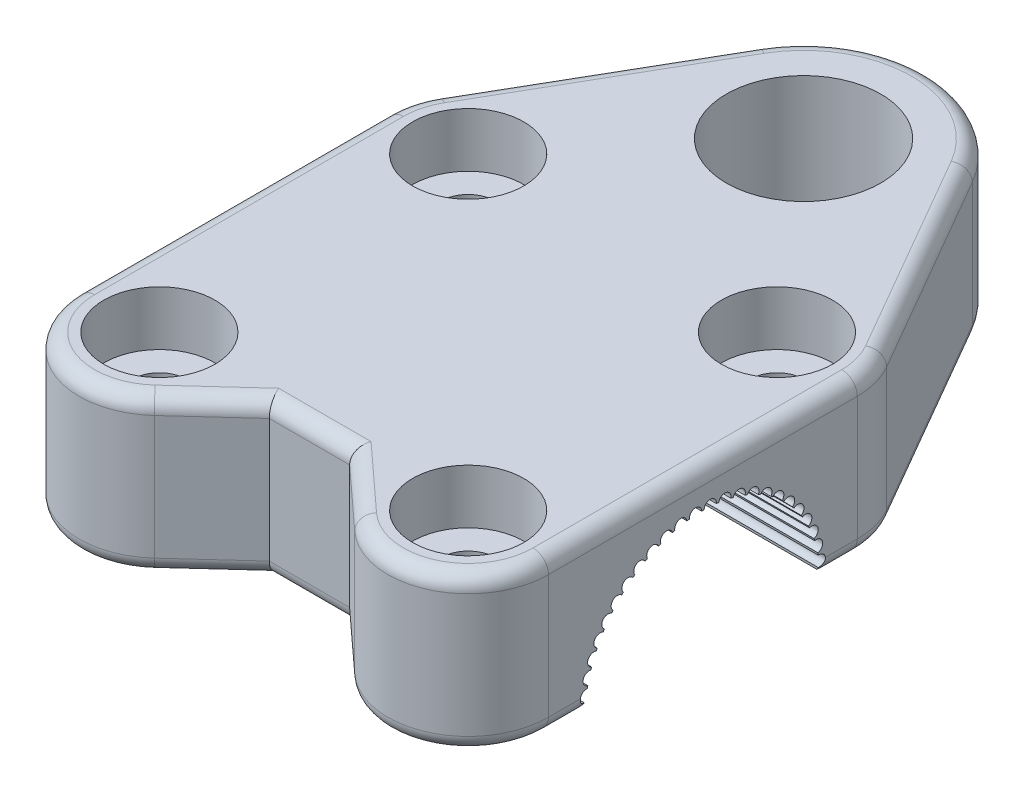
ISO-10303-21;
HEADER;
FILE_DESCRIPTION(('STEP AP214'),'2;1');
FILE_NAME('part.step','',(''),(''),'','','');
FILE_SCHEMA(('AUTOMOTIVE_DESIGN { 1 0 10303 214 1 1 1 1 }'));
ENDSEC;
DATA;
#1=APPLICATION_CONTEXT('core data for automotive mechanical design processes');
#2=APPLICATION_PROTOCOL_DEFINITION('international standard','automotive_design',2000,#1);
#3=PRODUCT_CONTEXT('',#1,'mechanical');
#4=PRODUCT('Part','Part','',(#3));
#5=PRODUCT_RELATED_PRODUCT_CATEGORY('part','',(#4));
#6=PRODUCT_DEFINITION_FORMATION('','',#4);
#7=PRODUCT_DEFINITION_CONTEXT('part definition',#1,'design');
#8=PRODUCT_DEFINITION('design','',#6,#7);
#9=PRODUCT_DEFINITION_SHAPE('','',#8);
#10=(LENGTH_UNIT() NAMED_UNIT(*) SI_UNIT(.MILLI.,.METRE.));
#11=(NAMED_UNIT(*) PLANE_ANGLE_UNIT() SI_UNIT($,.RADIAN.));
#12=(NAMED_UNIT(*) SI_UNIT($,.STERADIAN.) SOLID_ANGLE_UNIT());
#13=UNCERTAINTY_MEASURE_WITH_UNIT(LENGTH_MEASURE(1.E-05),#10,'distance_accuracy_value','');
#14=(GEOMETRIC_REPRESENTATION_CONTEXT(3) GLOBAL_UNCERTAINTY_ASSIGNED_CONTEXT((#13)) GLOBAL_UNIT_ASSIGNED_CONTEXT((#10,
#11,#12)) REPRESENTATION_CONTEXT('',''));
#15=CARTESIAN_POINT('',(0.,0.,0.));
#16=DIRECTION('',(0.,0.,1.));
#17=DIRECTION('',(1.,0.,0.));
#18=AXIS2_PLACEMENT_3D('',#15,#16,#17);
#19=CARTESIAN_POINT('',(-38.,0.,-25.6987298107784));
#20=DIRECTION('',(1.,0.,0.));
#21=DIRECTION('',(0.,0.,-1.));
#22=AXIS2_PLACEMENT_3D('',#19,#20,#21);
#23=CYLINDRICAL_SURFACE('',#22,19.);
#24=CARTESIAN_POINT('',(-38.,0.,-25.6987298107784));
#25=DIRECTION('',(1.,0.,0.));
#26=DIRECTION('',(0.,0.,-1.));
#27=AXIS2_PLACEMENT_3D('',#24,#25,#26);
#28=CIRCLE('',#27,19.);
#29=CARTESIAN_POINT('',(-38.0000000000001,15.2566781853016,-37.022764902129));
#30=VERTEX_POINT('',#29);
#31=CARTESIAN_POINT('',(-38.,15.4843702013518,-36.7093737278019));
#32=VERTEX_POINT('',#31);
#33=EDGE_CURVE('E1309',#30,#32,#28,.T.);
#34=ORIENTED_EDGE('',*,*,#33,.F.);
#35=DIRECTION('',(1.,0.,0.));
#36=VECTOR('',#35,1.);
#37=CARTESIAN_POINT('',(0.,15.2566781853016,-37.022764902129));
#38=LINE('',#37,#36);
#39=CARTESIAN_POINT('',(38.,15.2566781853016,-37.022764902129));
#40=VERTEX_POINT('',#39);
#41=EDGE_CURVE('E965',#30,#40,#38,.T.);
#42=ORIENTED_EDGE('',*,*,#41,.T.);
#43=CARTESIAN_POINT('',(38.,0.,-25.6987298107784));
#44=DIRECTION('',(1.,0.,0.));
#45=DIRECTION('',(0.,0.,-1.));
#46=AXIS2_PLACEMENT_3D('',#43,#44,#45);
#47=CIRCLE('',#46,19.);
#48=CARTESIAN_POINT('',(38.,15.4843702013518,-36.7093737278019));
#49=VERTEX_POINT('',#48);
#50=EDGE_CURVE('E2664',#40,#49,#47,.T.);
#51=ORIENTED_EDGE('',*,*,#50,.T.);
#52=DIRECTION('',(1.,0.,0.));
#53=VECTOR('',#52,1.);
#54=CARTESIAN_POINT('',(0.,15.4843702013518,-36.7093737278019));
#55=LINE('',#54,#53);
#56=EDGE_CURVE('E945',#49,#32,#55,.F.);
#57=ORIENTED_EDGE('',*,*,#56,.T.);
#58=EDGE_LOOP('',(#34,#42,#51,#57));
#59=FACE_BOUND('',#58,.T.);
#60=ADVANCED_FACE('F39',(#59),#23,.F.);
#61=CARTESIAN_POINT('',(38.,13.717096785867,-38.8456403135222));
#62=VERTEX_POINT('',#61);
#63=CARTESIAN_POINT('',(38.,13.9822717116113,-38.5632576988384));
#64=VERTEX_POINT('',#63);
#65=EDGE_CURVE('E2662',#62,#64,#47,.T.);
#66=ORIENTED_EDGE('',*,*,#65,.T.);
#67=DIRECTION('',(1.,0.,0.));
#68=VECTOR('',#67,1.);
#69=CARTESIAN_POINT('',(0.,13.9822717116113,-38.5632576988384));
#70=LINE('',#69,#68);
#71=CARTESIAN_POINT('',(-38.,13.9822717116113,-38.5632576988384));
#72=VERTEX_POINT('',#71);
#73=EDGE_CURVE('E961',#64,#72,#70,.F.);
#74=ORIENTED_EDGE('',*,*,#73,.T.);
#75=CARTESIAN_POINT('',(-38.0000000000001,13.717096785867,-38.8456403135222));
#76=VERTEX_POINT('',#75);
#77=EDGE_CURVE('E1313',#76,#72,#28,.T.);
#78=ORIENTED_EDGE('',*,*,#77,.F.);
#79=DIRECTION('',(1.,0.,0.));
#80=VECTOR('',#79,1.);
#81=CARTESIAN_POINT('',(0.,13.717096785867,-38.8456403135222));
#82=LINE('',#81,#80);
#83=EDGE_CURVE('E957',#76,#62,#82,.T.);
#84=ORIENTED_EDGE('',*,*,#83,.T.);
#85=EDGE_LOOP('',(#66,#74,#78,#84));
#86=FACE_BOUND('',#85,.T.);
#87=ADVANCED_FACE('F1300',(#86),#23,.F.);
#88=CARTESIAN_POINT('',(-38.,16.5556526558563,-35.0213026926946));
#89=VERTEX_POINT('',#88);
#90=CARTESIAN_POINT('',(-38.,16.7422709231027,-34.6818453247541));
#91=VERTEX_POINT('',#90);
#92=EDGE_CURVE('E1314',#89,#91,#28,.T.);
#93=ORIENTED_EDGE('',*,*,#92,.F.);
#94=DIRECTION('',(1.,0.,0.));
#95=VECTOR('',#94,1.);
#96=CARTESIAN_POINT('',(0.,16.5556526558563,-35.0213026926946));
#97=LINE('',#96,#95);
#98=CARTESIAN_POINT('',(38.,16.5556526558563,-35.0213026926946));
#99=VERTEX_POINT('',#98);
#100=EDGE_CURVE('E949',#89,#99,#97,.T.);
#101=ORIENTED_EDGE('',*,*,#100,.T.);
#102=CARTESIAN_POINT('',(38.,16.7422709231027,-34.6818453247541));
#103=VERTEX_POINT('',#102);
#104=EDGE_CURVE('E2668',#99,#103,#47,.T.);
#105=ORIENTED_EDGE('',*,*,#104,.T.);
#106=DIRECTION('',(1.,0.,0.));
#107=VECTOR('',#106,1.);
#108=CARTESIAN_POINT('',(0.,16.7422709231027,-34.6818453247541));
#109=LINE('',#108,#107);
#110=EDGE_CURVE('E937',#103,#91,#109,.F.);
#111=ORIENTED_EDGE('',*,*,#110,.T.);
#112=EDGE_LOOP('',(#93,#101,#105,#111));
#113=FACE_BOUND('',#112,.T.);
#114=ADVANCED_FACE('F1305',(#113),#23,.F.);
#115=CARTESIAN_POINT('',(-38.,17.5935345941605,-32.8728179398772));
#116=VERTEX_POINT('',#115);
#117=CARTESIAN_POINT('',(-38.,17.7361360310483,-32.5126478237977));
#118=VERTEX_POINT('',#117);
#119=EDGE_CURVE('E1320',#116,#118,#28,.T.);
#120=ORIENTED_EDGE('',*,*,#119,.F.);
#121=DIRECTION('',(1.,0.,0.));
#122=VECTOR('',#121,1.);
#123=CARTESIAN_POINT('',(0.,17.5935345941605,-32.8728179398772));
#124=LINE('',#123,#122);
#125=CARTESIAN_POINT('',(38.,17.5935345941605,-32.8728179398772));
#126=VERTEX_POINT('',#125);
#127=EDGE_CURVE('E941',#116,#126,#124,.T.);
#128=ORIENTED_EDGE('',*,*,#127,.T.);
#129=CARTESIAN_POINT('',(38.,17.7361360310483,-32.5126478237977));
#130=VERTEX_POINT('',#129);
#131=EDGE_CURVE('E2671',#126,#130,#47,.T.);
#132=ORIENTED_EDGE('',*,*,#131,.T.);
#133=DIRECTION('',(1.,0.,0.));
#134=VECTOR('',#133,1.);
#135=CARTESIAN_POINT('',(0.,17.7361360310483,-32.5126478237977));
#136=LINE('',#135,#134);
#137=EDGE_CURVE('E898',#130,#118,#136,.F.);
#138=ORIENTED_EDGE('',*,*,#137,.T.);
#139=EDGE_LOOP('',(#120,#128,#132,#138));
#140=FACE_BOUND('',#139,.T.);
#141=ADVANCED_FACE('F1756',(#140),#23,.F.);
#142=CARTESIAN_POINT('',(38.,11.9611885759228,-40.4611810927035));
#143=VERTEX_POINT('',#142);
#144=CARTESIAN_POINT('',(38.,12.2596644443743,-40.2142603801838));
#145=VERTEX_POINT('',#144);
#146=EDGE_CURVE('E2656',#143,#145,#47,.T.);
#147=ORIENTED_EDGE('',*,*,#146,.T.);
#148=DIRECTION('',(1.,0.,0.));
#149=VECTOR('',#148,1.);
#150=CARTESIAN_POINT('',(0.,12.2596644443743,-40.2142603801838));
#151=LINE('',#150,#149);
#152=CARTESIAN_POINT('',(-38.,12.2596644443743,-40.2142603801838));
#153=VERTEX_POINT('',#152);
#154=EDGE_CURVE('E953',#145,#153,#151,.F.);
#155=ORIENTED_EDGE('',*,*,#154,.T.);
#156=CARTESIAN_POINT('',(-38.0000000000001,11.9611885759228,-40.4611810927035));
#157=VERTEX_POINT('',#156);
#158=EDGE_CURVE('E1318',#157,#153,#28,.T.);
#159=ORIENTED_EDGE('',*,*,#158,.F.);
#160=DIRECTION('',(1.,0.,0.));
#161=VECTOR('',#160,1.);
#162=CARTESIAN_POINT('',(0.,11.9611885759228,-40.4611810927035));
#163=LINE('',#162,#161);
#164=EDGE_CURVE('E933',#157,#143,#163,.T.);
#165=ORIENTED_EDGE('',*,*,#164,.T.);
#166=EDGE_LOOP('',(#147,#155,#159,#165));
#167=FACE_BOUND('',#166,.T.);
#168=ADVANCED_FACE('F1764',(#167),#23,.F.);
#169=CARTESIAN_POINT('',(38.,10.0166452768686,-41.8439091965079));
#170=VERTEX_POINT('',#169);
#171=CARTESIAN_POINT('',(38.,10.3437149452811,-41.636344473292));
#172=VERTEX_POINT('',#171);
#173=EDGE_CURVE('E2667',#170,#172,#47,.T.);
#174=ORIENTED_EDGE('',*,*,#173,.T.);
#175=DIRECTION('',(1.,0.,0.));
#176=VECTOR('',#175,1.);
#177=CARTESIAN_POINT('',(0.,10.3437149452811,-41.636344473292));
#178=LINE('',#177,#176);
#179=CARTESIAN_POINT('',(-38.,10.3437149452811,-41.636344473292));
#180=VERTEX_POINT('',#179);
#181=EDGE_CURVE('E929',#172,#180,#178,.F.);
#182=ORIENTED_EDGE('',*,*,#181,.T.);
#183=CARTESIAN_POINT('',(-38.0000000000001,10.0166452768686,-41.8439091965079));
#184=VERTEX_POINT('',#183);
#185=EDGE_CURVE('E2648',#184,#180,#28,.T.);
#186=ORIENTED_EDGE('',*,*,#185,.F.);
#187=DIRECTION('',(1.,0.,0.));
#188=VECTOR('',#187,1.);
#189=CARTESIAN_POINT('',(0.,10.0166452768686,-41.8439091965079));
#190=LINE('',#189,#188);
#191=EDGE_CURVE('E925',#184,#170,#190,.T.);
#192=ORIENTED_EDGE('',*,*,#191,.T.);
#193=EDGE_LOOP('',(#174,#182,#186,#192));
#194=FACE_BOUND('',#193,.T.);
#195=ADVANCED_FACE('F1772',(#194),#23,.F.);
#196=CARTESIAN_POINT('',(38.,7.91413349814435,-42.9720181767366));
#197=VERTEX_POINT('',#196);
#198=CARTESIAN_POINT('',(38.,8.26463888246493,-42.8070828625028));
#199=VERTEX_POINT('',#198);
#200=EDGE_CURVE('E573',#197,#199,#47,.T.);
#201=ORIENTED_EDGE('',*,*,#200,.T.);
#202=DIRECTION('',(1.,0.,0.));
#203=VECTOR('',#202,1.);
#204=CARTESIAN_POINT('',(0.,8.26463888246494,-42.8070828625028));
#205=LINE('',#204,#203);
#206=CARTESIAN_POINT('',(-38.,8.26463888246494,-42.8070828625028));
#207=VERTEX_POINT('',#206);
#208=EDGE_CURVE('E921',#199,#207,#205,.F.);
#209=ORIENTED_EDGE('',*,*,#208,.T.);
#210=CARTESIAN_POINT('',(-38.0000000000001,7.91413349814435,-42.9720181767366));
#211=VERTEX_POINT('',#210);
#212=EDGE_CURVE('E2645',#211,#207,#28,.T.);
#213=ORIENTED_EDGE('',*,*,#212,.F.);
#214=DIRECTION('',(1.,0.,0.));
#215=VECTOR('',#214,1.);
#216=CARTESIAN_POINT('',(0.,7.91413349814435,-42.9720181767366));
#217=LINE('',#216,#215);
#218=EDGE_CURVE('E917',#211,#197,#217,.T.);
#219=ORIENTED_EDGE('',*,*,#218,.T.);
#220=EDGE_LOOP('',(#201,#209,#213,#219));
#221=FACE_BOUND('',#220,.T.);
#222=ADVANCED_FACE('F1780',(#221),#23,.F.);
#223=CARTESIAN_POINT('',(38.,5.68681110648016,-43.8277170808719));
#224=VERTEX_POINT('',#223);
#225=CARTESIAN_POINT('',(38.,6.05522452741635,-43.7080123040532));
#226=VERTEX_POINT('',#225);
#227=EDGE_CURVE('E564',#224,#226,#47,.T.);
#228=ORIENTED_EDGE('',*,*,#227,.T.);
#229=DIRECTION('',(1.,0.,0.));
#230=VECTOR('',#229,1.);
#231=CARTESIAN_POINT('',(0.,6.05522452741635,-43.7080123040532));
#232=LINE('',#231,#230);
#233=CARTESIAN_POINT('',(-38.,6.05522452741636,-43.7080123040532));
#234=VERTEX_POINT('',#233);
#235=EDGE_CURVE('E913',#226,#234,#232,.F.);
#236=ORIENTED_EDGE('',*,*,#235,.T.);
#237=CARTESIAN_POINT('',(-38.0000000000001,5.68681110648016,-43.8277170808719));
#238=VERTEX_POINT('',#237);
#239=EDGE_CURVE('E2642',#238,#234,#28,.T.);
#240=ORIENTED_EDGE('',*,*,#239,.F.);
#241=DIRECTION('',(1.,0.,0.));
#242=VECTOR('',#241,1.);
#243=CARTESIAN_POINT('',(0.,5.68681110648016,-43.8277170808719));
#244=LINE('',#243,#242);
#245=EDGE_CURVE('E909',#238,#224,#244,.T.);
#246=ORIENTED_EDGE('',*,*,#245,.T.);
#247=EDGE_LOOP('',(#228,#236,#240,#246));
#248=FACE_BOUND('',#247,.T.);
#249=ADVANCED_FACE('F1788',(#248),#23,.F.);
#250=CARTESIAN_POINT('',(-38.,18.3539559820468,-30.6111935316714));
#251=VERTEX_POINT('',#250);
#252=CARTESIAN_POINT('',(-38.,18.4502916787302,-30.2359907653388));
#253=VERTEX_POINT('',#252);
#254=EDGE_CURVE('E1324',#251,#253,#28,.T.);
#255=ORIENTED_EDGE('',*,*,#254,.F.);
#256=DIRECTION('',(1.,0.,0.));
#257=VECTOR('',#256,1.);
#258=CARTESIAN_POINT('',(0.,18.3539559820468,-30.6111935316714));
#259=LINE('',#258,#257);
#260=CARTESIAN_POINT('',(38.,18.3539559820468,-30.6111935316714));
#261=VERTEX_POINT('',#260);
#262=EDGE_CURVE('E902',#251,#261,#259,.T.);
#263=ORIENTED_EDGE('',*,*,#262,.T.);
#264=CARTESIAN_POINT('',(38.,18.4502916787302,-30.2359907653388));
#265=VERTEX_POINT('',#264);
#266=EDGE_CURVE('E2675',#261,#265,#47,.T.);
#267=ORIENTED_EDGE('',*,*,#266,.T.);
#268=DIRECTION('',(1.,0.,0.));
#269=VECTOR('',#268,1.);
#270=CARTESIAN_POINT('',(0.,18.4502916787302,-30.2359907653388));
#271=LINE('',#270,#269);
#272=EDGE_CURVE('E890',#265,#253,#271,.F.);
#273=ORIENTED_EDGE('',*,*,#272,.T.);
#274=EDGE_LOOP('',(#255,#263,#267,#273));
#275=FACE_BOUND('',#274,.T.);
#276=ADVANCED_FACE('F1796',(#275),#23,.F.);
#277=CARTESIAN_POINT('',(-38.,18.8249245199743,-28.2720966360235));
#278=VERTEX_POINT('',#277);
#279=CARTESIAN_POINT('',(-38.,18.8734752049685,-27.887778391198));
#280=VERTEX_POINT('',#279);
#281=EDGE_CURVE('E1328',#278,#280,#28,.T.);
#282=ORIENTED_EDGE('',*,*,#281,.F.);
#283=DIRECTION('',(1.,0.,0.));
#284=VECTOR('',#283,1.);
#285=CARTESIAN_POINT('',(0.,18.8249245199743,-28.2720966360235));
#286=LINE('',#285,#284);
#287=CARTESIAN_POINT('',(38.,18.8249245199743,-28.2720966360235));
#288=VERTEX_POINT('',#287);
#289=EDGE_CURVE('E894',#278,#288,#286,.T.);
#290=ORIENTED_EDGE('',*,*,#289,.T.);
#291=CARTESIAN_POINT('',(38.,18.8734752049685,-27.8877783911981));
#292=VERTEX_POINT('',#291);
#293=EDGE_CURVE('E2679',#288,#292,#47,.T.);
#294=ORIENTED_EDGE('',*,*,#293,.T.);
#295=DIRECTION('',(1.,0.,0.));
#296=VECTOR('',#295,1.);
#297=CARTESIAN_POINT('',(0.,18.8734752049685,-27.8877783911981));
#298=LINE('',#297,#296);
#299=EDGE_CURVE('E882',#292,#280,#298,.F.);
#300=ORIENTED_EDGE('',*,*,#299,.T.);
#301=EDGE_LOOP('',(#282,#290,#294,#300));
#302=FACE_BOUND('',#301,.T.);
#303=ADVANCED_FACE('F1804',(#302),#23,.F.);
#304=CARTESIAN_POINT('',(-38.,18.9990127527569,-25.8924162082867));
#305=VERTEX_POINT('',#304);
#306=CARTESIAN_POINT('',(-38.,18.9990127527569,-25.5050434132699));
#307=VERTEX_POINT('',#306);
#308=EDGE_CURVE('E1332',#305,#307,#28,.T.);
#309=ORIENTED_EDGE('',*,*,#308,.F.);
#310=DIRECTION('',(1.,0.,0.));
#311=VECTOR('',#310,1.);
#312=CARTESIAN_POINT('',(0.,18.9990127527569,-25.8924162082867));
#313=LINE('',#312,#311);
#314=CARTESIAN_POINT('',(38.,18.9990127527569,-25.8924162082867));
#315=VERTEX_POINT('',#314);
#316=EDGE_CURVE('E886',#305,#315,#313,.T.);
#317=ORIENTED_EDGE('',*,*,#316,.T.);
#318=CARTESIAN_POINT('',(38.,18.9990127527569,-25.5050434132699));
#319=VERTEX_POINT('',#318);
#320=EDGE_CURVE('E2683',#315,#319,#47,.T.);
#321=ORIENTED_EDGE('',*,*,#320,.T.);
#322=DIRECTION('',(1.,0.,0.));
#323=VECTOR('',#322,1.);
#324=CARTESIAN_POINT('',(0.,18.9990127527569,-25.5050434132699));
#325=LINE('',#324,#323);
#326=EDGE_CURVE('E874',#319,#307,#325,.F.);
#327=ORIENTED_EDGE('',*,*,#326,.T.);
#328=EDGE_LOOP('',(#309,#317,#321,#327));
#329=FACE_BOUND('',#328,.T.);
#330=ADVANCED_FACE('F1812',(#329),#23,.F.);
#331=CARTESIAN_POINT('',(-38.,18.8734752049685,-23.5096812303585));
#332=VERTEX_POINT('',#331);
#333=CARTESIAN_POINT('',(-38.,18.8249245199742,-23.1253629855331));
#334=VERTEX_POINT('',#333);
#335=EDGE_CURVE('E1336',#332,#334,#28,.T.);
#336=ORIENTED_EDGE('',*,*,#335,.F.);
#337=DIRECTION('',(1.,0.,0.));
#338=VECTOR('',#337,1.);
#339=CARTESIAN_POINT('',(0.,18.8734752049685,-23.5096812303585));
#340=LINE('',#339,#338);
#341=CARTESIAN_POINT('',(38.,18.8734752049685,-23.5096812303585));
#342=VERTEX_POINT('',#341);
#343=EDGE_CURVE('E878',#332,#342,#340,.T.);
#344=ORIENTED_EDGE('',*,*,#343,.T.);
#345=CARTESIAN_POINT('',(38.,18.8249245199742,-23.1253629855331));
#346=VERTEX_POINT('',#345);
#347=EDGE_CURVE('E2687',#342,#346,#47,.T.);
#348=ORIENTED_EDGE('',*,*,#347,.T.);
#349=DIRECTION('',(1.,0.,0.));
#350=VECTOR('',#349,1.);
#351=CARTESIAN_POINT('',(0.,18.8249245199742,-23.1253629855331));
#352=LINE('',#351,#350);
#353=EDGE_CURVE('E866',#346,#334,#352,.F.);
#354=ORIENTED_EDGE('',*,*,#353,.T.);
#355=EDGE_LOOP('',(#336,#344,#348,#354));
#356=FACE_BOUND('',#355,.T.);
#357=ADVANCED_FACE('F1820',(#356),#23,.F.);
#358=CARTESIAN_POINT('',(-38.,18.4502916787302,-21.1614688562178));
#359=VERTEX_POINT('',#358);
#360=CARTESIAN_POINT('',(-38.,18.3539559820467,-20.7862660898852));
#361=VERTEX_POINT('',#360);
#362=EDGE_CURVE('E1340',#359,#361,#28,.T.);
#363=ORIENTED_EDGE('',*,*,#362,.F.);
#364=DIRECTION('',(1.,0.,0.));
#365=VECTOR('',#364,1.);
#366=CARTESIAN_POINT('',(0.,18.4502916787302,-21.1614688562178));
#367=LINE('',#366,#365);
#368=CARTESIAN_POINT('',(38.,18.4502916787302,-21.1614688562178));
#369=VERTEX_POINT('',#368);
#370=EDGE_CURVE('E870',#359,#369,#367,.T.);
#371=ORIENTED_EDGE('',*,*,#370,.T.);
#372=CARTESIAN_POINT('',(38.,18.3539559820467,-20.7862660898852));
#373=VERTEX_POINT('',#372);
#374=EDGE_CURVE('E2691',#369,#373,#47,.T.);
#375=ORIENTED_EDGE('',*,*,#374,.T.);
#376=DIRECTION('',(1.,0.,0.));
#377=VECTOR('',#376,1.);
#378=CARTESIAN_POINT('',(0.,18.3539559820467,-20.7862660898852));
#379=LINE('',#378,#377);
#380=EDGE_CURVE('E858',#373,#361,#379,.F.);
#381=ORIENTED_EDGE('',*,*,#380,.T.);
#382=EDGE_LOOP('',(#363,#371,#375,#381));
#383=FACE_BOUND('',#382,.T.);
#384=ADVANCED_FACE('F1828',(#383),#23,.F.);
#385=CARTESIAN_POINT('',(-38.,17.7361360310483,-18.8848117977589));
#386=VERTEX_POINT('',#385);
#387=CARTESIAN_POINT('',(-38.,17.5935345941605,-18.5246416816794));
#388=VERTEX_POINT('',#387);
#389=EDGE_CURVE('E1344',#386,#388,#28,.T.);
#390=ORIENTED_EDGE('',*,*,#389,.F.);
#391=DIRECTION('',(1.,0.,0.));
#392=VECTOR('',#391,1.);
#393=CARTESIAN_POINT('',(0.,17.7361360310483,-18.8848117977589));
#394=LINE('',#393,#392);
#395=CARTESIAN_POINT('',(38.,17.7361360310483,-18.8848117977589));
#396=VERTEX_POINT('',#395);
#397=EDGE_CURVE('E862',#386,#396,#394,.T.);
#398=ORIENTED_EDGE('',*,*,#397,.T.);
#399=CARTESIAN_POINT('',(38.,17.5935345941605,-18.5246416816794));
#400=VERTEX_POINT('',#399);
#401=EDGE_CURVE('E2695',#396,#400,#47,.T.);
#402=ORIENTED_EDGE('',*,*,#401,.T.);
#403=DIRECTION('',(1.,0.,0.));
#404=VECTOR('',#403,1.);
#405=CARTESIAN_POINT('',(0.,17.5935345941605,-18.5246416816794));
#406=LINE('',#405,#404);
#407=EDGE_CURVE('E850',#400,#388,#406,.F.);
#408=ORIENTED_EDGE('',*,*,#407,.T.);
#409=EDGE_LOOP('',(#390,#398,#402,#408));
#410=FACE_BOUND('',#409,.T.);
#411=ADVANCED_FACE('F1836',(#410),#23,.F.);
#412=CARTESIAN_POINT('',(-38.,16.7422709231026,-16.7156142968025));
#413=VERTEX_POINT('',#412);
#414=CARTESIAN_POINT('',(-38.,16.5556526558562,-16.376156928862));
#415=VERTEX_POINT('',#414);
#416=EDGE_CURVE('E1348',#413,#415,#28,.T.);
#417=ORIENTED_EDGE('',*,*,#416,.F.);
#418=DIRECTION('',(1.,0.,0.));
#419=VECTOR('',#418,1.);
#420=CARTESIAN_POINT('',(0.,16.7422709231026,-16.7156142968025));
#421=LINE('',#420,#419);
#422=CARTESIAN_POINT('',(38.,16.7422709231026,-16.7156142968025));
#423=VERTEX_POINT('',#422);
#424=EDGE_CURVE('E854',#413,#423,#421,.T.);
#425=ORIENTED_EDGE('',*,*,#424,.T.);
#426=CARTESIAN_POINT('',(38.,16.5556526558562,-16.3761569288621));
#427=VERTEX_POINT('',#426);
#428=EDGE_CURVE('E2699',#423,#427,#47,.T.);
#429=ORIENTED_EDGE('',*,*,#428,.T.);
#430=DIRECTION('',(1.,0.,0.));
#431=VECTOR('',#430,1.);
#432=CARTESIAN_POINT('',(0.,16.5556526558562,-16.376156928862));
#433=LINE('',#432,#431);
#434=EDGE_CURVE('E842',#427,#415,#433,.F.);
#435=ORIENTED_EDGE('',*,*,#434,.T.);
#436=EDGE_LOOP('',(#417,#425,#429,#435));
#437=FACE_BOUND('',#436,.T.);
#438=ADVANCED_FACE('F1844',(#437),#23,.F.);
#439=CARTESIAN_POINT('',(-38.,15.4843702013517,-14.6880858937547));
#440=VERTEX_POINT('',#439);
#441=CARTESIAN_POINT('',(-38.,15.2566781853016,-14.3746947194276));
#442=VERTEX_POINT('',#441);
#443=EDGE_CURVE('E1352',#440,#442,#28,.T.);
#444=ORIENTED_EDGE('',*,*,#443,.F.);
#445=DIRECTION('',(1.,0.,0.));
#446=VECTOR('',#445,1.);
#447=CARTESIAN_POINT('',(0.,15.4843702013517,-14.6880858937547));
#448=LINE('',#447,#446);
#449=CARTESIAN_POINT('',(38.,15.4843702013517,-14.6880858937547));
#450=VERTEX_POINT('',#449);
#451=EDGE_CURVE('E846',#440,#450,#448,.T.);
#452=ORIENTED_EDGE('',*,*,#451,.T.);
#453=CARTESIAN_POINT('',(38.,15.2566781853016,-14.3746947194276));
#454=VERTEX_POINT('',#453);
#455=EDGE_CURVE('E1378',#450,#454,#47,.T.);
#456=ORIENTED_EDGE('',*,*,#455,.T.);
#457=DIRECTION('',(1.,0.,0.));
#458=VECTOR('',#457,1.);
#459=CARTESIAN_POINT('',(0.,15.2566781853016,-14.3746947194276));
#460=LINE('',#459,#458);
#461=EDGE_CURVE('E823',#454,#442,#460,.F.);
#462=ORIENTED_EDGE('',*,*,#461,.T.);
#463=EDGE_LOOP('',(#444,#452,#456,#462));
#464=FACE_BOUND('',#463,.T.);
#465=ADVANCED_FACE('F1852',(#464),#23,.F.);
#466=CARTESIAN_POINT('',(-38.,8.26463888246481,-8.59037675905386));
#467=VERTEX_POINT('',#466);
#468=CARTESIAN_POINT('',(-38.,7.91413349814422,-8.42544144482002));
#469=VERTEX_POINT('',#468);
#470=EDGE_CURVE('E778',#467,#469,#28,.T.);
#471=ORIENTED_EDGE('',*,*,#470,.F.);
#472=DIRECTION('',(1.,0.,0.));
#473=VECTOR('',#472,1.);
#474=CARTESIAN_POINT('',(0.,8.26463888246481,-8.59037675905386));
#475=LINE('',#474,#473);
#476=CARTESIAN_POINT('',(38.,8.26463888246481,-8.59037675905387));
#477=VERTEX_POINT('',#476);
#478=EDGE_CURVE('E838',#467,#477,#475,.T.);
#479=ORIENTED_EDGE('',*,*,#478,.T.);
#480=CARTESIAN_POINT('',(38.,7.91413349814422,-8.42544144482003));
#481=VERTEX_POINT('',#480);
#482=EDGE_CURVE('E586',#477,#481,#47,.T.);
#483=ORIENTED_EDGE('',*,*,#482,.T.);
#484=DIRECTION('',(1.,0.,0.));
#485=VECTOR('',#484,1.);
#486=CARTESIAN_POINT('',(0.,7.91413349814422,-8.42544144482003));
#487=LINE('',#486,#485);
#488=EDGE_CURVE('E803',#481,#469,#487,.F.);
#489=ORIENTED_EDGE('',*,*,#488,.T.);
#490=EDGE_LOOP('',(#471,#479,#483,#489));
#491=FACE_BOUND('',#490,.T.);
#492=ADVANCED_FACE('F1383',(#491),#23,.F.);
#493=CARTESIAN_POINT('',(38.,10.343714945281,-9.76111514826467));
#494=VERTEX_POINT('',#493);
#495=CARTESIAN_POINT('',(38.,10.0166452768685,-9.55355042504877));
#496=VERTEX_POINT('',#495);
#497=EDGE_CURVE('E1375',#494,#496,#47,.T.);
#498=ORIENTED_EDGE('',*,*,#497,.T.);
#499=DIRECTION('',(1.,0.,0.));
#500=VECTOR('',#499,1.);
#501=CARTESIAN_POINT('',(0.,10.0166452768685,-9.55355042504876));
#502=LINE('',#501,#500);
#503=CARTESIAN_POINT('',(-38.,10.0166452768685,-9.55355042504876));
#504=VERTEX_POINT('',#503);
#505=EDGE_CURVE('E776',#496,#504,#502,.F.);
#506=ORIENTED_EDGE('',*,*,#505,.T.);
#507=CARTESIAN_POINT('',(-38.,10.343714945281,-9.76111514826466));
#508=VERTEX_POINT('',#507);
#509=EDGE_CURVE('E764',#508,#504,#28,.T.);
#510=ORIENTED_EDGE('',*,*,#509,.F.);
#511=DIRECTION('',(1.,0.,0.));
#512=VECTOR('',#511,1.);
#513=CARTESIAN_POINT('',(0.,10.343714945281,-9.76111514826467));
#514=LINE('',#513,#512);
#515=EDGE_CURVE('E774',#508,#494,#514,.T.);
#516=ORIENTED_EDGE('',*,*,#515,.T.);
#517=EDGE_LOOP('',(#498,#506,#510,#516));
#518=FACE_BOUND('',#517,.T.);
#519=ADVANCED_FACE('F773',(#518),#23,.F.);
#520=CARTESIAN_POINT('',(-38.,13.9822717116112,-12.8342019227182));
#521=VERTEX_POINT('',#520);
#522=CARTESIAN_POINT('',(-38.,13.7170967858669,-12.5518193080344));
#523=VERTEX_POINT('',#522);
#524=EDGE_CURVE('E781',#521,#523,#28,.T.);
#525=ORIENTED_EDGE('',*,*,#524,.F.);
#526=DIRECTION('',(1.,0.,0.));
#527=VECTOR('',#526,1.);
#528=CARTESIAN_POINT('',(0.,13.9822717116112,-12.8342019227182));
#529=LINE('',#528,#527);
#530=CARTESIAN_POINT('',(38.,13.9822717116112,-12.8342019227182));
#531=VERTEX_POINT('',#530);
#532=EDGE_CURVE('E827',#521,#531,#529,.T.);
#533=ORIENTED_EDGE('',*,*,#532,.T.);
#534=CARTESIAN_POINT('',(38.,13.7170967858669,-12.5518193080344));
#535=VERTEX_POINT('',#534);
#536=EDGE_CURVE('E1364',#531,#535,#47,.T.);
#537=ORIENTED_EDGE('',*,*,#536,.T.);
#538=DIRECTION('',(1.,0.,0.));
#539=VECTOR('',#538,1.);
#540=CARTESIAN_POINT('',(0.,13.7170967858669,-12.5518193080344));
#541=LINE('',#540,#539);
#542=EDGE_CURVE('E815',#535,#523,#541,.F.);
#543=ORIENTED_EDGE('',*,*,#542,.T.);
#544=EDGE_LOOP('',(#525,#533,#537,#543));
#545=FACE_BOUND('',#544,.T.);
#546=ADVANCED_FACE('F1361',(#545),#23,.F.);
#547=CARTESIAN_POINT('',(38.,12.2596644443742,-11.1831992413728));
#548=VERTEX_POINT('',#547);
#549=CARTESIAN_POINT('',(38.,11.9611885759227,-10.9362785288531));
#550=VERTEX_POINT('',#549);
#551=EDGE_CURVE('E1372',#548,#550,#47,.T.);
#552=ORIENTED_EDGE('',*,*,#551,.T.);
#553=DIRECTION('',(1.,0.,0.));
#554=VECTOR('',#553,1.);
#555=CARTESIAN_POINT('',(0.,11.9611885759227,-10.9362785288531));
#556=LINE('',#555,#554);
#557=CARTESIAN_POINT('',(-38.,11.9611885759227,-10.9362785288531));
#558=VERTEX_POINT('',#557);
#559=EDGE_CURVE('E831',#550,#558,#556,.F.);
#560=ORIENTED_EDGE('',*,*,#559,.T.);
#561=CARTESIAN_POINT('',(-38.,12.2596644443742,-11.1831992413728));
#562=VERTEX_POINT('',#561);
#563=EDGE_CURVE('E766',#562,#558,#28,.T.);
#564=ORIENTED_EDGE('',*,*,#563,.F.);
#565=DIRECTION('',(1.,0.,0.));
#566=VECTOR('',#565,1.);
#567=CARTESIAN_POINT('',(0.,12.2596644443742,-11.1831992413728));
#568=LINE('',#567,#566);
#569=EDGE_CURVE('E819',#562,#548,#568,.T.);
#570=ORIENTED_EDGE('',*,*,#569,.T.);
#571=EDGE_LOOP('',(#552,#560,#564,#570));
#572=FACE_BOUND('',#571,.T.);
#573=ADVANCED_FACE('F1879',(#572),#23,.F.);
#574=CARTESIAN_POINT('',(-38.,6.05522452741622,-7.68944731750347));
#575=VERTEX_POINT('',#574);
#576=CARTESIAN_POINT('',(-38.,5.68681110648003,-7.56974254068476));
#577=VERTEX_POINT('',#576);
#578=EDGE_CURVE('E570',#575,#577,#28,.T.);
#579=ORIENTED_EDGE('',*,*,#578,.F.);
#580=DIRECTION('',(1.,0.,0.));
#581=VECTOR('',#580,1.);
#582=CARTESIAN_POINT('',(0.,6.05522452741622,-7.68944731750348));
#583=LINE('',#582,#581);
#584=CARTESIAN_POINT('',(38.,6.05522452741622,-7.68944731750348));
#585=VERTEX_POINT('',#584);
#586=EDGE_CURVE('E792',#575,#585,#583,.T.);
#587=ORIENTED_EDGE('',*,*,#586,.T.);
#588=CARTESIAN_POINT('',(38.,5.68681110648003,-7.56974254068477));
#589=VERTEX_POINT('',#588);
#590=EDGE_CURVE('E577',#585,#589,#47,.T.);
#591=ORIENTED_EDGE('',*,*,#590,.T.);
#592=DIRECTION('',(1.,0.,0.));
#593=VECTOR('',#592,1.);
#594=CARTESIAN_POINT('',(0.,5.68681110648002,-7.56974254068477));
#595=LINE('',#594,#593);
#596=EDGE_CURVE('E794',#589,#577,#595,.F.);
#597=ORIENTED_EDGE('',*,*,#596,.T.);
#598=EDGE_LOOP('',(#579,#587,#591,#597));
#599=FACE_BOUND('',#598,.T.);
#600=ADVANCED_FACE('F791',(#599),#23,.F.);
#601=CARTESIAN_POINT('',(-38.,3.75031566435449,-7.07253501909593));
#602=VERTEX_POINT('',#601);
#603=CARTESIAN_POINT('',(-38.,3.36980430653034,-6.99994859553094));
#604=VERTEX_POINT('',#603);
#605=EDGE_CURVE('E563',#602,#604,#28,.T.);
#606=ORIENTED_EDGE('',*,*,#605,.F.);
#607=DIRECTION('',(1.,0.,0.));
#608=VECTOR('',#607,1.);
#609=CARTESIAN_POINT('',(0.,3.75031566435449,-7.07253501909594));
#610=LINE('',#609,#608);
#611=CARTESIAN_POINT('',(38.,3.75031566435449,-7.07253501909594));
#612=VERTEX_POINT('',#611);
#613=EDGE_CURVE('E798',#602,#612,#610,.T.);
#614=ORIENTED_EDGE('',*,*,#613,.T.);
#615=CARTESIAN_POINT('',(38.,3.36980430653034,-6.99994859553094));
#616=VERTEX_POINT('',#615);
#617=EDGE_CURVE('E566',#612,#616,#47,.T.);
#618=ORIENTED_EDGE('',*,*,#617,.T.);
#619=DIRECTION('',(1.,0.,0.));
#620=VECTOR('',#619,1.);
#621=CARTESIAN_POINT('',(0.,3.36980430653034,-6.99994859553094));
#622=LINE('',#621,#620);
#623=EDGE_CURVE('E806',#616,#604,#622,.F.);
#624=ORIENTED_EDGE('',*,*,#623,.T.);
#625=EDGE_LOOP('',(#606,#614,#618,#624));
#626=FACE_BOUND('',#625,.T.);
#627=ADVANCED_FACE('F1892',(#626),#23,.F.);
#628=DIRECTION('',(1.,0.,0.));
#629=VECTOR('',#628,1.);
#630=CARTESIAN_POINT('',(0.,0.999653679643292,-6.72504560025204));
#631=LINE('',#630,#629);
#632=CARTESIAN_POINT('',(37.4997402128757,0.999653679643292,-6.72504560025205));
#633=VERTEX_POINT('',#632);
#634=CARTESIAN_POINT('',(-37.4997402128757,0.999653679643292,-6.72504560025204));
#635=VERTEX_POINT('',#634);
#636=EDGE_CURVE('E554',#633,#635,#631,.F.);
#637=ORIENTED_EDGE('',*,*,#636,.T.);
#638=CARTESIAN_POINT('',(-37.4997402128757,0.999653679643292,-6.72504560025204));
#639=CARTESIAN_POINT('',(-37.5225260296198,1.0300227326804,-6.72664549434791));
#640=CARTESIAN_POINT('',(-37.5446164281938,1.06090819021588,-6.72834598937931));
#641=CARTESIAN_POINT('',(-37.5873183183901,1.12357848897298,-6.73195483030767));
#642=CARTESIAN_POINT('',(-37.6079328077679,1.15536131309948,-6.73386273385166));
#643=CARTESIAN_POINT('',(-37.6476905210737,1.2198205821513,-6.73789965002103));
#644=CARTESIAN_POINT('',(-37.666833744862,1.25249702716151,-6.74002866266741));
#645=CARTESIAN_POINT('',(-37.7036493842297,1.3187425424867,-6.74452119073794));
#646=CARTESIAN_POINT('',(-37.7213186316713,1.35231334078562,-6.74688518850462));
#647=CARTESIAN_POINT('',(-37.7382108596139,1.38626208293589,-6.74936893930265));
#648=B_SPLINE_CURVE_WITH_KNOTS('',3,(#638,#639,#640,#641,#642,#643,#644,#645,#646,#647),
.UNSPECIFIED.,.F.,.F.,(4,2,2,2,4),(0.,0.113991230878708,0.227743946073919,0.341496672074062,
0.455487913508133),.UNSPECIFIED.);
#649=CARTESIAN_POINT('',(-37.7382108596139,1.38626208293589,-6.74936893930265));
#650=VERTEX_POINT('',#649);
#651=EDGE_CURVE('E1163',#635,#650,#648,.T.);
#652=ORIENTED_EDGE('',*,*,#651,.T.);
#653=DIRECTION('',(1.,0.,0.));
#654=VECTOR('',#653,1.);
#655=CARTESIAN_POINT('',(0.,1.38626208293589,-6.74936893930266));
#656=LINE('',#655,#654);
#657=CARTESIAN_POINT('',(37.7382108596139,1.38626208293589,-6.74936893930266));
#658=VERTEX_POINT('',#657);
#659=EDGE_CURVE('E799',#650,#658,#656,.T.);
#660=ORIENTED_EDGE('',*,*,#659,.T.);
#661=CARTESIAN_POINT('',(37.7382108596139,1.38626208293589,-6.74936893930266));
#662=CARTESIAN_POINT('',(37.7213186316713,1.35231334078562,-6.74688518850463));
#663=CARTESIAN_POINT('',(37.7036493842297,1.3187425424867,-6.74452119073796));
#664=CARTESIAN_POINT('',(37.666833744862,1.25249702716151,-6.74002866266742));
#665=CARTESIAN_POINT('',(37.6476905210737,1.2198205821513,-6.73789965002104));
#666=CARTESIAN_POINT('',(37.6079328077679,1.15536131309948,-6.73386273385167));
#667=CARTESIAN_POINT('',(37.5873183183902,1.12357848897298,-6.73195483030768));
#668=CARTESIAN_POINT('',(37.5446164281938,1.06090819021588,-6.72834598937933));
#669=CARTESIAN_POINT('',(37.5225260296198,1.0300227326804,-6.72664549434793));
#670=CARTESIAN_POINT('',(37.4997402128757,0.999653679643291,-6.72504560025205));
#671=B_SPLINE_CURVE_WITH_KNOTS('',3,(#661,#662,#663,#664,#665,#666,#667,#668,#669,#670),
.UNSPECIFIED.,.F.,.F.,(4,2,2,2,4),(0.,0.113991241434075,0.227743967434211,0.341496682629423,
0.455487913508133),.UNSPECIFIED.);
#672=EDGE_CURVE('E1156',#658,#633,#671,.T.);
#673=ORIENTED_EDGE('',*,*,#672,.T.);
#674=EDGE_LOOP('',(#637,#652,#660,#673));
#675=FACE_BOUND('',#674,.T.);
#676=ADVANCED_FACE('F1899',(#675),#23,.F.);
#677=CARTESIAN_POINT('',(38.,3.36980430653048,-44.3975110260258));
#678=VERTEX_POINT('',#677);
#679=CARTESIAN_POINT('',(38.,3.75031566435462,-44.3249246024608));
#680=VERTEX_POINT('',#679);
#681=EDGE_CURVE('E550',#678,#680,#47,.T.);
#682=ORIENTED_EDGE('',*,*,#681,.T.);
#683=DIRECTION('',(1.,0.,0.));
#684=VECTOR('',#683,1.);
#685=CARTESIAN_POINT('',(0.,3.75031566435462,-44.3249246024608));
#686=LINE('',#685,#684);
#687=CARTESIAN_POINT('',(-38.,3.75031566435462,-44.3249246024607));
#688=VERTEX_POINT('',#687);
#689=EDGE_CURVE('E906',#680,#688,#686,.F.);
#690=ORIENTED_EDGE('',*,*,#689,.T.);
#691=CARTESIAN_POINT('',(-38.0000000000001,3.36980430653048,-44.3975110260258));
#692=VERTEX_POINT('',#691);
#693=EDGE_CURVE('E552',#692,#688,#28,.T.);
#694=ORIENTED_EDGE('',*,*,#693,.F.);
#695=DIRECTION('',(1.,0.,0.));
#696=VECTOR('',#695,1.);
#697=CARTESIAN_POINT('',(0.,3.36980430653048,-44.3975110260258));
#698=LINE('',#697,#696);
#699=EDGE_CURVE('E534',#692,#678,#698,.T.);
#700=ORIENTED_EDGE('',*,*,#699,.T.);
#701=EDGE_LOOP('',(#682,#690,#694,#700));
#702=FACE_BOUND('',#701,.T.);
#703=ADVANCED_FACE('F548',(#702),#23,.F.);
#704=CARTESIAN_POINT('',(25.,0.,-50.6987298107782));
#705=DIRECTION('',(0.,1.,0.));
#706=DIRECTION('',(0.,0.,1.));
#707=AXIS2_PLACEMENT_3D('',#704,#705,#706);
#708=PLANE('',#707);
#709=CARTESIAN_POINT('',(-25.,0.,-0.698729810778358));
#710=DIRECTION('',(0.,1.,0.));
#711=DIRECTION('',(0.,0.,1.));
#712=AXIS2_PLACEMENT_3D('',#709,#710,#711);
#713=CIRCLE('',#712,4.39999999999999);
#714=CARTESIAN_POINT('',(-25.,0.,3.70127018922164));
#715=VERTEX_POINT('',#714);
#716=EDGE_CURVE('E2229',#715,#715,#713,.T.);
#717=ORIENTED_EDGE('',*,*,#716,.T.);
#718=EDGE_LOOP('',(#717));
#719=FACE_BOUND('',#718,.T.);
#720=CARTESIAN_POINT('',(25.,0.,-0.698729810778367));
#721=DIRECTION('',(0.,1.,0.));
#722=DIRECTION('',(0.,0.,1.));
#723=AXIS2_PLACEMENT_3D('',#720,#721,#722);
#724=CIRCLE('',#723,4.39999999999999);
#725=CARTESIAN_POINT('',(25.,0.,3.70127018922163));
#726=VERTEX_POINT('',#725);
#727=EDGE_CURVE('E2567',#726,#726,#724,.T.);
#728=ORIENTED_EDGE('',*,*,#727,.T.);
#729=EDGE_LOOP('',(#728));
#730=FACE_BOUND('',#729,.T.);
#731=CARTESIAN_POINT('',(-25.,0.,-0.698729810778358));
#732=DIRECTION('',(0.,1.,0.));
#733=DIRECTION('',(0.,0.,1.));
#734=AXIS2_PLACEMENT_3D('',#731,#732,#733);
#735=CIRCLE('',#734,10.5);
#736=CARTESIAN_POINT('',(-17.9142843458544,0.,7.04998838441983));
#737=VERTEX_POINT('',#736);
#738=CARTESIAN_POINT('',(-35.5,0.,-0.698729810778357));
#739=VERTEX_POINT('',#738);
#740=EDGE_CURVE('E994',#737,#739,#735,.F.);
#741=ORIENTED_EDGE('',*,*,#740,.T.);
#742=DIRECTION('',(0.,0.,1.));
#743=VECTOR('',#742,1.);
#744=CARTESIAN_POINT('',(-35.5,0.,-50.6987298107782));
#745=LINE('',#744,#743);
#746=CARTESIAN_POINT('',(-35.5,0.,-5.69872981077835));
#747=VERTEX_POINT('',#746);
#748=EDGE_CURVE('E997',#739,#747,#745,.F.);
#749=ORIENTED_EDGE('',*,*,#748,.T.);
#750=DIRECTION('',(1.,0.,0.));
#751=VECTOR('',#750,1.);
#752=CARTESIAN_POINT('',(-38.,0.,-5.69872981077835));
#753=LINE('',#752,#751);
#754=CARTESIAN_POINT('',(35.5,0.,-5.69872981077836));
#755=VERTEX_POINT('',#754);
#756=EDGE_CURVE('E588',#747,#755,#753,.T.);
#757=ORIENTED_EDGE('',*,*,#756,.T.);
#758=DIRECTION('',(0.,0.,-1.));
#759=VECTOR('',#758,1.);
#760=CARTESIAN_POINT('',(35.5,0.,-50.6987298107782));
#761=LINE('',#760,#759);
#762=CARTESIAN_POINT('',(35.5,0.,-0.698729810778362));
#763=VERTEX_POINT('',#762);
#764=EDGE_CURVE('E982',#755,#763,#761,.F.);
#765=ORIENTED_EDGE('',*,*,#764,.T.);
#766=CARTESIAN_POINT('',(25.,0.,-0.698729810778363));
#767=DIRECTION('',(0.,1.,0.));
#768=DIRECTION('',(0.,0.,1.));
#769=AXIS2_PLACEMENT_3D('',#766,#767,#768);
#770=CIRCLE('',#769,10.5);
#771=CARTESIAN_POINT('',(17.9142843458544,0.,7.04998838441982));
#772=VERTEX_POINT('',#771);
#773=EDGE_CURVE('E979',#763,#772,#770,.F.);
#774=ORIENTED_EDGE('',*,*,#773,.T.);
#775=DIRECTION('',(0.737973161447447,0.,0.674830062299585));
#776=VECTOR('',#775,1.);
#777=CARTESIAN_POINT('',(-6.98603937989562,0.,-15.7197922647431));
#778=LINE('',#777,#776);
#779=CARTESIAN_POINT('',(7.4707141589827,0.,-2.5));
#780=VERTEX_POINT('',#779);
#781=EDGE_CURVE('E985',#772,#780,#778,.F.);
#782=ORIENTED_EDGE('',*,*,#781,.T.);
#783=DIRECTION('',(1.,0.,0.));
#784=VECTOR('',#783,1.);
#785=CARTESIAN_POINT('',(25.,0.,-2.50000000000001));
#786=LINE('',#785,#784);
#787=CARTESIAN_POINT('',(-7.4707141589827,0.,-2.5));
#788=VERTEX_POINT('',#787);
#789=EDGE_CURVE('E988',#780,#788,#786,.F.);
#790=ORIENTED_EDGE('',*,*,#789,.T.);
#791=DIRECTION('',(0.737973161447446,0.,-0.674830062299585));
#792=VECTOR('',#791,1.);
#793=CARTESIAN_POINT('',(34.2162587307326,0.,-40.6201159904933));
#794=LINE('',#793,#792);
#795=EDGE_CURVE('E991',#788,#737,#794,.F.);
#796=ORIENTED_EDGE('',*,*,#795,.T.);
#797=EDGE_LOOP('',(#741,#749,#757,#765,#774,#782,#790,#796));
#798=FACE_BOUND('',#797,.T.);
#799=ADVANCED_FACE('F1912',(#719,#730,#798),#708,.F.);
#800=CARTESIAN_POINT('',(25.,25.,-50.6987298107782));
#801=DIRECTION('',(0.,-1.,0.));
#802=DIRECTION('',(0.,0.,-1.));
#803=AXIS2_PLACEMENT_3D('',#800,#801,#802);
#804=CYLINDRICAL_SURFACE('',#803,13.0000000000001);
#805=DIRECTION('',(0.,-1.,0.));
#806=VECTOR('',#805,1.);
#807=CARTESIAN_POINT('',(38.,25.,-50.6987298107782));
#808=LINE('',#807,#806);
#809=CARTESIAN_POINT('',(38.,22.5,-50.6987298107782));
#810=VERTEX_POINT('',#809);
#811=CARTESIAN_POINT('',(38.,2.5,-50.6987298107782));
#812=VERTEX_POINT('',#811);
#813=EDGE_CURVE('E2220',#810,#812,#808,.T.);
#814=ORIENTED_EDGE('',*,*,#813,.T.);
#815=CARTESIAN_POINT('',(25.,2.5,-50.6987298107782));
#816=DIRECTION('',(0.,1.,0.));
#817=DIRECTION('',(0.,0.,1.));
#818=AXIS2_PLACEMENT_3D('',#815,#816,#817);
#819=CIRCLE('',#818,13.0000000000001);
#820=CARTESIAN_POINT('',(36.2583302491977,2.5,-57.1987298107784));
#821=VERTEX_POINT('',#820);
#822=EDGE_CURVE('E2223',#812,#821,#819,.T.);
#823=ORIENTED_EDGE('',*,*,#822,.T.);
#824=DIRECTION('',(0.,-1.,0.));
#825=VECTOR('',#824,1.);
#826=CARTESIAN_POINT('',(36.2583302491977,25.,-57.1987298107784));
#827=LINE('',#826,#825);
#828=CARTESIAN_POINT('',(36.2583302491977,22.5,-57.1987298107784));
#829=VERTEX_POINT('',#828);
#830=EDGE_CURVE('E2275',#829,#821,#827,.T.);
#831=ORIENTED_EDGE('',*,*,#830,.F.);
#832=CARTESIAN_POINT('',(25.,22.5,-50.6987298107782));
#833=DIRECTION('',(0.,1.,0.));
#834=DIRECTION('',(0.,0.,1.));
#835=AXIS2_PLACEMENT_3D('',#832,#833,#834);
#836=CIRCLE('',#835,13.0000000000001);
#837=EDGE_CURVE('E1117',#829,#810,#836,.F.);
#838=ORIENTED_EDGE('',*,*,#837,.T.);
#839=EDGE_LOOP('',(#814,#823,#831,#838));
#840=FACE_BOUND('',#839,.T.);
#841=ADVANCED_FACE('F1184',(#840),#804,.T.);
#842=CARTESIAN_POINT('',(36.2583302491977,25.,-57.1987298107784));
#843=DIRECTION('',(-0.866025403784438,0.,0.500000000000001));
#844=DIRECTION('',(0.500000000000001,0.,0.866025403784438));
#845=AXIS2_PLACEMENT_3D('',#842,#843,#844);
#846=PLANE('',#845);
#847=DIRECTION('',(0.,-1.,0.));
#848=VECTOR('',#847,1.);
#849=CARTESIAN_POINT('',(17.3205080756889,25.,-90.0000000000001));
#850=LINE('',#849,#848);
#851=CARTESIAN_POINT('',(17.3205080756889,22.5,-90.0000000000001));
#852=VERTEX_POINT('',#851);
#853=CARTESIAN_POINT('',(17.3205080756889,2.5,-90.0000000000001));
#854=VERTEX_POINT('',#853);
#855=EDGE_CURVE('E2271',#852,#854,#850,.T.);
#856=ORIENTED_EDGE('',*,*,#855,.F.);
#857=DIRECTION('',(-0.500000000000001,0.,-0.866025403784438));
#858=VECTOR('',#857,1.);
#859=CARTESIAN_POINT('',(36.2583302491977,22.5,-57.1987298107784));
#860=LINE('',#859,#858);
#861=EDGE_CURVE('E2321',#852,#829,#860,.F.);
#862=ORIENTED_EDGE('',*,*,#861,.T.);
#863=ORIENTED_EDGE('',*,*,#830,.T.);
#864=DIRECTION('',(-0.500000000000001,0.,-0.866025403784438));
#865=VECTOR('',#864,1.);
#866=CARTESIAN_POINT('',(36.2583302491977,2.5,-57.1987298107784));
#867=LINE('',#866,#865);
#868=EDGE_CURVE('E2313',#821,#854,#867,.T.);
#869=ORIENTED_EDGE('',*,*,#868,.T.);
#870=EDGE_LOOP('',(#856,#862,#863,#869));
#871=FACE_BOUND('',#870,.T.);
#872=ADVANCED_FACE('F2145',(#871),#846,.F.);
#873=CARTESIAN_POINT('',(0.,25.,-80.));
#874=DIRECTION('',(0.,-1.,0.));
#875=DIRECTION('',(0.,0.,-1.));
#876=AXIS2_PLACEMENT_3D('',#873,#874,#875);
#877=CYLINDRICAL_SURFACE('',#876,20.0000000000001);
#878=ORIENTED_EDGE('',*,*,#855,.T.);
#879=CARTESIAN_POINT('',(0.,2.5,-80.));
#880=DIRECTION('',(0.,1.,0.));
#881=DIRECTION('',(0.,0.,1.));
#882=AXIS2_PLACEMENT_3D('',#879,#880,#881);
#883=CIRCLE('',#882,20.0000000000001);
#884=CARTESIAN_POINT('',(-17.3205080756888,2.5,-90.0000000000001));
#885=VERTEX_POINT('',#884);
#886=EDGE_CURVE('E2433',#854,#885,#883,.T.);
#887=ORIENTED_EDGE('',*,*,#886,.T.);
#888=DIRECTION('',(0.,-1.,0.));
#889=VECTOR('',#888,1.);
#890=CARTESIAN_POINT('',(-17.3205080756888,25.,-90.0000000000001));
#891=LINE('',#890,#889);
#892=CARTESIAN_POINT('',(-17.3205080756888,22.5,-90.0000000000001));
#893=VERTEX_POINT('',#892);
#894=EDGE_CURVE('E2267',#893,#885,#891,.T.);
#895=ORIENTED_EDGE('',*,*,#894,.F.);
#896=CARTESIAN_POINT('',(0.,22.5,-80.));
#897=DIRECTION('',(0.,1.,0.));
#898=DIRECTION('',(0.,0.,1.));
#899=AXIS2_PLACEMENT_3D('',#896,#897,#898);
#900=CIRCLE('',#899,20.0000000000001);
#901=EDGE_CURVE('E2426',#893,#852,#900,.F.);
#902=ORIENTED_EDGE('',*,*,#901,.T.);
#903=EDGE_LOOP('',(#878,#887,#895,#902));
#904=FACE_BOUND('',#903,.T.);
#905=ADVANCED_FACE('F2136',(#904),#877,.T.);
#906=CARTESIAN_POINT('',(-17.3205080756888,25.,-90.0000000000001));
#907=DIRECTION('',(0.866025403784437,0.,0.500000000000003));
#908=DIRECTION('',(0.500000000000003,0.,-0.866025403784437));
#909=AXIS2_PLACEMENT_3D('',#906,#907,#908);
#910=PLANE('',#909);
#911=ORIENTED_EDGE('',*,*,#894,.T.);
#912=DIRECTION('',(-0.500000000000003,0.,0.866025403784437));
#913=VECTOR('',#912,1.);
#914=CARTESIAN_POINT('',(-17.3205080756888,2.5,-90.0000000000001));
#915=LINE('',#914,#913);
#916=CARTESIAN_POINT('',(-36.2583302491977,2.5,-57.1987298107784));
#917=VERTEX_POINT('',#916);
#918=EDGE_CURVE('E2421',#885,#917,#915,.T.);
#919=ORIENTED_EDGE('',*,*,#918,.T.);
#920=DIRECTION('',(0.,-1.,0.));
#921=VECTOR('',#920,1.);
#922=CARTESIAN_POINT('',(-36.2583302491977,25.,-57.1987298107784));
#923=LINE('',#922,#921);
#924=CARTESIAN_POINT('',(-36.2583302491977,22.5,-57.1987298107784));
#925=VERTEX_POINT('',#924);
#926=EDGE_CURVE('E2263',#925,#917,#923,.T.);
#927=ORIENTED_EDGE('',*,*,#926,.F.);
#928=DIRECTION('',(-0.500000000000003,0.,0.866025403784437));
#929=VECTOR('',#928,1.);
#930=CARTESIAN_POINT('',(-17.3205080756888,22.5,-90.0000000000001));
#931=LINE('',#930,#929);
#932=EDGE_CURVE('E2417',#925,#893,#931,.F.);
#933=ORIENTED_EDGE('',*,*,#932,.T.);
#934=EDGE_LOOP('',(#911,#919,#927,#933));
#935=FACE_BOUND('',#934,.T.);
#936=ADVANCED_FACE('F2127',(#935),#910,.F.);
#937=CARTESIAN_POINT('',(-25.,25.,-50.6987298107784));
#938=DIRECTION('',(0.,-1.,0.));
#939=DIRECTION('',(0.,0.,-1.));
#940=AXIS2_PLACEMENT_3D('',#937,#938,#939);
#941=CYLINDRICAL_SURFACE('',#940,13.);
#942=ORIENTED_EDGE('',*,*,#926,.T.);
#943=CARTESIAN_POINT('',(-25.,2.5,-50.6987298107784));
#944=DIRECTION('',(0.,1.,0.));
#945=DIRECTION('',(0.,0.,1.));
#946=AXIS2_PLACEMENT_3D('',#943,#944,#945);
#947=CIRCLE('',#946,13.);
#948=CARTESIAN_POINT('',(-38.,2.5,-50.6987298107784));
#949=VERTEX_POINT('',#948);
#950=EDGE_CURVE('E2422',#917,#949,#947,.T.);
#951=ORIENTED_EDGE('',*,*,#950,.T.);
#952=DIRECTION('',(0.,-1.,0.));
#953=VECTOR('',#952,1.);
#954=CARTESIAN_POINT('',(-38.,25.,-50.6987298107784));
#955=LINE('',#954,#953);
#956=CARTESIAN_POINT('',(-38.,22.5,-50.6987298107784));
#957=VERTEX_POINT('',#956);
#958=EDGE_CURVE('E2259',#957,#949,#955,.T.);
#959=ORIENTED_EDGE('',*,*,#958,.F.);
#960=CARTESIAN_POINT('',(-25.,22.5,-50.6987298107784));
#961=DIRECTION('',(0.,1.,0.));
#962=DIRECTION('',(0.,0.,1.));
#963=AXIS2_PLACEMENT_3D('',#960,#961,#962);
#964=CIRCLE('',#963,13.);
#965=EDGE_CURVE('E2412',#957,#925,#964,.F.);
#966=ORIENTED_EDGE('',*,*,#965,.T.);
#967=EDGE_LOOP('',(#942,#951,#959,#966));
#968=FACE_BOUND('',#967,.T.);
#969=ADVANCED_FACE('F2119',(#968),#941,.T.);
#970=CARTESIAN_POINT('',(-38.,25.,-50.6987298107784));
#971=DIRECTION('',(1.,0.,0.));
#972=DIRECTION('',(0.,0.,-1.));
#973=AXIS2_PLACEMENT_3D('',#970,#971,#972);
#974=PLANE('',#973);
#975=CARTESIAN_POINT('',(-38.,2.38133143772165,-6.84855048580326));
#976=DIRECTION('',(1.,0.,0.));
#977=DIRECTION('',(0.,0.125333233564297,0.992114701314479));
#978=AXIS2_PLACEMENT_3D('',#975,#976,#977);
#979=CIRCLE('',#978,0.999999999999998);
#980=CARTESIAN_POINT('',(-38.,2.5,-5.85561656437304));
#981=VERTEX_POINT('',#980);
#982=EDGE_CURVE('E714',#604,#981,#979,.T.);
#983=ORIENTED_EDGE('',*,*,#982,.T.);
#984=DIRECTION('',(0.,0.,1.));
#985=VECTOR('',#984,1.);
#986=CARTESIAN_POINT('',(-38.,2.5,-50.6987298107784));
#987=LINE('',#986,#985);
#988=CARTESIAN_POINT('',(-38.,2.5,-0.698729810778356));
#989=VERTEX_POINT('',#988);
#990=EDGE_CURVE('E975',#981,#989,#987,.T.);
#991=ORIENTED_EDGE('',*,*,#990,.T.);
#992=DIRECTION('',(0.,-1.,0.));
#993=VECTOR('',#992,1.);
#994=CARTESIAN_POINT('',(-38.,25.,-0.698729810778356));
#995=LINE('',#994,#993);
#996=CARTESIAN_POINT('',(-38.,22.5,-0.698729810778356));
#997=VERTEX_POINT('',#996);
#998=EDGE_CURVE('E2255',#997,#989,#995,.T.);
#999=ORIENTED_EDGE('',*,*,#998,.F.);
#1000=DIRECTION('',(0.,0.,1.));
#1001=VECTOR('',#1000,1.);
#1002=CARTESIAN_POINT('',(-38.,22.5,-50.6987298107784));
#1003=LINE('',#1002,#1001);
#1004=EDGE_CURVE('E969',#997,#957,#1003,.F.);
#1005=ORIENTED_EDGE('',*,*,#1004,.T.);
#1006=ORIENTED_EDGE('',*,*,#958,.T.);
#1007=DIRECTION('',(0.,0.,1.));
#1008=VECTOR('',#1007,1.);
#1009=CARTESIAN_POINT('',(-38.,2.5,-50.6987298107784));
#1010=LINE('',#1009,#1008);
#1011=CARTESIAN_POINT('',(-38.0000000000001,2.5,-45.5418430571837));
#1012=VERTEX_POINT('',#1011);
#1013=EDGE_CURVE('E972',#949,#1012,#1010,.T.);
#1014=ORIENTED_EDGE('',*,*,#1013,.T.);
#1015=CARTESIAN_POINT('',(-38.0000000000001,2.38133143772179,-44.5489091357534));
#1016=DIRECTION('',(1.,0.,0.));
#1017=DIRECTION('',(0.,0.125333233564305,-0.992114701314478));
#1018=AXIS2_PLACEMENT_3D('',#1015,#1016,#1017);
#1019=CIRCLE('',#1018,0.999999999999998);
#1020=EDGE_CURVE('E543',#1012,#692,#1019,.T.);
#1021=ORIENTED_EDGE('',*,*,#1020,.T.);
#1022=ORIENTED_EDGE('',*,*,#693,.T.);
#1023=CARTESIAN_POINT('',(-38.0000000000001,4.72510785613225,-44.1018098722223));
#1024=DIRECTION('',(1.,0.,0.));
#1025=DIRECTION('',(0.,0.248689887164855,-0.968583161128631));
#1026=AXIS2_PLACEMENT_3D('',#1023,#1024,#1025);
#1027=CIRCLE('',#1026,0.999999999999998);
#1028=EDGE_CURVE('E544',#688,#238,#1027,.T.);
#1029=ORIENTED_EDGE('',*,*,#1028,.T.);
#1030=ORIENTED_EDGE('',*,*,#239,.T.);
#1031=CARTESIAN_POINT('',(-38.0000000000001,6.9943665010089,-43.3644830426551));
#1032=DIRECTION('',(1.,0.,0.));
#1033=DIRECTION('',(0.,0.368124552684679,-0.929776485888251));
#1034=AXIS2_PLACEMENT_3D('',#1031,#1032,#1033);
#1035=CIRCLE('',#1034,0.999999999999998);
#1036=EDGE_CURVE('E675',#234,#211,#1035,.T.);
#1037=ORIENTED_EDGE('',*,*,#1036,.T.);
#1038=ORIENTED_EDGE('',*,*,#212,.T.);
#1039=CARTESIAN_POINT('',(-38.0000000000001,9.15331980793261,-42.3485567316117));
#1040=DIRECTION('',(1.,0.,0.));
#1041=DIRECTION('',(0.,0.481753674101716,-0.876306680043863));
#1042=AXIS2_PLACEMENT_3D('',#1039,#1040,#1041);
#1043=CIRCLE('',#1042,0.999999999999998);
#1044=EDGE_CURVE('E668',#207,#184,#1043,.T.);
#1045=ORIENTED_EDGE('',*,*,#1044,.T.);
#1046=ORIENTED_EDGE('',*,*,#185,.T.);
#1047=CARTESIAN_POINT('',(-38.0000000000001,11.167919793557,-41.0700527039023));
#1048=DIRECTION('',(1.,0.,0.));
#1049=DIRECTION('',(0.,0.587785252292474,-0.809016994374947));
#1050=AXIS2_PLACEMENT_3D('',#1047,#1048,#1049);
#1051=CIRCLE('',#1050,0.999999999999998);
#1052=EDGE_CURVE('E660',#180,#157,#1051,.T.);
#1053=ORIENTED_EDGE('',*,*,#1052,.T.);
#1054=ORIENTED_EDGE('',*,*,#158,.T.);
#1055=CARTESIAN_POINT('',(-38.0000000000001,13.0063950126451,-39.5491337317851));
#1056=DIRECTION('',(1.,0.,0.));
#1057=DIRECTION('',(0.,0.68454710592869,-0.72896862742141));
#1058=AXIS2_PLACEMENT_3D('',#1055,#1056,#1057);
#1059=CIRCLE('',#1058,0.999999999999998);
#1060=EDGE_CURVE('E661',#153,#76,#1059,.T.);
#1061=ORIENTED_EDGE('',*,*,#1060,.T.);
#1062=ORIENTED_EDGE('',*,*,#77,.T.);
#1063=CARTESIAN_POINT('',(-38.0000000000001,14.63975161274,-37.8097856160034));
#1064=DIRECTION('',(1.,0.,0.));
#1065=DIRECTION('',(0.,0.77051324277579,-0.637423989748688));
#1066=AXIS2_PLACEMENT_3D('',#1063,#1064,#1065);
#1067=CIRCLE('',#1066,0.999999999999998);
#1068=EDGE_CURVE('E687',#72,#30,#1067,.T.);
#1069=ORIENTED_EDGE('',*,*,#1068,.T.);
#1070=ORIENTED_EDGE('',*,*,#33,.T.);
#1071=CARTESIAN_POINT('',(-38.,16.0422305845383,-35.8794389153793));
#1072=DIRECTION('',(1.,0.,0.));
#1073=DIRECTION('',(0.,0.844327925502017,-0.535826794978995));
#1074=AXIS2_PLACEMENT_3D('',#1071,#1072,#1073);
#1075=CIRCLE('',#1074,0.999999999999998);
#1076=EDGE_CURVE('E694',#32,#89,#1075,.T.);
#1077=ORIENTED_EDGE('',*,*,#1076,.T.);
#1078=ORIENTED_EDGE('',*,*,#92,.T.);
#1079=CARTESIAN_POINT('',(-38.,17.1917139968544,-33.7885363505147));
#1080=DIRECTION('',(1.,0.,0.));
#1081=DIRECTION('',(0.,0.904827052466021,-0.42577929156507));
#1082=AXIS2_PLACEMENT_3D('',#1079,#1080,#1081);
#1083=CIRCLE('',#1082,0.999999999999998);
#1084=EDGE_CURVE('E700',#91,#116,#1083,.T.);
#1085=ORIENTED_EDGE('',*,*,#1084,.T.);
#1086=ORIENTED_EDGE('',*,*,#119,.T.);
#1087=CARTESIAN_POINT('',(-38.,18.0700738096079,-31.5700527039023));
#1088=DIRECTION('',(1.,0.,0.));
#1089=DIRECTION('',(0.,0.951056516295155,-0.309016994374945));
#1090=AXIS2_PLACEMENT_3D('',#1087,#1088,#1089);
#1091=CIRCLE('',#1090,0.999999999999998);
#1092=EDGE_CURVE('E652',#118,#251,#1091,.T.);
#1093=ORIENTED_EDGE('',*,*,#1092,.T.);
#1094=ORIENTED_EDGE('',*,*,#254,.T.);
#1095=CARTESIAN_POINT('',(-38.,18.6634577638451,-29.2589747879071));
#1096=DIRECTION('',(1.,0.,0.));
#1097=DIRECTION('',(0.,0.982287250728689,-0.187381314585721));
#1098=AXIS2_PLACEMENT_3D('',#1095,#1096,#1097);
#1099=CIRCLE('',#1098,0.999999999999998);
#1100=EDGE_CURVE('E645',#253,#278,#1099,.T.);
#1101=ORIENTED_EDGE('',*,*,#1100,.T.);
#1102=ORIENTED_EDGE('',*,*,#281,.T.);
#1103=CARTESIAN_POINT('',(-38.,18.9625078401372,-26.8917496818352));
#1104=DIRECTION('',(1.,0.,0.));
#1105=DIRECTION('',(0.,0.998026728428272,-0.06279051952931));
#1106=AXIS2_PLACEMENT_3D('',#1103,#1104,#1105);
#1107=CIRCLE('',#1106,0.999999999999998);
#1108=EDGE_CURVE('E638',#280,#305,#1107,.T.);
#1109=ORIENTED_EDGE('',*,*,#1108,.T.);
#1110=ORIENTED_EDGE('',*,*,#308,.T.);
#1111=CARTESIAN_POINT('',(-38.,18.9625078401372,-24.5057099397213));
#1112=DIRECTION('',(1.,0.,0.));
#1113=DIRECTION('',(0.,0.998026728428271,0.0627905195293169));
#1114=AXIS2_PLACEMENT_3D('',#1111,#1112,#1113);
#1115=CIRCLE('',#1114,0.999999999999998);
#1116=EDGE_CURVE('E631',#307,#332,#1115,.T.);
#1117=ORIENTED_EDGE('',*,*,#1116,.T.);
#1118=ORIENTED_EDGE('',*,*,#335,.T.);
#1119=CARTESIAN_POINT('',(-38.,18.6634577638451,-22.1384848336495));
#1120=DIRECTION('',(1.,0.,0.));
#1121=DIRECTION('',(0.,0.982287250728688,0.187381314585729));
#1122=AXIS2_PLACEMENT_3D('',#1119,#1120,#1121);
#1123=CIRCLE('',#1122,0.999999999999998);
#1124=EDGE_CURVE('E624',#334,#359,#1123,.T.);
#1125=ORIENTED_EDGE('',*,*,#1124,.T.);
#1126=ORIENTED_EDGE('',*,*,#362,.T.);
#1127=CARTESIAN_POINT('',(-38.,18.0700738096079,-19.8274069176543));
#1128=DIRECTION('',(1.,0.,0.));
#1129=DIRECTION('',(0.,0.951056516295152,0.309016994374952));
#1130=AXIS2_PLACEMENT_3D('',#1127,#1128,#1129);
#1131=CIRCLE('',#1130,0.999999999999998);
#1132=EDGE_CURVE('E617',#361,#386,#1131,.T.);
#1133=ORIENTED_EDGE('',*,*,#1132,.T.);
#1134=ORIENTED_EDGE('',*,*,#389,.T.);
#1135=CARTESIAN_POINT('',(-38.,17.1917139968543,-17.6089232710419));
#1136=DIRECTION('',(1.,0.,0.));
#1137=DIRECTION('',(0.,0.904827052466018,0.425779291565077));
#1138=AXIS2_PLACEMENT_3D('',#1135,#1136,#1137);
#1139=CIRCLE('',#1138,0.999999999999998);
#1140=EDGE_CURVE('E610',#388,#413,#1139,.T.);
#1141=ORIENTED_EDGE('',*,*,#1140,.T.);
#1142=ORIENTED_EDGE('',*,*,#416,.T.);
#1143=CARTESIAN_POINT('',(-38.,16.0422305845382,-15.5180207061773));
#1144=DIRECTION('',(1.,0.,0.));
#1145=DIRECTION('',(0.,0.844327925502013,0.535826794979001));
#1146=AXIS2_PLACEMENT_3D('',#1143,#1144,#1145);
#1147=CIRCLE('',#1146,0.999999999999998);
#1148=EDGE_CURVE('E602',#415,#440,#1147,.T.);
#1149=ORIENTED_EDGE('',*,*,#1148,.T.);
#1150=ORIENTED_EDGE('',*,*,#443,.T.);
#1151=CARTESIAN_POINT('',(-38.,14.6397516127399,-13.5876740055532));
#1152=DIRECTION('',(1.,0.,0.));
#1153=DIRECTION('',(0.,0.770513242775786,0.637423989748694));
#1154=AXIS2_PLACEMENT_3D('',#1151,#1152,#1153);
#1155=CIRCLE('',#1154,0.999999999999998);
#1156=EDGE_CURVE('E603',#442,#521,#1155,.T.);
#1157=ORIENTED_EDGE('',*,*,#1156,.T.);
#1158=ORIENTED_EDGE('',*,*,#524,.T.);
#1159=CARTESIAN_POINT('',(-38.,13.006395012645,-11.8483258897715));
#1160=DIRECTION('',(1.,0.,0.));
#1161=DIRECTION('',(0.,0.684547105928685,0.728968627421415));
#1162=AXIS2_PLACEMENT_3D('',#1159,#1160,#1161);
#1163=CIRCLE('',#1162,0.999999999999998);
#1164=EDGE_CURVE('E737',#523,#562,#1163,.T.);
#1165=ORIENTED_EDGE('',*,*,#1164,.T.);
#1166=ORIENTED_EDGE('',*,*,#563,.T.);
#1167=CARTESIAN_POINT('',(-38.,11.1679197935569,-10.3274069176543));
#1168=DIRECTION('',(1.,0.,0.));
#1169=DIRECTION('',(0.,0.587785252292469,0.809016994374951));
#1170=AXIS2_PLACEMENT_3D('',#1167,#1168,#1169);
#1171=CIRCLE('',#1170,0.999999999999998);
#1172=EDGE_CURVE('E744',#558,#508,#1171,.T.);
#1173=ORIENTED_EDGE('',*,*,#1172,.T.);
#1174=ORIENTED_EDGE('',*,*,#509,.T.);
#1175=CARTESIAN_POINT('',(-38.,9.1533198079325,-9.04890288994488));
#1176=DIRECTION('',(1.,0.,0.));
#1177=DIRECTION('',(0.,0.48175367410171,0.876306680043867));
#1178=AXIS2_PLACEMENT_3D('',#1175,#1176,#1177);
#1179=CIRCLE('',#1178,0.999999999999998);
#1180=EDGE_CURVE('E750',#504,#467,#1179,.T.);
#1181=ORIENTED_EDGE('',*,*,#1180,.T.);
#1182=ORIENTED_EDGE('',*,*,#470,.T.);
#1183=CARTESIAN_POINT('',(-38.,6.99436650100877,-8.03297657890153));
#1184=DIRECTION('',(1.,0.,0.));
#1185=DIRECTION('',(0.,0.368124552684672,0.929776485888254));
#1186=AXIS2_PLACEMENT_3D('',#1183,#1184,#1185);
#1187=CIRCLE('',#1186,0.999999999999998);
#1188=EDGE_CURVE('E729',#469,#575,#1187,.T.);
#1189=ORIENTED_EDGE('',*,*,#1188,.T.);
#1190=ORIENTED_EDGE('',*,*,#578,.T.);
#1191=CARTESIAN_POINT('',(-38.,4.72510785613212,-7.29564974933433));
#1192=DIRECTION('',(1.,0.,0.));
#1193=DIRECTION('',(0.,0.248689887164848,0.968583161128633));
#1194=AXIS2_PLACEMENT_3D('',#1191,#1192,#1193);
#1195=CIRCLE('',#1194,0.999999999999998);
#1196=EDGE_CURVE('E722',#577,#602,#1195,.T.);
#1197=ORIENTED_EDGE('',*,*,#1196,.T.);
#1198=ORIENTED_EDGE('',*,*,#605,.T.);
#1199=EDGE_LOOP('',(#983,#991,#999,#1005,#1006,#1014,#1021,#1022,#1029,#1030,#1037,#1038,#1045,
#1046,#1053,#1054,#1061,#1062,#1069,#1070,#1077,#1078,#1085,#1086,#1093,#1094,#1101,#1102,#1109,
#1110,#1117,#1118,#1125,#1126,#1133,#1134,#1141,#1142,#1149,#1150,#1157,#1158,#1165,#1166,#1173,
#1174,#1181,#1182,#1189,#1190,#1197,#1198));
#1200=FACE_BOUND('',#1199,.T.);
#1201=ADVANCED_FACE('F763',(#1200),#974,.F.);
#1202=CARTESIAN_POINT('',(-25.,25.,-0.698729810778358));
#1203=DIRECTION('',(0.,-1.,0.));
#1204=DIRECTION('',(0.,0.,-1.));
#1205=AXIS2_PLACEMENT_3D('',#1202,#1203,#1204);
#1206=CYLINDRICAL_SURFACE('',#1205,13.);
#1207=DIRECTION('',(0.,-1.,0.));
#1208=VECTOR('',#1207,1.);
#1209=CARTESIAN_POINT('',(-16.2272091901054,25.,8.89492128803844));
#1210=LINE('',#1209,#1208);
#1211=CARTESIAN_POINT('',(-16.2272091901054,22.5,8.89492128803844));
#1212=VERTEX_POINT('',#1211);
#1213=CARTESIAN_POINT('',(-16.2272091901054,2.5,8.89492128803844));
#1214=VERTEX_POINT('',#1213);
#1215=EDGE_CURVE('E2251',#1212,#1214,#1210,.T.);
#1216=ORIENTED_EDGE('',*,*,#1215,.F.);
#1217=CARTESIAN_POINT('',(-25.,22.5,-0.698729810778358));
#1218=DIRECTION('',(0.,1.,0.));
#1219=DIRECTION('',(0.,0.,1.));
#1220=AXIS2_PLACEMENT_3D('',#1217,#1218,#1219);
#1221=CIRCLE('',#1220,13.);
#1222=EDGE_CURVE('E2308',#1212,#997,#1221,.F.);
#1223=ORIENTED_EDGE('',*,*,#1222,.T.);
#1224=ORIENTED_EDGE('',*,*,#998,.T.);
#1225=CARTESIAN_POINT('',(-25.,2.5,-0.698729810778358));
#1226=DIRECTION('',(0.,1.,0.));
#1227=DIRECTION('',(0.,0.,1.));
#1228=AXIS2_PLACEMENT_3D('',#1225,#1226,#1227);
#1229=CIRCLE('',#1228,13.);
#1230=EDGE_CURVE('E2304',#989,#1214,#1229,.T.);
#1231=ORIENTED_EDGE('',*,*,#1230,.T.);
#1232=EDGE_LOOP('',(#1216,#1223,#1224,#1231));
#1233=FACE_BOUND('',#1232,.T.);
#1234=ADVANCED_FACE('F2102',(#1233),#1206,.T.);
#1235=CARTESIAN_POINT('',(-16.2272091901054,25.,8.89492128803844));
#1236=DIRECTION('',(-0.674830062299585,0.,-0.737973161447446));
#1237=DIRECTION('',(-0.737973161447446,0.,0.674830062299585));
#1238=AXIS2_PLACEMENT_3D('',#1235,#1236,#1237);
#1239=PLANE('',#1238);
#1240=ORIENTED_EDGE('',*,*,#1215,.T.);
#1241=DIRECTION('',(0.737973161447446,0.,-0.674830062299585));
#1242=VECTOR('',#1241,1.);
#1243=CARTESIAN_POINT('',(-16.2272091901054,2.5,8.89492128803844));
#1244=LINE('',#1243,#1242);
#1245=CARTESIAN_POINT('',(-6.5,2.5,0.));
#1246=VERTEX_POINT('',#1245);
#1247=EDGE_CURVE('E1199',#1214,#1246,#1244,.T.);
#1248=ORIENTED_EDGE('',*,*,#1247,.T.);
#1249=DIRECTION('',(0.,-1.,0.));
#1250=VECTOR('',#1249,1.);
#1251=CARTESIAN_POINT('',(-6.5,25.,0.));
#1252=LINE('',#1251,#1250);
#1253=CARTESIAN_POINT('',(-6.5,22.5,0.));
#1254=VERTEX_POINT('',#1253);
#1255=EDGE_CURVE('E2247',#1254,#1246,#1252,.T.);
#1256=ORIENTED_EDGE('',*,*,#1255,.F.);
#1257=DIRECTION('',(0.737973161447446,0.,-0.674830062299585));
#1258=VECTOR('',#1257,1.);
#1259=CARTESIAN_POINT('',(-16.2272091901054,22.5,8.89492128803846));
#1260=LINE('',#1259,#1258);
#1261=EDGE_CURVE('E1196',#1254,#1212,#1260,.F.);
#1262=ORIENTED_EDGE('',*,*,#1261,.T.);
#1263=EDGE_LOOP('',(#1240,#1248,#1256,#1262));
#1264=FACE_BOUND('',#1263,.T.);
#1265=ADVANCED_FACE('F2093',(#1264),#1239,.F.);
#1266=CARTESIAN_POINT('',(-6.5,25.,0.));
#1267=DIRECTION('',(0.,0.,-1.));
#1268=DIRECTION('',(-1.,0.,0.));
#1269=AXIS2_PLACEMENT_3D('',#1266,#1267,#1268);
#1270=PLANE('',#1269);
#1271=DIRECTION('',(0.,-1.,0.));
#1272=VECTOR('',#1271,1.);
#1273=CARTESIAN_POINT('',(6.5,25.,0.));
#1274=LINE('',#1273,#1272);
#1275=CARTESIAN_POINT('',(6.5,22.5,0.));
#1276=VERTEX_POINT('',#1275);
#1277=CARTESIAN_POINT('',(6.5,2.5,0.));
#1278=VERTEX_POINT('',#1277);
#1279=EDGE_CURVE('E2243',#1276,#1278,#1274,.T.);
#1280=ORIENTED_EDGE('',*,*,#1279,.F.);
#1281=DIRECTION('',(1.,0.,0.));
#1282=VECTOR('',#1281,1.);
#1283=CARTESIAN_POINT('',(-6.49999999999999,22.5,0.));
#1284=LINE('',#1283,#1282);
#1285=EDGE_CURVE('E11',#1276,#1254,#1284,.F.);
#1286=ORIENTED_EDGE('',*,*,#1285,.T.);
#1287=ORIENTED_EDGE('',*,*,#1255,.T.);
#1288=DIRECTION('',(1.,0.,0.));
#1289=VECTOR('',#1288,1.);
#1290=CARTESIAN_POINT('',(-6.5,2.5,0.));
#1291=LINE('',#1290,#1289);
#1292=EDGE_CURVE('E49',#1246,#1278,#1291,.T.);
#1293=ORIENTED_EDGE('',*,*,#1292,.T.);
#1294=EDGE_LOOP('',(#1280,#1286,#1287,#1293));
#1295=FACE_BOUND('',#1294,.T.);
#1296=ADVANCED_FACE('F2084',(#1295),#1270,.F.);
#1297=CARTESIAN_POINT('',(6.5,25.,0.));
#1298=DIRECTION('',(0.674830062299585,0.,-0.737973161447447));
#1299=DIRECTION('',(-0.737973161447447,0.,-0.674830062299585));
#1300=AXIS2_PLACEMENT_3D('',#1297,#1298,#1299);
#1301=PLANE('',#1300);
#1302=ORIENTED_EDGE('',*,*,#1279,.T.);
#1303=DIRECTION('',(0.737973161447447,0.,0.674830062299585));
#1304=VECTOR('',#1303,1.);
#1305=CARTESIAN_POINT('',(6.5,2.5,0.));
#1306=LINE('',#1305,#1304);
#1307=CARTESIAN_POINT('',(16.2272091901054,2.5,8.89492128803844));
#1308=VERTEX_POINT('',#1307);
#1309=EDGE_CURVE('E1206',#1278,#1308,#1306,.T.);
#1310=ORIENTED_EDGE('',*,*,#1309,.T.);
#1311=DIRECTION('',(0.,-1.,0.));
#1312=VECTOR('',#1311,1.);
#1313=CARTESIAN_POINT('',(16.2272091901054,25.,8.89492128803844));
#1314=LINE('',#1313,#1312);
#1315=CARTESIAN_POINT('',(16.2272091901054,22.5,8.89492128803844));
#1316=VERTEX_POINT('',#1315);
#1317=EDGE_CURVE('E2233',#1316,#1308,#1314,.T.);
#1318=ORIENTED_EDGE('',*,*,#1317,.F.);
#1319=DIRECTION('',(0.737973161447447,0.,0.674830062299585));
#1320=VECTOR('',#1319,1.);
#1321=CARTESIAN_POINT('',(6.5,22.5,0.));
#1322=LINE('',#1321,#1320);
#1323=EDGE_CURVE('E1202',#1316,#1276,#1322,.F.);
#1324=ORIENTED_EDGE('',*,*,#1323,.T.);
#1325=EDGE_LOOP('',(#1302,#1310,#1318,#1324));
#1326=FACE_BOUND('',#1325,.T.);
#1327=ADVANCED_FACE('F2075',(#1326),#1301,.F.);
#1328=CARTESIAN_POINT('',(25.,25.,-0.698729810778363));
#1329=DIRECTION('',(0.,-1.,0.));
#1330=DIRECTION('',(0.,0.,-1.));
#1331=AXIS2_PLACEMENT_3D('',#1328,#1329,#1330);
#1332=CYLINDRICAL_SURFACE('',#1331,13.);
#1333=DIRECTION('',(0.,-1.,0.));
#1334=VECTOR('',#1333,1.);
#1335=CARTESIAN_POINT('',(38.,25.,-0.698729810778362));
#1336=LINE('',#1335,#1334);
#1337=CARTESIAN_POINT('',(38.,22.5,-0.698729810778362));
#1338=VERTEX_POINT('',#1337);
#1339=CARTESIAN_POINT('',(38.,2.5,-0.698729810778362));
#1340=VERTEX_POINT('',#1339);
#1341=EDGE_CURVE('E2228',#1338,#1340,#1336,.T.);
#1342=ORIENTED_EDGE('',*,*,#1341,.F.);
#1343=CARTESIAN_POINT('',(25.,22.5,-0.698729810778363));
#1344=DIRECTION('',(0.,1.,0.));
#1345=DIRECTION('',(0.,0.,1.));
#1346=AXIS2_PLACEMENT_3D('',#1343,#1344,#1345);
#1347=CIRCLE('',#1346,13.);
#1348=EDGE_CURVE('E2309',#1338,#1316,#1347,.F.);
#1349=ORIENTED_EDGE('',*,*,#1348,.T.);
#1350=ORIENTED_EDGE('',*,*,#1317,.T.);
#1351=CARTESIAN_POINT('',(25.,2.5,-0.698729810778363));
#1352=DIRECTION('',(0.,1.,0.));
#1353=DIRECTION('',(0.,0.,1.));
#1354=AXIS2_PLACEMENT_3D('',#1351,#1352,#1353);
#1355=CIRCLE('',#1354,13.);
#1356=EDGE_CURVE('E2315',#1308,#1340,#1355,.T.);
#1357=ORIENTED_EDGE('',*,*,#1356,.T.);
#1358=EDGE_LOOP('',(#1342,#1349,#1350,#1357));
#1359=FACE_BOUND('',#1358,.T.);
#1360=ADVANCED_FACE('F2067',(#1359),#1332,.T.);
#1361=CARTESIAN_POINT('',(38.,25.,-0.698729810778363));
#1362=DIRECTION('',(-1.,0.,0.));
#1363=DIRECTION('',(0.,0.,1.));
#1364=AXIS2_PLACEMENT_3D('',#1361,#1362,#1363);
#1365=PLANE('',#1364);
#1366=ORIENTED_EDGE('',*,*,#1341,.T.);
#1367=DIRECTION('',(0.,0.,-1.));
#1368=VECTOR('',#1367,1.);
#1369=CARTESIAN_POINT('',(38.,2.5,-0.698729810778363));
#1370=LINE('',#1369,#1368);
#1371=CARTESIAN_POINT('',(38.,2.5,-5.85561656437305));
#1372=VERTEX_POINT('',#1371);
#1373=EDGE_CURVE('E1215',#1340,#1372,#1370,.T.);
#1374=ORIENTED_EDGE('',*,*,#1373,.T.);
#1375=CARTESIAN_POINT('',(38.,2.38133143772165,-6.84855048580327));
#1376=DIRECTION('',(1.,0.,0.));
#1377=DIRECTION('',(0.,0.125333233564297,0.992114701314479));
#1378=AXIS2_PLACEMENT_3D('',#1375,#1376,#1377);
#1379=CIRCLE('',#1378,0.999999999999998);
#1380=EDGE_CURVE('E710',#616,#1372,#1379,.T.);
#1381=ORIENTED_EDGE('',*,*,#1380,.F.);
#1382=ORIENTED_EDGE('',*,*,#617,.F.);
#1383=CARTESIAN_POINT('',(38.,4.72510785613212,-7.29564974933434));
#1384=DIRECTION('',(1.,0.,0.));
#1385=DIRECTION('',(0.,0.248689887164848,0.968583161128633));
#1386=AXIS2_PLACEMENT_3D('',#1383,#1384,#1385);
#1387=CIRCLE('',#1386,0.999999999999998);
#1388=EDGE_CURVE('E719',#589,#612,#1387,.T.);
#1389=ORIENTED_EDGE('',*,*,#1388,.F.);
#1390=ORIENTED_EDGE('',*,*,#590,.F.);
#1391=CARTESIAN_POINT('',(38.,6.99436650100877,-8.03297657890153));
#1392=DIRECTION('',(1.,0.,0.));
#1393=DIRECTION('',(0.,0.368124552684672,0.929776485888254));
#1394=AXIS2_PLACEMENT_3D('',#1391,#1392,#1393);
#1395=CIRCLE('',#1394,0.999999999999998);
#1396=EDGE_CURVE('E726',#481,#585,#1395,.T.);
#1397=ORIENTED_EDGE('',*,*,#1396,.F.);
#1398=ORIENTED_EDGE('',*,*,#482,.F.);
#1399=CARTESIAN_POINT('',(38.,9.1533198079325,-9.04890288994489));
#1400=DIRECTION('',(1.,0.,0.));
#1401=DIRECTION('',(0.,0.48175367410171,0.876306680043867));
#1402=AXIS2_PLACEMENT_3D('',#1399,#1400,#1401);
#1403=CIRCLE('',#1402,0.999999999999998);
#1404=EDGE_CURVE('E733',#496,#477,#1403,.T.);
#1405=ORIENTED_EDGE('',*,*,#1404,.F.);
#1406=ORIENTED_EDGE('',*,*,#497,.F.);
#1407=CARTESIAN_POINT('',(38.,11.1679197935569,-10.3274069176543));
#1408=DIRECTION('',(1.,0.,0.));
#1409=DIRECTION('',(0.,0.587785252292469,0.809016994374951));
#1410=AXIS2_PLACEMENT_3D('',#1407,#1408,#1409);
#1411=CIRCLE('',#1410,0.999999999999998);
#1412=EDGE_CURVE('E754',#550,#494,#1411,.T.);
#1413=ORIENTED_EDGE('',*,*,#1412,.F.);
#1414=ORIENTED_EDGE('',*,*,#551,.F.);
#1415=CARTESIAN_POINT('',(38.,13.006395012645,-11.8483258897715));
#1416=DIRECTION('',(1.,0.,0.));
#1417=DIRECTION('',(0.,0.684547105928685,0.728968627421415));
#1418=AXIS2_PLACEMENT_3D('',#1415,#1416,#1417);
#1419=CIRCLE('',#1418,0.999999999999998);
#1420=EDGE_CURVE('E741',#535,#548,#1419,.T.);
#1421=ORIENTED_EDGE('',*,*,#1420,.F.);
#1422=ORIENTED_EDGE('',*,*,#536,.F.);
#1423=CARTESIAN_POINT('',(38.,14.6397516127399,-13.5876740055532));
#1424=DIRECTION('',(1.,0.,0.));
#1425=DIRECTION('',(0.,0.770513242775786,0.637423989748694));
#1426=AXIS2_PLACEMENT_3D('',#1423,#1424,#1425);
#1427=CIRCLE('',#1426,0.999999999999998);
#1428=EDGE_CURVE('E734',#454,#531,#1427,.T.);
#1429=ORIENTED_EDGE('',*,*,#1428,.F.);
#1430=ORIENTED_EDGE('',*,*,#455,.F.);
#1431=CARTESIAN_POINT('',(38.,16.0422305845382,-15.5180207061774));
#1432=DIRECTION('',(1.,0.,0.));
#1433=DIRECTION('',(0.,0.844327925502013,0.535826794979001));
#1434=AXIS2_PLACEMENT_3D('',#1431,#1432,#1433);
#1435=CIRCLE('',#1434,0.999999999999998);
#1436=EDGE_CURVE('E599',#427,#450,#1435,.T.);
#1437=ORIENTED_EDGE('',*,*,#1436,.F.);
#1438=ORIENTED_EDGE('',*,*,#428,.F.);
#1439=CARTESIAN_POINT('',(38.,17.1917139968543,-17.6089232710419));
#1440=DIRECTION('',(1.,0.,0.));
#1441=DIRECTION('',(0.,0.904827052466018,0.425779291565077));
#1442=AXIS2_PLACEMENT_3D('',#1439,#1440,#1441);
#1443=CIRCLE('',#1442,0.999999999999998);
#1444=EDGE_CURVE('E607',#400,#423,#1443,.T.);
#1445=ORIENTED_EDGE('',*,*,#1444,.F.);
#1446=ORIENTED_EDGE('',*,*,#401,.F.);
#1447=CARTESIAN_POINT('',(38.,18.0700738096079,-19.8274069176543));
#1448=DIRECTION('',(1.,0.,0.));
#1449=DIRECTION('',(0.,0.951056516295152,0.309016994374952));
#1450=AXIS2_PLACEMENT_3D('',#1447,#1448,#1449);
#1451=CIRCLE('',#1450,0.999999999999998);
#1452=EDGE_CURVE('E614',#373,#396,#1451,.T.);
#1453=ORIENTED_EDGE('',*,*,#1452,.F.);
#1454=ORIENTED_EDGE('',*,*,#374,.F.);
#1455=CARTESIAN_POINT('',(38.,18.6634577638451,-22.1384848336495));
#1456=DIRECTION('',(1.,0.,0.));
#1457=DIRECTION('',(0.,0.982287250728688,0.187381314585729));
#1458=AXIS2_PLACEMENT_3D('',#1455,#1456,#1457);
#1459=CIRCLE('',#1458,0.999999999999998);
#1460=EDGE_CURVE('E621',#346,#369,#1459,.T.);
#1461=ORIENTED_EDGE('',*,*,#1460,.F.);
#1462=ORIENTED_EDGE('',*,*,#347,.F.);
#1463=CARTESIAN_POINT('',(38.,18.9625078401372,-24.5057099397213));
#1464=DIRECTION('',(1.,0.,0.));
#1465=DIRECTION('',(0.,0.998026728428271,0.0627905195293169));
#1466=AXIS2_PLACEMENT_3D('',#1463,#1464,#1465);
#1467=CIRCLE('',#1466,0.999999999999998);
#1468=EDGE_CURVE('E628',#319,#342,#1467,.T.);
#1469=ORIENTED_EDGE('',*,*,#1468,.F.);
#1470=ORIENTED_EDGE('',*,*,#320,.F.);
#1471=CARTESIAN_POINT('',(38.,18.9625078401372,-26.8917496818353));
#1472=DIRECTION('',(1.,0.,0.));
#1473=DIRECTION('',(0.,0.998026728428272,-0.06279051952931));
#1474=AXIS2_PLACEMENT_3D('',#1471,#1472,#1473);
#1475=CIRCLE('',#1474,0.999999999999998);
#1476=EDGE_CURVE('E635',#292,#315,#1475,.T.);
#1477=ORIENTED_EDGE('',*,*,#1476,.F.);
#1478=ORIENTED_EDGE('',*,*,#293,.F.);
#1479=CARTESIAN_POINT('',(38.,18.6634577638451,-29.2589747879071));
#1480=DIRECTION('',(1.,0.,0.));
#1481=DIRECTION('',(0.,0.982287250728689,-0.187381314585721));
#1482=AXIS2_PLACEMENT_3D('',#1479,#1480,#1481);
#1483=CIRCLE('',#1482,0.999999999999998);
#1484=EDGE_CURVE('E642',#265,#288,#1483,.T.);
#1485=ORIENTED_EDGE('',*,*,#1484,.F.);
#1486=ORIENTED_EDGE('',*,*,#266,.F.);
#1487=CARTESIAN_POINT('',(38.,18.0700738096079,-31.5700527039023));
#1488=DIRECTION('',(1.,0.,0.));
#1489=DIRECTION('',(0.,0.951056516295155,-0.309016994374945));
#1490=AXIS2_PLACEMENT_3D('',#1487,#1488,#1489);
#1491=CIRCLE('',#1490,0.999999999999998);
#1492=EDGE_CURVE('E649',#130,#261,#1491,.T.);
#1493=ORIENTED_EDGE('',*,*,#1492,.F.);
#1494=ORIENTED_EDGE('',*,*,#131,.F.);
#1495=CARTESIAN_POINT('',(38.,17.1917139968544,-33.7885363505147));
#1496=DIRECTION('',(1.,0.,0.));
#1497=DIRECTION('',(0.,0.904827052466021,-0.42577929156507));
#1498=AXIS2_PLACEMENT_3D('',#1495,#1496,#1497);
#1499=CIRCLE('',#1498,0.999999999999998);
#1500=EDGE_CURVE('E656',#103,#126,#1499,.T.);
#1501=ORIENTED_EDGE('',*,*,#1500,.F.);
#1502=ORIENTED_EDGE('',*,*,#104,.F.);
#1503=CARTESIAN_POINT('',(38.,16.0422305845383,-35.8794389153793));
#1504=DIRECTION('',(1.,0.,0.));
#1505=DIRECTION('',(0.,0.844327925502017,-0.535826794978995));
#1506=AXIS2_PLACEMENT_3D('',#1503,#1504,#1505);
#1507=CIRCLE('',#1506,0.999999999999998);
#1508=EDGE_CURVE('E704',#49,#99,#1507,.T.);
#1509=ORIENTED_EDGE('',*,*,#1508,.F.);
#1510=ORIENTED_EDGE('',*,*,#50,.F.);
#1511=CARTESIAN_POINT('',(38.,14.63975161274,-37.8097856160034));
#1512=DIRECTION('',(1.,0.,0.));
#1513=DIRECTION('',(0.,0.77051324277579,-0.637423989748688));
#1514=AXIS2_PLACEMENT_3D('',#1511,#1512,#1513);
#1515=CIRCLE('',#1514,0.999999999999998);
#1516=EDGE_CURVE('E691',#64,#40,#1515,.T.);
#1517=ORIENTED_EDGE('',*,*,#1516,.F.);
#1518=ORIENTED_EDGE('',*,*,#65,.F.);
#1519=CARTESIAN_POINT('',(38.,13.0063950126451,-39.5491337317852));
#1520=DIRECTION('',(1.,0.,0.));
#1521=DIRECTION('',(0.,0.68454710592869,-0.72896862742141));
#1522=AXIS2_PLACEMENT_3D('',#1519,#1520,#1521);
#1523=CIRCLE('',#1522,0.999999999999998);
#1524=EDGE_CURVE('E684',#145,#62,#1523,.T.);
#1525=ORIENTED_EDGE('',*,*,#1524,.F.);
#1526=ORIENTED_EDGE('',*,*,#146,.F.);
#1527=CARTESIAN_POINT('',(38.,11.167919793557,-41.0700527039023));
#1528=DIRECTION('',(1.,0.,0.));
#1529=DIRECTION('',(0.,0.587785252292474,-0.809016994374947));
#1530=AXIS2_PLACEMENT_3D('',#1527,#1528,#1529);
#1531=CIRCLE('',#1530,0.999999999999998);
#1532=EDGE_CURVE('E657',#172,#143,#1531,.T.);
#1533=ORIENTED_EDGE('',*,*,#1532,.F.);
#1534=ORIENTED_EDGE('',*,*,#173,.F.);
#1535=CARTESIAN_POINT('',(38.,9.15331980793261,-42.3485567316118));
#1536=DIRECTION('',(1.,0.,0.));
#1537=DIRECTION('',(0.,0.481753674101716,-0.876306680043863));
#1538=AXIS2_PLACEMENT_3D('',#1535,#1536,#1537);
#1539=CIRCLE('',#1538,0.999999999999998);
#1540=EDGE_CURVE('E665',#199,#170,#1539,.T.);
#1541=ORIENTED_EDGE('',*,*,#1540,.F.);
#1542=ORIENTED_EDGE('',*,*,#200,.F.);
#1543=CARTESIAN_POINT('',(38.,6.9943665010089,-43.3644830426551));
#1544=DIRECTION('',(1.,0.,0.));
#1545=DIRECTION('',(0.,0.368124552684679,-0.929776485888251));
#1546=AXIS2_PLACEMENT_3D('',#1543,#1544,#1545);
#1547=CIRCLE('',#1546,0.999999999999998);
#1548=EDGE_CURVE('E672',#226,#197,#1547,.T.);
#1549=ORIENTED_EDGE('',*,*,#1548,.F.);
#1550=ORIENTED_EDGE('',*,*,#227,.F.);
#1551=CARTESIAN_POINT('',(38.,4.72510785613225,-44.1018098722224));
#1552=DIRECTION('',(1.,0.,0.));
#1553=DIRECTION('',(0.,0.248689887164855,-0.968583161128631));
#1554=AXIS2_PLACEMENT_3D('',#1551,#1552,#1553);
#1555=CIRCLE('',#1554,0.999999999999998);
#1556=EDGE_CURVE('E561',#680,#224,#1555,.T.);
#1557=ORIENTED_EDGE('',*,*,#1556,.F.);
#1558=ORIENTED_EDGE('',*,*,#681,.F.);
#1559=CARTESIAN_POINT('',(38.,2.38133143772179,-44.5489091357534));
#1560=DIRECTION('',(1.,0.,0.));
#1561=DIRECTION('',(0.,0.125333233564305,-0.992114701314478));
#1562=AXIS2_PLACEMENT_3D('',#1559,#1560,#1561);
#1563=CIRCLE('',#1562,0.999999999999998);
#1564=CARTESIAN_POINT('',(38.,2.5,-45.5418430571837));
#1565=VERTEX_POINT('',#1564);
#1566=EDGE_CURVE('E529',#1565,#678,#1563,.T.);
#1567=ORIENTED_EDGE('',*,*,#1566,.F.);
#1568=DIRECTION('',(0.,0.,-1.));
#1569=VECTOR('',#1568,1.);
#1570=CARTESIAN_POINT('',(38.,2.5,-0.698729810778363));
#1571=LINE('',#1570,#1569);
#1572=EDGE_CURVE('E1212',#1565,#812,#1571,.T.);
#1573=ORIENTED_EDGE('',*,*,#1572,.T.);
#1574=ORIENTED_EDGE('',*,*,#813,.F.);
#1575=DIRECTION('',(0.,0.,-1.));
#1576=VECTOR('',#1575,1.);
#1577=CARTESIAN_POINT('',(38.,22.5,-0.698729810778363));
#1578=LINE('',#1577,#1576);
#1579=EDGE_CURVE('E1209',#810,#1338,#1578,.F.);
#1580=ORIENTED_EDGE('',*,*,#1579,.T.);
#1581=EDGE_LOOP('',(#1366,#1374,#1381,#1382,#1389,#1390,#1397,#1398,#1405,#1406,#1413,#1414,
#1421,#1422,#1429,#1430,#1437,#1438,#1445,#1446,#1453,#1454,#1461,#1462,#1469,#1470,#1477,#1478,
#1485,#1486,#1493,#1494,#1501,#1502,#1509,#1510,#1517,#1518,#1525,#1526,#1533,#1534,#1541,#1542,
#1549,#1550,#1557,#1558,#1567,#1573,#1574,#1580));
#1582=FACE_BOUND('',#1581,.T.);
#1583=ADVANCED_FACE('F559',(#1582),#1365,.F.);
#1584=CARTESIAN_POINT('',(25.,25.,-50.6987298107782));
#1585=DIRECTION('',(0.,1.,0.));
#1586=DIRECTION('',(0.,0.,1.));
#1587=AXIS2_PLACEMENT_3D('',#1584,#1585,#1586);
#1588=PLANE('',#1587);
#1589=DIRECTION('',(0.737973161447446,0.,-0.674830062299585));
#1590=VECTOR('',#1589,1.);
#1591=CARTESIAN_POINT('',(-8.18707515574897,25.,-1.8449329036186));
#1592=LINE('',#1591,#1590);
#1593=CARTESIAN_POINT('',(-17.9142843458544,25.,7.04998838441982));
#1594=VERTEX_POINT('',#1593);
#1595=CARTESIAN_POINT('',(-7.47071415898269,25.,-2.5));
#1596=VERTEX_POINT('',#1595);
#1597=EDGE_CURVE('E2458',#1594,#1596,#1592,.T.);
#1598=ORIENTED_EDGE('',*,*,#1597,.T.);
#1599=DIRECTION('',(1.,0.,0.));
#1600=VECTOR('',#1599,1.);
#1601=CARTESIAN_POINT('',(6.5,25.,-2.50000000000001));
#1602=LINE('',#1601,#1600);
#1603=CARTESIAN_POINT('',(7.47071415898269,25.,-2.50000000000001));
#1604=VERTEX_POINT('',#1603);
#1605=EDGE_CURVE('E57',#1596,#1604,#1602,.T.);
#1606=ORIENTED_EDGE('',*,*,#1605,.T.);
#1607=DIRECTION('',(0.737973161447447,0.,0.674830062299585));
#1608=VECTOR('',#1607,1.);
#1609=CARTESIAN_POINT('',(17.9142843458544,25.,7.04998838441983));
#1610=LINE('',#1609,#1608);
#1611=CARTESIAN_POINT('',(17.9142843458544,25.,7.04998838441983));
#1612=VERTEX_POINT('',#1611);
#1613=EDGE_CURVE('E2464',#1604,#1612,#1610,.T.);
#1614=ORIENTED_EDGE('',*,*,#1613,.T.);
#1615=CARTESIAN_POINT('',(25.,25.,-0.698729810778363));
#1616=DIRECTION('',(0.,1.,0.));
#1617=DIRECTION('',(0.,0.,1.));
#1618=AXIS2_PLACEMENT_3D('',#1615,#1616,#1617);
#1619=CIRCLE('',#1618,10.5);
#1620=CARTESIAN_POINT('',(35.5,25.,-0.698729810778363));
#1621=VERTEX_POINT('',#1620);
#1622=EDGE_CURVE('E2461',#1612,#1621,#1619,.T.);
#1623=ORIENTED_EDGE('',*,*,#1622,.T.);
#1624=DIRECTION('',(0.,0.,-1.));
#1625=VECTOR('',#1624,1.);
#1626=CARTESIAN_POINT('',(35.5,25.,-50.6987298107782));
#1627=LINE('',#1626,#1625);
#1628=CARTESIAN_POINT('',(35.5,25.,-50.6987298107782));
#1629=VERTEX_POINT('',#1628);
#1630=EDGE_CURVE('E2436',#1621,#1629,#1627,.T.);
#1631=ORIENTED_EDGE('',*,*,#1630,.T.);
#1632=CARTESIAN_POINT('',(25.,25.,-50.6987298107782));
#1633=DIRECTION('',(0.,1.,0.));
#1634=DIRECTION('',(0.,0.,1.));
#1635=AXIS2_PLACEMENT_3D('',#1632,#1633,#1634);
#1636=CIRCLE('',#1635,10.5000000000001);
#1637=CARTESIAN_POINT('',(34.0932667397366,25.,-55.9487298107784));
#1638=VERTEX_POINT('',#1637);
#1639=EDGE_CURVE('E2439',#1629,#1638,#1636,.T.);
#1640=ORIENTED_EDGE('',*,*,#1639,.T.);
#1641=DIRECTION('',(-0.500000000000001,0.,-0.866025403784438));
#1642=VECTOR('',#1641,1.);
#1643=CARTESIAN_POINT('',(15.1554445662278,25.,-88.7500000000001));
#1644=LINE('',#1643,#1642);
#1645=CARTESIAN_POINT('',(15.1554445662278,25.,-88.7500000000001));
#1646=VERTEX_POINT('',#1645);
#1647=EDGE_CURVE('E2442',#1638,#1646,#1644,.T.);
#1648=ORIENTED_EDGE('',*,*,#1647,.T.);
#1649=CARTESIAN_POINT('',(0.,25.,-80.));
#1650=DIRECTION('',(0.,1.,0.));
#1651=DIRECTION('',(0.,0.,1.));
#1652=AXIS2_PLACEMENT_3D('',#1649,#1650,#1651);
#1653=CIRCLE('',#1652,17.5000000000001);
#1654=CARTESIAN_POINT('',(-15.1554445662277,25.,-88.7500000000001));
#1655=VERTEX_POINT('',#1654);
#1656=EDGE_CURVE('E2445',#1646,#1655,#1653,.T.);
#1657=ORIENTED_EDGE('',*,*,#1656,.T.);
#1658=DIRECTION('',(-0.500000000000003,0.,0.866025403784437));
#1659=VECTOR('',#1658,1.);
#1660=CARTESIAN_POINT('',(-34.0932667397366,25.,-55.9487298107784));
#1661=LINE('',#1660,#1659);
#1662=CARTESIAN_POINT('',(-34.0932667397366,25.,-55.9487298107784));
#1663=VERTEX_POINT('',#1662);
#1664=EDGE_CURVE('E2416',#1655,#1663,#1661,.T.);
#1665=ORIENTED_EDGE('',*,*,#1664,.T.);
#1666=CARTESIAN_POINT('',(-25.,25.,-50.6987298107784));
#1667=DIRECTION('',(0.,1.,0.));
#1668=DIRECTION('',(0.,0.,1.));
#1669=AXIS2_PLACEMENT_3D('',#1666,#1667,#1668);
#1670=CIRCLE('',#1669,10.5);
#1671=CARTESIAN_POINT('',(-35.5,25.,-50.6987298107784));
#1672=VERTEX_POINT('',#1671);
#1673=EDGE_CURVE('E2413',#1663,#1672,#1670,.T.);
#1674=ORIENTED_EDGE('',*,*,#1673,.T.);
#1675=DIRECTION('',(0.,0.,1.));
#1676=VECTOR('',#1675,1.);
#1677=CARTESIAN_POINT('',(-35.5,25.,-0.698729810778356));
#1678=LINE('',#1677,#1676);
#1679=CARTESIAN_POINT('',(-35.5,25.,-0.698729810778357));
#1680=VERTEX_POINT('',#1679);
#1681=EDGE_CURVE('E2452',#1672,#1680,#1678,.T.);
#1682=ORIENTED_EDGE('',*,*,#1681,.T.);
#1683=CARTESIAN_POINT('',(-25.,25.,-0.698729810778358));
#1684=DIRECTION('',(0.,1.,0.));
#1685=DIRECTION('',(0.,0.,1.));
#1686=AXIS2_PLACEMENT_3D('',#1683,#1684,#1685);
#1687=CIRCLE('',#1686,10.5);
#1688=EDGE_CURVE('E2455',#1680,#1594,#1687,.T.);
#1689=ORIENTED_EDGE('',*,*,#1688,.T.);
#1690=EDGE_LOOP('',(#1598,#1606,#1614,#1623,#1631,#1640,#1648,#1657,#1665,#1674,#1682,#1689));
#1691=FACE_BOUND('',#1690,.T.);
#1692=CARTESIAN_POINT('',(0.,25.,-80.));
#1693=DIRECTION('',(0.,1.,0.));
#1694=DIRECTION('',(0.,0.,1.));
#1695=AXIS2_PLACEMENT_3D('',#1692,#1693,#1694);
#1696=CIRCLE('',#1695,12.5);
#1697=CARTESIAN_POINT('',(0.,25.,-67.5));
#1698=VERTEX_POINT('',#1697);
#1699=EDGE_CURVE('E2548',#1698,#1698,#1696,.T.);
#1700=ORIENTED_EDGE('',*,*,#1699,.F.);
#1701=EDGE_LOOP('',(#1700));
#1702=FACE_BOUND('',#1701,.T.);
#1703=CARTESIAN_POINT('',(25.,25.,-50.6987298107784));
#1704=DIRECTION('',(0.,1.,0.));
#1705=DIRECTION('',(0.,0.,1.));
#1706=AXIS2_PLACEMENT_3D('',#1703,#1704,#1705);
#1707=CIRCLE('',#1706,9.);
#1708=CARTESIAN_POINT('',(25.,25.,-41.6987298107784));
#1709=VERTEX_POINT('',#1708);
#1710=EDGE_CURVE('E2552',#1709,#1709,#1707,.T.);
#1711=ORIENTED_EDGE('',*,*,#1710,.F.);
#1712=EDGE_LOOP('',(#1711));
#1713=FACE_BOUND('',#1712,.T.);
#1714=CARTESIAN_POINT('',(-25.,25.,-50.6987298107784));
#1715=DIRECTION('',(0.,1.,0.));
#1716=DIRECTION('',(0.,0.,1.));
#1717=AXIS2_PLACEMENT_3D('',#1714,#1715,#1716);
#1718=CIRCLE('',#1717,9.);
#1719=CARTESIAN_POINT('',(-25.,25.,-41.6987298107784));
#1720=VERTEX_POINT('',#1719);
#1721=EDGE_CURVE('E2556',#1720,#1720,#1718,.T.);
#1722=ORIENTED_EDGE('',*,*,#1721,.F.);
#1723=EDGE_LOOP('',(#1722));
#1724=FACE_BOUND('',#1723,.T.);
#1725=CARTESIAN_POINT('',(25.,25.,-0.698729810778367));
#1726=DIRECTION('',(0.,1.,0.));
#1727=DIRECTION('',(0.,0.,1.));
#1728=AXIS2_PLACEMENT_3D('',#1725,#1726,#1727);
#1729=CIRCLE('',#1728,9.);
#1730=CARTESIAN_POINT('',(25.,25.,8.30127018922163));
#1731=VERTEX_POINT('',#1730);
#1732=EDGE_CURVE('E2560',#1731,#1731,#1729,.T.);
#1733=ORIENTED_EDGE('',*,*,#1732,.F.);
#1734=EDGE_LOOP('',(#1733));
#1735=FACE_BOUND('',#1734,.T.);
#1736=CARTESIAN_POINT('',(-25.,25.,-0.698729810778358));
#1737=DIRECTION('',(0.,1.,0.));
#1738=DIRECTION('',(0.,0.,1.));
#1739=AXIS2_PLACEMENT_3D('',#1736,#1737,#1738);
#1740=CIRCLE('',#1739,9.);
#1741=CARTESIAN_POINT('',(-25.,25.,8.30127018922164));
#1742=VERTEX_POINT('',#1741);
#1743=EDGE_CURVE('E2563',#1742,#1742,#1740,.T.);
#1744=ORIENTED_EDGE('',*,*,#1743,.F.);
#1745=EDGE_LOOP('',(#1744));
#1746=FACE_BOUND('',#1745,.T.);
#1747=ADVANCED_FACE('F2052',(#1691,#1702,#1713,#1724,#1735,#1746),#1588,.T.);
#1748=CARTESIAN_POINT('',(0.,0.,-80.));
#1749=DIRECTION('',(0.,1.,0.));
#1750=DIRECTION('',(0.,0.,1.));
#1751=AXIS2_PLACEMENT_3D('',#1748,#1749,#1750);
#1752=CIRCLE('',#1751,12.5);
#1753=CARTESIAN_POINT('',(0.,0.,-67.5));
#1754=VERTEX_POINT('',#1753);
#1755=EDGE_CURVE('E2620',#1754,#1754,#1752,.T.);
#1756=ORIENTED_EDGE('',*,*,#1755,.T.);
#1757=EDGE_LOOP('',(#1756));
#1758=FACE_BOUND('',#1757,.T.);
#1759=CARTESIAN_POINT('',(25.,0.,-50.6987298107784));
#1760=DIRECTION('',(0.,1.,0.));
#1761=DIRECTION('',(0.,0.,1.));
#1762=AXIS2_PLACEMENT_3D('',#1759,#1760,#1761);
#1763=CIRCLE('',#1762,4.39999999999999);
#1764=CARTESIAN_POINT('',(25.,0.,-46.2987298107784));
#1765=VERTEX_POINT('',#1764);
#1766=EDGE_CURVE('E2606',#1765,#1765,#1763,.T.);
#1767=ORIENTED_EDGE('',*,*,#1766,.T.);
#1768=EDGE_LOOP('',(#1767));
#1769=FACE_BOUND('',#1768,.T.);
#1770=CARTESIAN_POINT('',(-25.,0.,-50.6987298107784));
#1771=DIRECTION('',(0.,1.,0.));
#1772=DIRECTION('',(0.,0.,1.));
#1773=AXIS2_PLACEMENT_3D('',#1770,#1771,#1772);
#1774=CIRCLE('',#1773,4.39999999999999);
#1775=CARTESIAN_POINT('',(-25.,0.,-46.2987298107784));
#1776=VERTEX_POINT('',#1775);
#1777=EDGE_CURVE('E2592',#1776,#1776,#1774,.T.);
#1778=ORIENTED_EDGE('',*,*,#1777,.T.);
#1779=EDGE_LOOP('',(#1778));
#1780=FACE_BOUND('',#1779,.T.);
#1781=CARTESIAN_POINT('',(25.,0.,-50.6987298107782));
#1782=DIRECTION('',(0.,1.,0.));
#1783=DIRECTION('',(0.,0.,1.));
#1784=AXIS2_PLACEMENT_3D('',#1781,#1782,#1783);
#1785=CIRCLE('',#1784,10.5000000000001);
#1786=CARTESIAN_POINT('',(34.0932667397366,0.,-55.9487298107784));
#1787=VERTEX_POINT('',#1786);
#1788=CARTESIAN_POINT('',(35.5000000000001,0.,-50.6987298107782));
#1789=VERTEX_POINT('',#1788);
#1790=EDGE_CURVE('E1233',#1787,#1789,#1785,.F.);
#1791=ORIENTED_EDGE('',*,*,#1790,.T.);
#1792=DIRECTION('',(0.,0.,-1.));
#1793=VECTOR('',#1792,1.);
#1794=CARTESIAN_POINT('',(35.5,0.,-50.6987298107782));
#1795=LINE('',#1794,#1793);
#1796=CARTESIAN_POINT('',(35.5,0.,-45.6987298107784));
#1797=VERTEX_POINT('',#1796);
#1798=EDGE_CURVE('E1236',#1789,#1797,#1795,.F.);
#1799=ORIENTED_EDGE('',*,*,#1798,.T.);
#1800=DIRECTION('',(1.,0.,0.));
#1801=VECTOR('',#1800,1.);
#1802=CARTESIAN_POINT('',(-38.,0.,-45.6987298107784));
#1803=LINE('',#1802,#1801);
#1804=CARTESIAN_POINT('',(-35.5,0.,-45.6987298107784));
#1805=VERTEX_POINT('',#1804);
#1806=EDGE_CURVE('E578',#1797,#1805,#1803,.F.);
#1807=ORIENTED_EDGE('',*,*,#1806,.T.);
#1808=DIRECTION('',(0.,0.,1.));
#1809=VECTOR('',#1808,1.);
#1810=CARTESIAN_POINT('',(-35.5,0.,-50.6987298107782));
#1811=LINE('',#1810,#1809);
#1812=CARTESIAN_POINT('',(-35.5,0.,-50.6987298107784));
#1813=VERTEX_POINT('',#1812);
#1814=EDGE_CURVE('E1230',#1805,#1813,#1811,.F.);
#1815=ORIENTED_EDGE('',*,*,#1814,.T.);
#1816=CARTESIAN_POINT('',(-25.,0.,-50.6987298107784));
#1817=DIRECTION('',(0.,1.,0.));
#1818=DIRECTION('',(0.,0.,1.));
#1819=AXIS2_PLACEMENT_3D('',#1816,#1817,#1818);
#1820=CIRCLE('',#1819,10.5);
#1821=CARTESIAN_POINT('',(-34.0932667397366,0.,-55.9487298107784));
#1822=VERTEX_POINT('',#1821);
#1823=EDGE_CURVE('E1227',#1813,#1822,#1820,.F.);
#1824=ORIENTED_EDGE('',*,*,#1823,.T.);
#1825=DIRECTION('',(-0.500000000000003,0.,0.866025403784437));
#1826=VECTOR('',#1825,1.);
#1827=CARTESIAN_POINT('',(-21.5932667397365,0.,-77.5993649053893));
#1828=LINE('',#1827,#1826);
#1829=CARTESIAN_POINT('',(-15.1554445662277,0.,-88.7500000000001));
#1830=VERTEX_POINT('',#1829);
#1831=EDGE_CURVE('E1224',#1822,#1830,#1828,.F.);
#1832=ORIENTED_EDGE('',*,*,#1831,.T.);
#1833=CARTESIAN_POINT('',(0.,0.,-80.));
#1834=DIRECTION('',(0.,1.,0.));
#1835=DIRECTION('',(0.,0.,1.));
#1836=AXIS2_PLACEMENT_3D('',#1833,#1834,#1835);
#1837=CIRCLE('',#1836,17.5000000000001);
#1838=CARTESIAN_POINT('',(15.1554445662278,0.,-88.7500000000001));
#1839=VERTEX_POINT('',#1838);
#1840=EDGE_CURVE('E1221',#1830,#1839,#1837,.F.);
#1841=ORIENTED_EDGE('',*,*,#1840,.T.);
#1842=DIRECTION('',(-0.500000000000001,0.,-0.866025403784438));
#1843=VECTOR('',#1842,1.);
#1844=CARTESIAN_POINT('',(34.0932667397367,0.,-55.9487298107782));
#1845=LINE('',#1844,#1843);
#1846=EDGE_CURVE('E1218',#1839,#1787,#1845,.F.);
#1847=ORIENTED_EDGE('',*,*,#1846,.T.);
#1848=EDGE_LOOP('',(#1791,#1799,#1807,#1815,#1824,#1832,#1841,#1847));
#1849=FACE_BOUND('',#1848,.T.);
#1850=ADVANCED_FACE('F1932',(#1758,#1769,#1780,#1849),#708,.F.);
#1851=CARTESIAN_POINT('',(-25.,25.,-0.698729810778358));
#1852=DIRECTION('',(0.,1.,0.));
#1853=DIRECTION('',(0.,0.,1.));
#1854=AXIS2_PLACEMENT_3D('',#1851,#1852,#1853);
#1855=CYLINDRICAL_SURFACE('',#1854,4.4);
#1856=ORIENTED_EDGE('',*,*,#716,.F.);
#1857=EDGE_LOOP('',(#1856));
#1858=FACE_BOUND('',#1857,.T.);
#1859=CARTESIAN_POINT('',(-25.,16.2,-0.698729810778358));
#1860=DIRECTION('',(0.,1.,0.));
#1861=DIRECTION('',(0.,0.,1.));
#1862=AXIS2_PLACEMENT_3D('',#1859,#1860,#1861);
#1863=CIRCLE('',#1862,4.4);
#1864=CARTESIAN_POINT('',(-25.,16.2,3.70127018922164));
#1865=VERTEX_POINT('',#1864);
#1866=EDGE_CURVE('E2236',#1865,#1865,#1863,.T.);
#1867=ORIENTED_EDGE('',*,*,#1866,.T.);
#1868=EDGE_LOOP('',(#1867));
#1869=FACE_BOUND('',#1868,.T.);
#1870=ADVANCED_FACE('F2036',(#1858,#1869),#1855,.F.);
#1871=CARTESIAN_POINT('',(-20.6,16.2,-0.698729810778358));
#1872=DIRECTION('',(0.,-1.,0.));
#1873=DIRECTION('',(0.,0.,-1.));
#1874=AXIS2_PLACEMENT_3D('',#1871,#1872,#1873);
#1875=PLANE('',#1874);
#1876=ORIENTED_EDGE('',*,*,#1866,.F.);
#1877=EDGE_LOOP('',(#1876));
#1878=FACE_BOUND('',#1877,.T.);
#1879=CARTESIAN_POINT('',(-25.,16.2,-0.698729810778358));
#1880=DIRECTION('',(0.,1.,0.));
#1881=DIRECTION('',(0.,0.,1.));
#1882=AXIS2_PLACEMENT_3D('',#1879,#1880,#1881);
#1883=CIRCLE('',#1882,9.);
#1884=CARTESIAN_POINT('',(-25.,16.2,8.30127018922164));
#1885=VERTEX_POINT('',#1884);
#1886=EDGE_CURVE('E2566',#1885,#1885,#1883,.T.);
#1887=ORIENTED_EDGE('',*,*,#1886,.T.);
#1888=EDGE_LOOP('',(#1887));
#1889=FACE_BOUND('',#1888,.T.);
#1890=ADVANCED_FACE('F2027',(#1878,#1889),#1875,.F.);
#1891=CARTESIAN_POINT('',(-25.,25.,-0.698729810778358));
#1892=DIRECTION('',(0.,1.,0.));
#1893=DIRECTION('',(0.,0.,1.));
#1894=AXIS2_PLACEMENT_3D('',#1891,#1892,#1893);
#1895=CYLINDRICAL_SURFACE('',#1894,9.);
#1896=ORIENTED_EDGE('',*,*,#1886,.F.);
#1897=EDGE_LOOP('',(#1896));
#1898=FACE_BOUND('',#1897,.T.);
#1899=ORIENTED_EDGE('',*,*,#1743,.T.);
#1900=EDGE_LOOP('',(#1899));
#1901=FACE_BOUND('',#1900,.T.);
#1902=ADVANCED_FACE('F2018',(#1898,#1901),#1895,.F.);
#1903=CARTESIAN_POINT('',(25.,25.,-0.698729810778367));
#1904=DIRECTION('',(0.,1.,0.));
#1905=DIRECTION('',(0.,0.,1.));
#1906=AXIS2_PLACEMENT_3D('',#1903,#1904,#1905);
#1907=CYLINDRICAL_SURFACE('',#1906,4.4);
#1908=ORIENTED_EDGE('',*,*,#727,.F.);
#1909=EDGE_LOOP('',(#1908));
#1910=FACE_BOUND('',#1909,.T.);
#1911=CARTESIAN_POINT('',(25.,16.2,-0.698729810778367));
#1912=DIRECTION('',(0.,1.,0.));
#1913=DIRECTION('',(0.,0.,1.));
#1914=AXIS2_PLACEMENT_3D('',#1911,#1912,#1913);
#1915=CIRCLE('',#1914,4.4);
#1916=CARTESIAN_POINT('',(25.,16.2,3.70127018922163));
#1917=VERTEX_POINT('',#1916);
#1918=EDGE_CURVE('E2574',#1917,#1917,#1915,.T.);
#1919=ORIENTED_EDGE('',*,*,#1918,.T.);
#1920=EDGE_LOOP('',(#1919));
#1921=FACE_BOUND('',#1920,.T.);
#1922=ADVANCED_FACE('F2009',(#1910,#1921),#1907,.F.);
#1923=CARTESIAN_POINT('',(29.4,16.2,-0.698729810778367));
#1924=DIRECTION('',(0.,-1.,0.));
#1925=DIRECTION('',(0.,0.,-1.));
#1926=AXIS2_PLACEMENT_3D('',#1923,#1924,#1925);
#1927=PLANE('',#1926);
#1928=ORIENTED_EDGE('',*,*,#1918,.F.);
#1929=EDGE_LOOP('',(#1928));
#1930=FACE_BOUND('',#1929,.T.);
#1931=CARTESIAN_POINT('',(25.,16.2,-0.698729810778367));
#1932=DIRECTION('',(0.,1.,0.));
#1933=DIRECTION('',(0.,0.,1.));
#1934=AXIS2_PLACEMENT_3D('',#1931,#1932,#1933);
#1935=CIRCLE('',#1934,9.);
#1936=CARTESIAN_POINT('',(25.,16.2,8.30127018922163));
#1937=VERTEX_POINT('',#1936);
#1938=EDGE_CURVE('E2586',#1937,#1937,#1935,.T.);
#1939=ORIENTED_EDGE('',*,*,#1938,.T.);
#1940=EDGE_LOOP('',(#1939));
#1941=FACE_BOUND('',#1940,.T.);
#1942=ADVANCED_FACE('F2000',(#1930,#1941),#1927,.F.);
#1943=CARTESIAN_POINT('',(25.,25.,-0.698729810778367));
#1944=DIRECTION('',(0.,1.,0.));
#1945=DIRECTION('',(0.,0.,1.));
#1946=AXIS2_PLACEMENT_3D('',#1943,#1944,#1945);
#1947=CYLINDRICAL_SURFACE('',#1946,9.);
#1948=ORIENTED_EDGE('',*,*,#1938,.F.);
#1949=EDGE_LOOP('',(#1948));
#1950=FACE_BOUND('',#1949,.T.);
#1951=ORIENTED_EDGE('',*,*,#1732,.T.);
#1952=EDGE_LOOP('',(#1951));
#1953=FACE_BOUND('',#1952,.T.);
#1954=ADVANCED_FACE('F1991',(#1950,#1953),#1947,.F.);
#1955=CARTESIAN_POINT('',(-25.,25.,-50.6987298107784));
#1956=DIRECTION('',(0.,1.,0.));
#1957=DIRECTION('',(0.,0.,1.));
#1958=AXIS2_PLACEMENT_3D('',#1955,#1956,#1957);
#1959=CYLINDRICAL_SURFACE('',#1958,4.4);
#1960=ORIENTED_EDGE('',*,*,#1777,.F.);
#1961=EDGE_LOOP('',(#1960));
#1962=FACE_BOUND('',#1961,.T.);
#1963=CARTESIAN_POINT('',(-25.,16.2,-50.6987298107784));
#1964=DIRECTION('',(0.,1.,0.));
#1965=DIRECTION('',(0.,0.,1.));
#1966=AXIS2_PLACEMENT_3D('',#1963,#1964,#1965);
#1967=CIRCLE('',#1966,4.4);
#1968=CARTESIAN_POINT('',(-25.,16.2,-46.2987298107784));
#1969=VERTEX_POINT('',#1968);
#1970=EDGE_CURVE('E2596',#1969,#1969,#1967,.T.);
#1971=ORIENTED_EDGE('',*,*,#1970,.T.);
#1972=EDGE_LOOP('',(#1971));
#1973=FACE_BOUND('',#1972,.T.);
#1974=ADVANCED_FACE('F1982',(#1962,#1973),#1959,.F.);
#1975=CARTESIAN_POINT('',(-20.6,16.2,-50.6987298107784));
#1976=DIRECTION('',(0.,-1.,0.));
#1977=DIRECTION('',(0.,0.,-1.));
#1978=AXIS2_PLACEMENT_3D('',#1975,#1976,#1977);
#1979=PLANE('',#1978);
#1980=ORIENTED_EDGE('',*,*,#1970,.F.);
#1981=EDGE_LOOP('',(#1980));
#1982=FACE_BOUND('',#1981,.T.);
#1983=CARTESIAN_POINT('',(-25.,16.2,-50.6987298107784));
#1984=DIRECTION('',(0.,1.,0.));
#1985=DIRECTION('',(0.,0.,1.));
#1986=AXIS2_PLACEMENT_3D('',#1983,#1984,#1985);
#1987=CIRCLE('',#1986,9.);
#1988=CARTESIAN_POINT('',(-25.,16.2,-41.6987298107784));
#1989=VERTEX_POINT('',#1988);
#1990=EDGE_CURVE('E2600',#1989,#1989,#1987,.T.);
#1991=ORIENTED_EDGE('',*,*,#1990,.T.);
#1992=EDGE_LOOP('',(#1991));
#1993=FACE_BOUND('',#1992,.T.);
#1994=ADVANCED_FACE('F1973',(#1982,#1993),#1979,.F.);
#1995=CARTESIAN_POINT('',(-25.,25.,-50.6987298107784));
#1996=DIRECTION('',(0.,1.,0.));
#1997=DIRECTION('',(0.,0.,1.));
#1998=AXIS2_PLACEMENT_3D('',#1995,#1996,#1997);
#1999=CYLINDRICAL_SURFACE('',#1998,9.);
#2000=ORIENTED_EDGE('',*,*,#1990,.F.);
#2001=EDGE_LOOP('',(#2000));
#2002=FACE_BOUND('',#2001,.T.);
#2003=ORIENTED_EDGE('',*,*,#1721,.T.);
#2004=EDGE_LOOP('',(#2003));
#2005=FACE_BOUND('',#2004,.T.);
#2006=ADVANCED_FACE('F1964',(#2002,#2005),#1999,.F.);
#2007=CARTESIAN_POINT('',(25.,25.,-50.6987298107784));
#2008=DIRECTION('',(0.,1.,0.));
#2009=DIRECTION('',(0.,0.,1.));
#2010=AXIS2_PLACEMENT_3D('',#2007,#2008,#2009);
#2011=CYLINDRICAL_SURFACE('',#2010,4.4);
#2012=ORIENTED_EDGE('',*,*,#1766,.F.);
#2013=EDGE_LOOP('',(#2012));
#2014=FACE_BOUND('',#2013,.T.);
#2015=CARTESIAN_POINT('',(25.,16.2,-50.6987298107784));
#2016=DIRECTION('',(0.,1.,0.));
#2017=DIRECTION('',(0.,0.,1.));
#2018=AXIS2_PLACEMENT_3D('',#2015,#2016,#2017);
#2019=CIRCLE('',#2018,4.4);
#2020=CARTESIAN_POINT('',(25.,16.2,-46.2987298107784));
#2021=VERTEX_POINT('',#2020);
#2022=EDGE_CURVE('E2610',#2021,#2021,#2019,.T.);
#2023=ORIENTED_EDGE('',*,*,#2022,.T.);
#2024=EDGE_LOOP('',(#2023));
#2025=FACE_BOUND('',#2024,.T.);
#2026=ADVANCED_FACE('F1955',(#2014,#2025),#2011,.F.);
#2027=CARTESIAN_POINT('',(29.4,16.2,-50.6987298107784));
#2028=DIRECTION('',(0.,-1.,0.));
#2029=DIRECTION('',(0.,0.,-1.));
#2030=AXIS2_PLACEMENT_3D('',#2027,#2028,#2029);
#2031=PLANE('',#2030);
#2032=ORIENTED_EDGE('',*,*,#2022,.F.);
#2033=EDGE_LOOP('',(#2032));
#2034=FACE_BOUND('',#2033,.T.);
#2035=CARTESIAN_POINT('',(25.,16.2,-50.6987298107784));
#2036=DIRECTION('',(0.,1.,0.));
#2037=DIRECTION('',(0.,0.,1.));
#2038=AXIS2_PLACEMENT_3D('',#2035,#2036,#2037);
#2039=CIRCLE('',#2038,9.);
#2040=CARTESIAN_POINT('',(25.,16.2,-41.6987298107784));
#2041=VERTEX_POINT('',#2040);
#2042=EDGE_CURVE('E2614',#2041,#2041,#2039,.T.);
#2043=ORIENTED_EDGE('',*,*,#2042,.T.);
#2044=EDGE_LOOP('',(#2043));
#2045=FACE_BOUND('',#2044,.T.);
#2046=ADVANCED_FACE('F1947',(#2034,#2045),#2031,.F.);
#2047=CARTESIAN_POINT('',(25.,25.,-50.6987298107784));
#2048=DIRECTION('',(0.,1.,0.));
#2049=DIRECTION('',(0.,0.,1.));
#2050=AXIS2_PLACEMENT_3D('',#2047,#2048,#2049);
#2051=CYLINDRICAL_SURFACE('',#2050,9.);
#2052=ORIENTED_EDGE('',*,*,#2042,.F.);
#2053=EDGE_LOOP('',(#2052));
#2054=FACE_BOUND('',#2053,.T.);
#2055=ORIENTED_EDGE('',*,*,#1710,.T.);
#2056=EDGE_LOOP('',(#2055));
#2057=FACE_BOUND('',#2056,.T.);
#2058=ADVANCED_FACE('F1939',(#2054,#2057),#2051,.F.);
#2059=CARTESIAN_POINT('',(0.,0.,-80.));
#2060=DIRECTION('',(0.,1.,0.));
#2061=DIRECTION('',(0.,0.,1.));
#2062=AXIS2_PLACEMENT_3D('',#2059,#2060,#2061);
#2063=CYLINDRICAL_SURFACE('',#2062,12.5);
#2064=ORIENTED_EDGE('',*,*,#1755,.F.);
#2065=EDGE_LOOP('',(#2064));
#2066=FACE_BOUND('',#2065,.T.);
#2067=ORIENTED_EDGE('',*,*,#1699,.T.);
#2068=EDGE_LOOP('',(#2067));
#2069=FACE_BOUND('',#2068,.T.);
#2070=ADVANCED_FACE('F1151',(#2066,#2069),#2063,.F.);
#2071=DIRECTION('',(1.,0.,0.));
#2072=VECTOR('',#2071,1.);
#2073=CARTESIAN_POINT('',(0.,0.999653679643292,-44.6724140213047));
#2074=LINE('',#2073,#2072);
#2075=CARTESIAN_POINT('',(-37.4997402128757,0.999653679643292,-44.6724140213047));
#2076=VERTEX_POINT('',#2075);
#2077=CARTESIAN_POINT('',(37.4997402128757,0.999653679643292,-44.6724140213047));
#2078=VERTEX_POINT('',#2077);
#2079=EDGE_CURVE('E2278',#2076,#2078,#2074,.T.);
#2080=ORIENTED_EDGE('',*,*,#2079,.T.);
#2081=CARTESIAN_POINT('',(37.4997402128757,0.999653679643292,-44.6724140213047));
#2082=CARTESIAN_POINT('',(37.5225260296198,1.03002273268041,-44.6708141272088));
#2083=CARTESIAN_POINT('',(37.5446164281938,1.06090819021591,-44.6691136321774));
#2084=CARTESIAN_POINT('',(37.5873183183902,1.12357848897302,-44.665504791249));
#2085=CARTESIAN_POINT('',(37.6079328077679,1.15536131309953,-44.6635968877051));
#2086=CARTESIAN_POINT('',(37.6476905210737,1.21982058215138,-44.6595599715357));
#2087=CARTESIAN_POINT('',(37.6668337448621,1.25249702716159,-44.6574309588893));
#2088=CARTESIAN_POINT('',(37.7036493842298,1.31874254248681,-44.6529384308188));
#2089=CARTESIAN_POINT('',(37.7213186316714,1.35231334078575,-44.6505744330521));
#2090=CARTESIAN_POINT('',(37.738210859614,1.38626208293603,-44.6480906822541));
#2091=B_SPLINE_CURVE_WITH_KNOTS('',3,(#2081,#2082,#2083,#2084,#2085,#2086,#2087,#2088,#2089,
#2090),.UNSPECIFIED.,.F.,.F.,(4,2,2,2,4),(0.,0.113991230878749,0.227743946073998,
0.341496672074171,0.455487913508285),.UNSPECIFIED.);
#2092=CARTESIAN_POINT('',(37.738210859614,1.38626208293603,-44.6480906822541));
#2093=VERTEX_POINT('',#2092);
#2094=EDGE_CURVE('E1136',#2078,#2093,#2091,.T.);
#2095=ORIENTED_EDGE('',*,*,#2094,.T.);
#2096=DIRECTION('',(1.,0.,0.));
#2097=VECTOR('',#2096,1.);
#2098=CARTESIAN_POINT('',(0.,1.38626208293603,-44.648090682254));
#2099=LINE('',#2098,#2097);
#2100=CARTESIAN_POINT('',(-37.738210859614,1.38626208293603,-44.648090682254));
#2101=VERTEX_POINT('',#2100);
#2102=EDGE_CURVE('E555',#2093,#2101,#2099,.F.);
#2103=ORIENTED_EDGE('',*,*,#2102,.T.);
#2104=CARTESIAN_POINT('',(-37.738210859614,1.38626208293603,-44.648090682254));
#2105=CARTESIAN_POINT('',(-37.7213186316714,1.35231334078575,-44.6505744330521));
#2106=CARTESIAN_POINT('',(-37.7036493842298,1.31874254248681,-44.6529384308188));
#2107=CARTESIAN_POINT('',(-37.6668337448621,1.25249702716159,-44.6574309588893));
#2108=CARTESIAN_POINT('',(-37.6476905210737,1.21982058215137,-44.6595599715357));
#2109=CARTESIAN_POINT('',(-37.6079328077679,1.15536131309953,-44.663596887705));
#2110=CARTESIAN_POINT('',(-37.5873183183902,1.12357848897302,-44.665504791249));
#2111=CARTESIAN_POINT('',(-37.5446164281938,1.0609081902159,-44.6691136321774));
#2112=CARTESIAN_POINT('',(-37.5225260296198,1.03002273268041,-44.6708141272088));
#2113=CARTESIAN_POINT('',(-37.4997402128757,0.999653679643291,-44.6724140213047));
#2114=B_SPLINE_CURVE_WITH_KNOTS('',3,(#2104,#2105,#2106,#2107,#2108,#2109,#2110,#2111,#2112,
#2113),.UNSPECIFIED.,.F.,.F.,(4,2,2,2,4),(0.,0.113991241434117,0.227743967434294,
0.341496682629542,0.455487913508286),.UNSPECIFIED.);
#2115=EDGE_CURVE('E1142',#2101,#2076,#2114,.T.);
#2116=ORIENTED_EDGE('',*,*,#2115,.T.);
#2117=EDGE_LOOP('',(#2080,#2095,#2103,#2116));
#2118=FACE_BOUND('',#2117,.T.);
#2119=ADVANCED_FACE('F1147',(#2118),#23,.F.);
#2120=CARTESIAN_POINT('',(-38.,0.,-44.6987298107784));
#2121=DIRECTION('',(1.,0.,0.));
#2122=DIRECTION('',(0.,0.,-1.));
#2123=AXIS2_PLACEMENT_3D('',#2120,#2121,#2122);
#2124=CYLINDRICAL_SURFACE('',#2123,0.999999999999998);
#2125=ORIENTED_EDGE('',*,*,#1806,.F.);
#2126=CARTESIAN_POINT('',(35.5,0.,-45.6987298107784));
#2127=CARTESIAN_POINT('',(35.5349462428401,-5.97405147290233E-08,-45.698727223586));
#2128=CARTESIAN_POINT('',(35.5698885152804,0.000732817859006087,-45.6987301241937));
#2129=CARTESIAN_POINT('',(35.6397109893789,0.00366230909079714,-45.6987246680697));
#2130=CARTESIAN_POINT('',(35.674591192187,0.00585889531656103,-45.6987163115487));
#2131=CARTESIAN_POINT('',(35.7790857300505,0.0146432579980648,-45.6986409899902));
#2132=CARTESIAN_POINT('',(35.8485275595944,0.0234256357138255,-45.698523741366));
#2133=CARTESIAN_POINT('',(35.9869649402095,0.04687330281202,-45.6977000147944));
#2134=CARTESIAN_POINT('',(36.0559527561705,0.0615840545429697,-45.6969889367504));
#2135=CARTESIAN_POINT('',(36.1923721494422,0.0967545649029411,-45.6941930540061));
#2136=CARTESIAN_POINT('',(36.2598043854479,0.117211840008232,-45.6921088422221));
#2137=CARTESIAN_POINT('',(36.4229035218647,0.174338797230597,-45.6840178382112));
#2138=CARTESIAN_POINT('',(36.5174598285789,0.214150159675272,-45.6766579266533));
#2139=CARTESIAN_POINT('',(36.6541730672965,0.281786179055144,-45.6584848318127));
#2140=CARTESIAN_POINT('',(36.6988272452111,0.305609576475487,-45.6512544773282));
#2141=CARTESIAN_POINT('',(36.7861557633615,0.355627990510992,-45.6337339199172));
#2142=CARTESIAN_POINT('',(36.828830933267,0.381821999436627,-45.6234450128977));
#2143=CARTESIAN_POINT('',(36.9266104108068,0.445906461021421,-45.5947232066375));
#2144=CARTESIAN_POINT('',(36.9807205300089,0.484637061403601,-45.5746945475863));
#2145=CARTESIAN_POINT('',(37.0831833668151,0.564098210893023,-45.5257490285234));
#2146=CARTESIAN_POINT('',(37.1315430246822,0.6048262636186,-45.4968430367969));
#2147=CARTESIAN_POINT('',(37.21197035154,0.67750523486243,-45.4354586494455));
#2148=CARTESIAN_POINT('',(37.2453588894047,0.709574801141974,-45.4048663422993));
#2149=CARTESIAN_POINT('',(37.3066659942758,0.771459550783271,-45.3366681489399));
#2150=CARTESIAN_POINT('',(37.3345875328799,0.801275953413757,-45.2990660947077));
#2151=CARTESIAN_POINT('',(37.3844711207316,0.856778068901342,-45.2168106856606));
#2152=CARTESIAN_POINT('',(37.4063852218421,0.882429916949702,-45.1721048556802));
#2153=CARTESIAN_POINT('',(37.4434825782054,0.927191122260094,-45.0769836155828));
#2154=CARTESIAN_POINT('',(37.4586696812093,0.946304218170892,-45.0265714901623));
#2155=CARTESIAN_POINT('',(37.4811457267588,0.97508307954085,-44.9261281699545));
#2156=CARTESIAN_POINT('',(37.4889825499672,0.985397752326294,-44.8764081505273));
#2157=CARTESIAN_POINT('',(37.4963399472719,0.995127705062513,-44.8006053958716));
#2158=CARTESIAN_POINT('',(37.498058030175,0.997412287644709,-44.7750610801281));
#2159=CARTESIAN_POINT('',(37.5000112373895,1.00001512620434,-44.7238072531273));
#2160=CARTESIAN_POINT('',(37.5002458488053,1.00033270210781,-44.6980976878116));
#2161=CARTESIAN_POINT('',(37.4997402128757,0.999653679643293,-44.6724140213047));
#2162=B_SPLINE_CURVE_WITH_KNOTS('',3,(#2126,#2127,#2128,#2129,#2130,#2131,#2132,#2133,#2134,
#2135,#2136,#2137,#2138,#2139,#2140,#2141,#2142,#2143,#2144,#2145,#2146,#2147,#2148,#2149,#2150,
#2151,#2152,#2153,#2154,#2155,#2156,#2157,#2158,#2159,#2160,#2161),.UNSPECIFIED.,.F.,.F.,(4,2,2,
2,2,2,2,2,2,2,2,2,2,2,2,2,2,4),(0.,0.104823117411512,0.209644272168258,0.41936563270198,
0.63072683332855,0.841996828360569,1.14937685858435,1.30260640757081,1.45577112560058,
1.66355176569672,1.871079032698,2.03689052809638,2.20261164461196,2.36961930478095,
2.53653131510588,2.68968392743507,2.76669084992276,2.84372439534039),.UNSPECIFIED.);
#2163=EDGE_CURVE('E1129',#1797,#2078,#2162,.T.);
#2164=ORIENTED_EDGE('',*,*,#2163,.T.);
#2165=ORIENTED_EDGE('',*,*,#2079,.F.);
#2166=CARTESIAN_POINT('',(-37.4997402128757,0.999653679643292,-44.6724140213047));
#2167=CARTESIAN_POINT('',(-37.5001955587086,1.00026386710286,-44.6955303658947));
#2168=CARTESIAN_POINT('',(-37.5000510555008,1.00006820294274,-44.7186682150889));
#2169=CARTESIAN_POINT('',(-37.498559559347,0.998080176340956,-44.7648324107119));
#2170=CARTESIAN_POINT('',(-37.4972127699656,0.996288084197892,-44.787858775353));
#2171=CARTESIAN_POINT('',(-37.4913796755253,0.988559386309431,-44.8563749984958));
#2172=CARTESIAN_POINT('',(-37.4851041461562,0.980274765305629,-44.9014816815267));
#2173=CARTESIAN_POINT('',(-37.4678025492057,0.957940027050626,-44.9892561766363));
#2174=CARTESIAN_POINT('',(-37.456776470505,0.943889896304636,-45.0319239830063));
#2175=CARTESIAN_POINT('',(-37.4300634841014,0.910879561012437,-45.1137536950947));
#2176=CARTESIAN_POINT('',(-37.4143758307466,0.891918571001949,-45.1529150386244));
#2177=CARTESIAN_POINT('',(-37.3781292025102,0.849722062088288,-45.227747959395));
#2178=CARTESIAN_POINT('',(-37.3574678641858,0.826399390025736,-45.2633203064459));
#2179=CARTESIAN_POINT('',(-37.3118229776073,0.777086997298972,-45.3294766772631));
#2180=CARTESIAN_POINT('',(-37.2868371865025,0.75109589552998,-45.3600580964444));
#2181=CARTESIAN_POINT('',(-37.2229450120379,0.687778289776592,-45.4265911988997));
#2182=CARTESIAN_POINT('',(-37.1823184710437,0.649832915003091,-45.4603061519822));
#2183=CARTESIAN_POINT('',(-37.0950595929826,0.574085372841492,-45.5189322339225));
#2184=CARTESIAN_POINT('',(-37.0484173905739,0.536283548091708,-45.5438286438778));
#2185=CARTESIAN_POINT('',(-36.9299848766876,0.44753076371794,-45.595017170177));
#2186=CARTESIAN_POINT('',(-36.8558021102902,0.397648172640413,-45.6175850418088));
#2187=CARTESIAN_POINT('',(-36.7006329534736,0.305301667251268,-45.6522691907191));
#2188=CARTESIAN_POINT('',(-36.6196286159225,0.262858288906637,-45.664356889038));
#2189=CARTESIAN_POINT('',(-36.4766553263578,0.197729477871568,-45.6793783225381));
#2190=CARTESIAN_POINT('',(-36.4158220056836,0.172857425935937,-45.6839375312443));
#2191=CARTESIAN_POINT('',(-36.292241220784,0.127938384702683,-45.6907731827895));
#2192=CARTESIAN_POINT('',(-36.2294928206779,0.107893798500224,-45.6930484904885));
#2193=CARTESIAN_POINT('',(-36.1026353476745,0.0728288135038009,-45.6962292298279));
#2194=CARTESIAN_POINT('',(-36.0385273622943,0.0578045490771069,-45.6971357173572));
#2195=CARTESIAN_POINT('',(-35.9093512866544,0.0328649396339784,-45.6982676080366));
#2196=CARTESIAN_POINT('',(-35.8442837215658,0.022946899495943,-45.698493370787));
#2197=CARTESIAN_POINT('',(-35.7325845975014,0.0104055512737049,-45.698689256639));
#2198=CARTESIAN_POINT('',(-35.6860929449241,0.00649975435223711,-45.6987146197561));
#2199=CARTESIAN_POINT('',(-35.5930686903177,0.00129944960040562,-45.6987298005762));
#2200=CARTESIAN_POINT('',(-35.5465364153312,-9.09110588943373E-07,-45.698719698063));
#2201=CARTESIAN_POINT('',(-35.5,0.,-45.6987298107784));
#2202=B_SPLINE_CURVE_WITH_KNOTS('',3,(#2166,#2167,#2168,#2169,#2170,#2171,#2172,#2173,#2174,
#2175,#2176,#2177,#2178,#2179,#2180,#2181,#2182,#2183,#2184,#2185,#2186,#2187,#2188,#2189,#2190,
#2191,#2192,#2193,#2194,#2195,#2196,#2197,#2198,#2199,#2200,#2201),.UNSPECIFIED.,.F.,.F.,(4,2,2,
2,2,2,2,2,2,2,2,2,2,2,2,2,2,4),(0.,0.0693420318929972,0.138672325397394,0.276800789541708,
0.41492957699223,0.553080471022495,0.694363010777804,0.835719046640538,1.02967976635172,
1.22396271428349,1.4990310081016,1.7748470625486,1.97224764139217,2.1697462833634,
2.36709249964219,2.56433444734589,2.70423183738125,2.84381471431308),.UNSPECIFIED.);
#2203=EDGE_CURVE('E1238',#2076,#1805,#2202,.T.);
#2204=ORIENTED_EDGE('',*,*,#2203,.T.);
#2205=EDGE_LOOP('',(#2125,#2164,#2165,#2204));
#2206=FACE_BOUND('',#2205,.T.);
#2207=ADVANCED_FACE('F1098',(#2206),#2124,.F.);
#2208=CARTESIAN_POINT('',(-38.0000000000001,2.38133143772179,-44.5489091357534));
#2209=DIRECTION('',(1.,0.,0.));
#2210=DIRECTION('',(0.,0.,-1.));
#2211=AXIS2_PLACEMENT_3D('',#2208,#2209,#2210);
#2212=CYLINDRICAL_SURFACE('',#2211,0.999999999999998);
#2213=ORIENTED_EDGE('',*,*,#2102,.F.);
#2214=CARTESIAN_POINT('',(37.738210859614,1.38626208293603,-44.6480906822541));
#2215=CARTESIAN_POINT('',(37.739550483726,1.38896051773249,-44.675177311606));
#2216=CARTESIAN_POINT('',(37.7414402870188,1.39276383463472,-44.702109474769));
#2217=CARTESIAN_POINT('',(37.7462360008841,1.40252268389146,-44.7554729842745));
#2218=CARTESIAN_POINT('',(37.7491413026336,1.40847692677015,-44.7819046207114));
#2219=CARTESIAN_POINT('',(37.7592216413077,1.42941182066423,-44.8599306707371));
#2220=CARTESIAN_POINT('',(37.7677772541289,1.4474947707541,-44.9105493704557));
#2221=CARTESIAN_POINT('',(37.7875438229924,1.49118286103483,-45.0076820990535));
#2222=CARTESIAN_POINT('',(37.7987496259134,1.51677342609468,-45.054203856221));
#2223=CARTESIAN_POINT('',(37.822700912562,1.57477303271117,-45.1424182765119));
#2224=CARTESIAN_POINT('',(37.83544840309,1.60719100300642,-45.1841045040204));
#2225=CARTESIAN_POINT('',(37.862216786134,1.68051578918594,-45.2644607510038));
#2226=CARTESIAN_POINT('',(37.8762652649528,1.72185048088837,-45.3027317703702));
#2227=CARTESIAN_POINT('',(37.903493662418,1.81053083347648,-45.371921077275));
#2228=CARTESIAN_POINT('',(37.9166735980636,1.85787637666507,-45.4028395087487));
#2229=CARTESIAN_POINT('',(37.9412642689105,1.95872132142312,-45.4570691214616));
#2230=CARTESIAN_POINT('',(37.9526253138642,2.01234055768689,-45.4801812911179));
#2231=CARTESIAN_POINT('',(37.972096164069,2.12329933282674,-45.5168057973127));
#2232=CARTESIAN_POINT('',(37.9802095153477,2.18063473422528,-45.5303286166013));
#2233=CARTESIAN_POINT('',(37.990846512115,2.28192945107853,-45.544906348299));
#2234=CARTESIAN_POINT('',(37.9942766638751,2.32547071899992,-45.5482953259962));
#2235=CARTESIAN_POINT('',(37.9988673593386,2.41277973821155,-45.5493739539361));
#2236=CARTESIAN_POINT('',(38.0000258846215,2.45654765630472,-45.5470585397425));
#2237=CARTESIAN_POINT('',(38.,2.5,-45.5418430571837));
#2238=B_SPLINE_CURVE_WITH_KNOTS('',3,(#2214,#2215,#2216,#2217,#2218,#2219,#2220,#2221,#2222,
#2223,#2224,#2225,#2226,#2227,#2228,#2229,#2230,#2231,#2232,#2233,#2234,#2235,#2236,#2237),
.UNSPECIFIED.,.F.,.F.,(4,2,2,2,2,2,2,2,2,2,2,4),(0.,0.0817013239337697,0.163353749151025,
0.325785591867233,0.487904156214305,0.650236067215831,0.823627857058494,0.997016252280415,
1.17453979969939,1.35186898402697,1.48287820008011,1.61400376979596),.UNSPECIFIED.);
#2239=EDGE_CURVE('E537',#2093,#1565,#2238,.T.);
#2240=ORIENTED_EDGE('',*,*,#2239,.T.);
#2241=ORIENTED_EDGE('',*,*,#1566,.T.);
#2242=ORIENTED_EDGE('',*,*,#699,.F.);
#2243=ORIENTED_EDGE('',*,*,#1020,.F.);
#2244=CARTESIAN_POINT('',(-38.,2.5,-45.5418430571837));
#2245=CARTESIAN_POINT('',(-38.0000021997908,2.473392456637,-45.5450239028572));
#2246=CARTESIAN_POINT('',(-37.9995746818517,2.44666971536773,-45.5471311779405));
#2247=CARTESIAN_POINT('',(-37.997859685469,2.39317490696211,-45.5491972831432));
#2248=CARTESIAN_POINT('',(-37.9965724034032,2.36640285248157,-45.5491566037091));
#2249=CARTESIAN_POINT('',(-37.9914346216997,2.28649587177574,-45.5458217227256));
#2250=CARTESIAN_POINT('',(-37.9863081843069,2.23353804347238,-45.5393419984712));
#2251=CARTESIAN_POINT('',(-37.9729858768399,2.12974976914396,-45.5181955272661));
#2252=CARTESIAN_POINT('',(-37.9647911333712,2.07891854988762,-45.5035317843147));
#2253=CARTESIAN_POINT('',(-37.9459547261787,1.98056291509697,-45.4665941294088));
#2254=CARTESIAN_POINT('',(-37.9353116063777,1.93304048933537,-45.4443156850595));
#2255=CARTESIAN_POINT('',(-37.911951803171,1.84056603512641,-45.3918270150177));
#2256=CARTESIAN_POINT('',(-37.8991701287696,1.79578810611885,-45.3613397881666));
#2257=CARTESIAN_POINT('',(-37.872910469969,1.71181557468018,-45.2936638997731));
#2258=CARTESIAN_POINT('',(-37.85943199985,1.67262494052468,-45.2564705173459));
#2259=CARTESIAN_POINT('',(-37.8320607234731,1.59824151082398,-45.1734725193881));
#2260=CARTESIAN_POINT('',(-37.8182006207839,1.56349222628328,-45.1272580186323));
#2261=CARTESIAN_POINT('',(-37.792532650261,1.50230543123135,-45.0291670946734));
#2262=CARTESIAN_POINT('',(-37.780721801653,1.47585580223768,-44.977299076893));
#2263=CARTESIAN_POINT('',(-37.7625768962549,1.4364532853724,-44.8796773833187));
#2264=CARTESIAN_POINT('',(-37.755624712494,1.42187697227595,-44.8346918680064));
#2265=CARTESIAN_POINT('',(-37.744595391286,1.3991281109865,-44.7426731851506));
#2266=CARTESIAN_POINT('',(-37.7405258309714,1.39097243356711,-44.6956349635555));
#2267=CARTESIAN_POINT('',(-37.738210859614,1.38626208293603,-44.648090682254));
#2268=B_SPLINE_CURVE_WITH_KNOTS('',3,(#2244,#2245,#2246,#2247,#2248,#2249,#2250,#2251,#2252,
#2253,#2254,#2255,#2256,#2257,#2258,#2259,#2260,#2261,#2262,#2263,#2264,#2265,#2266,#2267),
.UNSPECIFIED.,.F.,.F.,(4,2,2,2,2,2,2,2,2,2,2,4),(0.,0.0803400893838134,0.160661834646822,
0.32061363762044,0.480506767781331,0.640495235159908,0.806763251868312,0.973148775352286,
1.15067725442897,1.32794530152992,1.47079504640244,1.61401890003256),.UNSPECIFIED.);
#2269=EDGE_CURVE('E1103',#1012,#2101,#2268,.T.);
#2270=ORIENTED_EDGE('',*,*,#2269,.T.);
#2271=EDGE_LOOP('',(#2213,#2240,#2241,#2242,#2243,#2270));
#2272=FACE_BOUND('',#2271,.T.);
#2273=ADVANCED_FACE('F532',(#2272),#2212,.F.);
#2274=CARTESIAN_POINT('',(-38.,0.,-6.69872981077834));
#2275=DIRECTION('',(1.,0.,0.));
#2276=DIRECTION('',(0.,0.,-1.));
#2277=AXIS2_PLACEMENT_3D('',#2274,#2275,#2276);
#2278=CYLINDRICAL_SURFACE('',#2277,0.999999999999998);
#2279=ORIENTED_EDGE('',*,*,#756,.F.);
#2280=CARTESIAN_POINT('',(-35.5,0.,-5.69872981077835));
#2281=CARTESIAN_POINT('',(-35.5349462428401,-5.97405149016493E-08,-5.69873239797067));
#2282=CARTESIAN_POINT('',(-35.5698885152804,0.000732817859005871,-5.69872949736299));
#2283=CARTESIAN_POINT('',(-35.6397109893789,0.00366230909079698,-5.69873495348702));
#2284=CARTESIAN_POINT('',(-35.674591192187,0.00585889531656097,-5.69874331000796));
#2285=CARTESIAN_POINT('',(-35.7790857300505,0.0146432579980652,-5.69881863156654));
#2286=CARTESIAN_POINT('',(-35.8485275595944,0.0234256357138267,-5.69893588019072));
#2287=CARTESIAN_POINT('',(-35.9869649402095,0.0468733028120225,-5.69975960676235));
#2288=CARTESIAN_POINT('',(-36.0559527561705,0.0615840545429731,-5.70047068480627));
#2289=CARTESIAN_POINT('',(-36.1923721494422,0.0967545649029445,-5.70326656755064));
#2290=CARTESIAN_POINT('',(-36.2598043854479,0.117211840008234,-5.70535077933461));
#2291=CARTESIAN_POINT('',(-36.4229035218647,0.174338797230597,-5.71344178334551));
#2292=CARTESIAN_POINT('',(-36.5174598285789,0.214150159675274,-5.72080169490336));
#2293=CARTESIAN_POINT('',(-36.6541730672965,0.281786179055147,-5.738974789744));
#2294=CARTESIAN_POINT('',(-36.6988272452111,0.30560957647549,-5.7462051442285));
#2295=CARTESIAN_POINT('',(-36.7861557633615,0.355627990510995,-5.76372570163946));
#2296=CARTESIAN_POINT('',(-36.828830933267,0.38182199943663,-5.77401460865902));
#2297=CARTESIAN_POINT('',(-36.9266104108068,0.445906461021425,-5.80273641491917));
#2298=CARTESIAN_POINT('',(-36.9807205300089,0.484637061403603,-5.82276507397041));
#2299=CARTESIAN_POINT('',(-37.0831833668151,0.564098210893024,-5.87171059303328));
#2300=CARTESIAN_POINT('',(-37.1315430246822,0.6048262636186,-5.90061658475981));
#2301=CARTESIAN_POINT('',(-37.21197035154,0.67750523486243,-5.96200097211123));
#2302=CARTESIAN_POINT('',(-37.2453588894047,0.709574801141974,-5.99259327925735));
#2303=CARTESIAN_POINT('',(-37.3066659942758,0.77145955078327,-6.06079147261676));
#2304=CARTESIAN_POINT('',(-37.3345875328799,0.801275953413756,-6.09839352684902));
#2305=CARTESIAN_POINT('',(-37.3844711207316,0.856778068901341,-6.18064893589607));
#2306=CARTESIAN_POINT('',(-37.4063852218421,0.882429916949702,-6.22535476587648));
#2307=CARTESIAN_POINT('',(-37.4434825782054,0.927191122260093,-6.32047600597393));
#2308=CARTESIAN_POINT('',(-37.4586696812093,0.94630421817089,-6.37088813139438));
#2309=CARTESIAN_POINT('',(-37.4811457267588,0.975083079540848,-6.47133145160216));
#2310=CARTESIAN_POINT('',(-37.4889825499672,0.985397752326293,-6.5210514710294));
#2311=CARTESIAN_POINT('',(-37.4963399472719,0.995127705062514,-6.59685422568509));
#2312=CARTESIAN_POINT('',(-37.498058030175,0.99741228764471,-6.62239854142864));
#2313=CARTESIAN_POINT('',(-37.5000112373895,1.00001512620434,-6.67365236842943));
#2314=CARTESIAN_POINT('',(-37.5002458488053,1.00033270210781,-6.69936193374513));
#2315=CARTESIAN_POINT('',(-37.4997402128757,0.999653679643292,-6.72504560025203));
#2316=B_SPLINE_CURVE_WITH_KNOTS('',3,(#2280,#2281,#2282,#2283,#2284,#2285,#2286,#2287,#2288,
#2289,#2290,#2291,#2292,#2293,#2294,#2295,#2296,#2297,#2298,#2299,#2300,#2301,#2302,#2303,#2304,
#2305,#2306,#2307,#2308,#2309,#2310,#2311,#2312,#2313,#2314,#2315),.UNSPECIFIED.,.F.,.F.,(4,2,2,
2,2,2,2,2,2,2,2,2,2,2,2,2,2,4),(0.,0.104823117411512,0.209644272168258,0.419365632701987,
0.630726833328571,0.841996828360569,1.14937685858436,1.30260640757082,1.45577112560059,
1.66355176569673,1.871079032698,2.03689052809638,2.20261164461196,2.36961930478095,
2.53653131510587,2.68968392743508,2.76669084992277,2.84372439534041),.UNSPECIFIED.);
#2317=EDGE_CURVE('E1009',#747,#635,#2316,.T.);
#2318=ORIENTED_EDGE('',*,*,#2317,.T.);
#2319=ORIENTED_EDGE('',*,*,#636,.F.);
#2320=CARTESIAN_POINT('',(37.4997402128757,0.999653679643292,-6.72504560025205));
#2321=CARTESIAN_POINT('',(37.5001955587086,1.00026386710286,-6.70192925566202));
#2322=CARTESIAN_POINT('',(37.5000510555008,1.00006820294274,-6.67879140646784));
#2323=CARTESIAN_POINT('',(37.498559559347,0.998080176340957,-6.63262721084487));
#2324=CARTESIAN_POINT('',(37.4972127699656,0.996288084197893,-6.60960084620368));
#2325=CARTESIAN_POINT('',(37.4913796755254,0.988559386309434,-6.54108462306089));
#2326=CARTESIAN_POINT('',(37.4851041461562,0.980274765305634,-6.49597794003));
#2327=CARTESIAN_POINT('',(37.4678025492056,0.957940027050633,-6.40820344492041));
#2328=CARTESIAN_POINT('',(37.456776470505,0.943889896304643,-6.36553563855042));
#2329=CARTESIAN_POINT('',(37.4300634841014,0.910879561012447,-6.28370592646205));
#2330=CARTESIAN_POINT('',(37.4143758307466,0.89191857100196,-6.24454458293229));
#2331=CARTESIAN_POINT('',(37.3781292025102,0.849722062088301,-6.16971166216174));
#2332=CARTESIAN_POINT('',(37.3574678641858,0.826399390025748,-6.13413931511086));
#2333=CARTESIAN_POINT('',(37.3118229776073,0.777086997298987,-6.06798294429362));
#2334=CARTESIAN_POINT('',(37.2868371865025,0.751095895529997,-6.03740152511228));
#2335=CARTESIAN_POINT('',(37.2229450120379,0.687778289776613,-5.97086842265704));
#2336=CARTESIAN_POINT('',(37.1823184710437,0.649832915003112,-5.93715346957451));
#2337=CARTESIAN_POINT('',(37.0950595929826,0.574085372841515,-5.87852738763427));
#2338=CARTESIAN_POINT('',(37.0484173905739,0.536283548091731,-5.85363097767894));
#2339=CARTESIAN_POINT('',(36.9299848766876,0.447530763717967,-5.80244245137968));
#2340=CARTESIAN_POINT('',(36.8558021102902,0.397648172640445,-5.77987457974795));
#2341=CARTESIAN_POINT('',(36.7006329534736,0.3053016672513,-5.74519043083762));
#2342=CARTESIAN_POINT('',(36.6196286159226,0.262858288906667,-5.73310273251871));
#2343=CARTESIAN_POINT('',(36.4766553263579,0.197729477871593,-5.71808129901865));
#2344=CARTESIAN_POINT('',(36.4158220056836,0.17285742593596,-5.71352209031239));
#2345=CARTESIAN_POINT('',(36.292241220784,0.127938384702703,-5.70668643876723));
#2346=CARTESIAN_POINT('',(36.229492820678,0.107893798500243,-5.70441113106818));
#2347=CARTESIAN_POINT('',(36.1026353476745,0.072828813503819,-5.70123039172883));
#2348=CARTESIAN_POINT('',(36.0385273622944,0.0578045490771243,-5.70032390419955));
#2349=CARTESIAN_POINT('',(35.9093512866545,0.0328649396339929,-5.69919201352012));
#2350=CARTESIAN_POINT('',(35.8442837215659,0.0229468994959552,-5.69896625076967));
#2351=CARTESIAN_POINT('',(35.7325845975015,0.0104055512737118,-5.69877036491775));
#2352=CARTESIAN_POINT('',(35.6860929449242,0.00649975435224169,-5.69874500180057));
#2353=CARTESIAN_POINT('',(35.5930686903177,0.00129944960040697,-5.69872982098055));
#2354=CARTESIAN_POINT('',(35.5465364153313,-9.09110588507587E-07,-5.69873992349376));
#2355=CARTESIAN_POINT('',(35.5,0.,-5.69872981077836));
#2356=B_SPLINE_CURVE_WITH_KNOTS('',3,(#2320,#2321,#2322,#2323,#2324,#2325,#2326,#2327,#2328,
#2329,#2330,#2331,#2332,#2333,#2334,#2335,#2336,#2337,#2338,#2339,#2340,#2341,#2342,#2343,#2344,
#2345,#2346,#2347,#2348,#2349,#2350,#2351,#2352,#2353,#2354,#2355),.UNSPECIFIED.,.F.,.F.,(4,2,2,
2,2,2,2,2,2,2,2,2,2,2,2,2,2,4),(0.,0.0693420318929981,0.138672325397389,0.2768007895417,
0.414929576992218,0.553080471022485,0.694363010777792,0.835719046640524,1.0296797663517,
1.22396271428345,1.49903100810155,1.77484706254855,1.97224764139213,2.16974628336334,
2.36709249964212,2.56433444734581,2.70423183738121,2.84381471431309),.UNSPECIFIED.);
#2357=EDGE_CURVE('E1000',#633,#755,#2356,.T.);
#2358=ORIENTED_EDGE('',*,*,#2357,.T.);
#2359=EDGE_LOOP('',(#2279,#2318,#2319,#2358));
#2360=FACE_BOUND('',#2359,.T.);
#2361=ADVANCED_FACE('F1020',(#2360),#2278,.F.);
#2362=CARTESIAN_POINT('',(-38.,2.38133143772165,-6.84855048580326));
#2363=DIRECTION('',(1.,0.,0.));
#2364=DIRECTION('',(0.,0.,-1.));
#2365=AXIS2_PLACEMENT_3D('',#2362,#2363,#2364);
#2366=CYLINDRICAL_SURFACE('',#2365,0.999999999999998);
#2367=ORIENTED_EDGE('',*,*,#659,.F.);
#2368=CARTESIAN_POINT('',(-37.7382108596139,1.38626208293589,-6.74936893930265));
#2369=CARTESIAN_POINT('',(-37.739550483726,1.38896051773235,-6.72228230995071));
#2370=CARTESIAN_POINT('',(-37.7414402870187,1.39276383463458,-6.69535014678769));
#2371=CARTESIAN_POINT('',(-37.746236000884,1.40252268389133,-6.64198663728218));
#2372=CARTESIAN_POINT('',(-37.7491413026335,1.40847692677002,-6.61555500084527));
#2373=CARTESIAN_POINT('',(-37.7592216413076,1.42941182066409,-6.53752895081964));
#2374=CARTESIAN_POINT('',(-37.7677772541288,1.44749477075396,-6.48691025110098));
#2375=CARTESIAN_POINT('',(-37.7875438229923,1.49118286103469,-6.38977752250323));
#2376=CARTESIAN_POINT('',(-37.7987496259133,1.51677342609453,-6.34325576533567));
#2377=CARTESIAN_POINT('',(-37.822700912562,1.57477303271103,-6.25504134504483));
#2378=CARTESIAN_POINT('',(-37.8354484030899,1.60719100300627,-6.21335511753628));
#2379=CARTESIAN_POINT('',(-37.862216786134,1.6805157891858,-6.1329988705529));
#2380=CARTESIAN_POINT('',(-37.8762652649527,1.72185048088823,-6.09472785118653));
#2381=CARTESIAN_POINT('',(-37.903493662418,1.81053083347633,-6.02553854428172));
#2382=CARTESIAN_POINT('',(-37.9166735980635,1.85787637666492,-5.99462011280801));
#2383=CARTESIAN_POINT('',(-37.9412642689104,1.95872132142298,-5.94039050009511));
#2384=CARTESIAN_POINT('',(-37.9526253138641,2.01234055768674,-5.91727833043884));
#2385=CARTESIAN_POINT('',(-37.972096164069,2.12329933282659,-5.88065382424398));
#2386=CARTESIAN_POINT('',(-37.9802095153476,2.18063473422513,-5.86713100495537));
#2387=CARTESIAN_POINT('',(-37.990846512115,2.28192945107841,-5.85255327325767));
#2388=CARTESIAN_POINT('',(-37.9942766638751,2.32547071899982,-5.84916429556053));
#2389=CARTESIAN_POINT('',(-37.9988673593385,2.4127797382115,-5.84808566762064));
#2390=CARTESIAN_POINT('',(-38.0000258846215,2.45654765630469,-5.85040108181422));
#2391=CARTESIAN_POINT('',(-38.,2.5,-5.85561656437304));
#2392=B_SPLINE_CURVE_WITH_KNOTS('',3,(#2368,#2369,#2370,#2371,#2372,#2373,#2374,#2375,#2376,
#2377,#2378,#2379,#2380,#2381,#2382,#2383,#2384,#2385,#2386,#2387,#2388,#2389,#2390,#2391),
.UNSPECIFIED.,.F.,.F.,(4,2,2,2,2,2,2,2,2,2,2,4),(0.,0.0817013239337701,0.163353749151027,
0.32578559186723,0.487904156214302,0.650236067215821,0.823627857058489,0.997016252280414,
1.17453979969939,1.35186898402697,1.48287820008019,1.61400376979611),.UNSPECIFIED.);
#2393=EDGE_CURVE('E1189',#650,#981,#2392,.T.);
#2394=ORIENTED_EDGE('',*,*,#2393,.T.);
#2395=ORIENTED_EDGE('',*,*,#982,.F.);
#2396=ORIENTED_EDGE('',*,*,#623,.F.);
#2397=ORIENTED_EDGE('',*,*,#1380,.T.);
#2398=CARTESIAN_POINT('',(38.,2.5,-5.85561656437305));
#2399=CARTESIAN_POINT('',(38.0000021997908,2.473392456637,-5.8524357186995));
#2400=CARTESIAN_POINT('',(37.9995746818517,2.44666971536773,-5.85032844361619));
#2401=CARTESIAN_POINT('',(37.997859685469,2.39317490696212,-5.84826233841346));
#2402=CARTESIAN_POINT('',(37.9965724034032,2.36640285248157,-5.84830301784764));
#2403=CARTESIAN_POINT('',(37.9914346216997,2.28649587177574,-5.85163789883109));
#2404=CARTESIAN_POINT('',(37.9863081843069,2.23353804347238,-5.85811762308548));
#2405=CARTESIAN_POINT('',(37.9729858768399,2.12974976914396,-5.87926409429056));
#2406=CARTESIAN_POINT('',(37.9647911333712,2.07891854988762,-5.89392783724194));
#2407=CARTESIAN_POINT('',(37.9459547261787,1.98056291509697,-5.93086549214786));
#2408=CARTESIAN_POINT('',(37.9353116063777,1.93304048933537,-5.95314393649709));
#2409=CARTESIAN_POINT('',(37.911951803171,1.8405660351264,-6.00563260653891));
#2410=CARTESIAN_POINT('',(37.8991701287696,1.79578810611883,-6.03611983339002));
#2411=CARTESIAN_POINT('',(37.872910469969,1.71181557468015,-6.10379572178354));
#2412=CARTESIAN_POINT('',(37.85943199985,1.67262494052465,-6.14098910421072));
#2413=CARTESIAN_POINT('',(37.8320607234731,1.59824151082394,-6.22398710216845));
#2414=CARTESIAN_POINT('',(37.8182006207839,1.56349222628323,-6.27020160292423));
#2415=CARTESIAN_POINT('',(37.792532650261,1.50230543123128,-6.36829252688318));
#2416=CARTESIAN_POINT('',(37.7807218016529,1.47585580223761,-6.42016054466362));
#2417=CARTESIAN_POINT('',(37.7625768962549,1.4364532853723,-6.51778223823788));
#2418=CARTESIAN_POINT('',(37.7556247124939,1.42187697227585,-6.56276775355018));
#2419=CARTESIAN_POINT('',(37.744595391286,1.39912811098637,-6.65478643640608));
#2420=CARTESIAN_POINT('',(37.7405258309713,1.39097243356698,-6.70182465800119));
#2421=CARTESIAN_POINT('',(37.7382108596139,1.38626208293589,-6.74936893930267));
#2422=B_SPLINE_CURVE_WITH_KNOTS('',3,(#2398,#2399,#2400,#2401,#2402,#2403,#2404,#2405,#2406,
#2407,#2408,#2409,#2410,#2411,#2412,#2413,#2414,#2415,#2416,#2417,#2418,#2419,#2420,#2421),
.UNSPECIFIED.,.F.,.F.,(4,2,2,2,2,2,2,2,2,2,2,4),(0.,0.0803400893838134,0.16066183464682,
0.320613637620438,0.480506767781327,0.640495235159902,0.806763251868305,0.973148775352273,
1.15067725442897,1.32794530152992,1.47079504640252,1.61401890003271),.UNSPECIFIED.);
#2423=EDGE_CURVE('E1170',#1372,#658,#2422,.T.);
#2424=ORIENTED_EDGE('',*,*,#2423,.T.);
#2425=EDGE_LOOP('',(#2367,#2394,#2395,#2396,#2397,#2424));
#2426=FACE_BOUND('',#2425,.T.);
#2427=ADVANCED_FACE('F1025',(#2426),#2366,.F.);
#2428=CARTESIAN_POINT('',(-38.,4.72510785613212,-7.29564974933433));
#2429=DIRECTION('',(1.,0.,0.));
#2430=DIRECTION('',(0.,0.,-1.));
#2431=AXIS2_PLACEMENT_3D('',#2428,#2429,#2430);
#2432=CYLINDRICAL_SURFACE('',#2431,0.999999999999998);
#2433=ORIENTED_EDGE('',*,*,#1196,.F.);
#2434=ORIENTED_EDGE('',*,*,#596,.F.);
#2435=ORIENTED_EDGE('',*,*,#1388,.T.);
#2436=ORIENTED_EDGE('',*,*,#613,.F.);
#2437=EDGE_LOOP('',(#2433,#2434,#2435,#2436));
#2438=FACE_BOUND('',#2437,.T.);
#2439=ADVANCED_FACE('F1389',(#2438),#2432,.F.);
#2440=CARTESIAN_POINT('',(-38.,6.99436650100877,-8.03297657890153));
#2441=DIRECTION('',(1.,0.,0.));
#2442=DIRECTION('',(0.,0.,-1.));
#2443=AXIS2_PLACEMENT_3D('',#2440,#2441,#2442);
#2444=CYLINDRICAL_SURFACE('',#2443,0.999999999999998);
#2445=ORIENTED_EDGE('',*,*,#1188,.F.);
#2446=ORIENTED_EDGE('',*,*,#488,.F.);
#2447=ORIENTED_EDGE('',*,*,#1396,.T.);
#2448=ORIENTED_EDGE('',*,*,#586,.F.);
#2449=EDGE_LOOP('',(#2445,#2446,#2447,#2448));
#2450=FACE_BOUND('',#2449,.T.);
#2451=ADVANCED_FACE('F1387',(#2450),#2444,.F.);
#2452=CARTESIAN_POINT('',(-38.,13.006395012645,-11.8483258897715));
#2453=DIRECTION('',(1.,0.,0.));
#2454=DIRECTION('',(0.,0.,-1.));
#2455=AXIS2_PLACEMENT_3D('',#2452,#2453,#2454);
#2456=CYLINDRICAL_SURFACE('',#2455,0.999999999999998);
#2457=ORIENTED_EDGE('',*,*,#1164,.F.);
#2458=ORIENTED_EDGE('',*,*,#542,.F.);
#2459=ORIENTED_EDGE('',*,*,#1420,.T.);
#2460=ORIENTED_EDGE('',*,*,#569,.F.);
#2461=EDGE_LOOP('',(#2457,#2458,#2459,#2460));
#2462=FACE_BOUND('',#2461,.T.);
#2463=ADVANCED_FACE('F1367',(#2462),#2456,.F.);
#2464=CARTESIAN_POINT('',(-38.,14.6397516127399,-13.5876740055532));
#2465=DIRECTION('',(1.,0.,0.));
#2466=DIRECTION('',(0.,0.,-1.));
#2467=AXIS2_PLACEMENT_3D('',#2464,#2465,#2466);
#2468=CYLINDRICAL_SURFACE('',#2467,0.999999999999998);
#2469=ORIENTED_EDGE('',*,*,#1156,.F.);
#2470=ORIENTED_EDGE('',*,*,#461,.F.);
#2471=ORIENTED_EDGE('',*,*,#1428,.T.);
#2472=ORIENTED_EDGE('',*,*,#532,.F.);
#2473=EDGE_LOOP('',(#2469,#2470,#2471,#2472));
#2474=FACE_BOUND('',#2473,.T.);
#2475=ADVANCED_FACE('F1395',(#2474),#2468,.F.);
#2476=CARTESIAN_POINT('',(-38.,11.1679197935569,-10.3274069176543));
#2477=DIRECTION('',(1.,0.,0.));
#2478=DIRECTION('',(0.,0.,-1.));
#2479=AXIS2_PLACEMENT_3D('',#2476,#2477,#2478);
#2480=CYLINDRICAL_SURFACE('',#2479,0.999999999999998);
#2481=ORIENTED_EDGE('',*,*,#1172,.F.);
#2482=ORIENTED_EDGE('',*,*,#559,.F.);
#2483=ORIENTED_EDGE('',*,*,#1412,.T.);
#2484=ORIENTED_EDGE('',*,*,#515,.F.);
#2485=EDGE_LOOP('',(#2481,#2482,#2483,#2484));
#2486=FACE_BOUND('',#2485,.T.);
#2487=ADVANCED_FACE('F1399',(#2486),#2480,.F.);
#2488=CARTESIAN_POINT('',(-38.,9.1533198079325,-9.04890288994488));
#2489=DIRECTION('',(1.,0.,0.));
#2490=DIRECTION('',(0.,0.,-1.));
#2491=AXIS2_PLACEMENT_3D('',#2488,#2489,#2490);
#2492=CYLINDRICAL_SURFACE('',#2491,0.999999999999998);
#2493=ORIENTED_EDGE('',*,*,#1180,.F.);
#2494=ORIENTED_EDGE('',*,*,#505,.F.);
#2495=ORIENTED_EDGE('',*,*,#1404,.T.);
#2496=ORIENTED_EDGE('',*,*,#478,.F.);
#2497=EDGE_LOOP('',(#2493,#2494,#2495,#2496));
#2498=FACE_BOUND('',#2497,.T.);
#2499=ADVANCED_FACE('F1093',(#2498),#2492,.F.);
#2500=CARTESIAN_POINT('',(-38.,16.0422305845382,-15.5180207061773));
#2501=DIRECTION('',(1.,0.,0.));
#2502=DIRECTION('',(0.,0.,-1.));
#2503=AXIS2_PLACEMENT_3D('',#2500,#2501,#2502);
#2504=CYLINDRICAL_SURFACE('',#2503,0.999999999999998);
#2505=ORIENTED_EDGE('',*,*,#1148,.F.);
#2506=ORIENTED_EDGE('',*,*,#434,.F.);
#2507=ORIENTED_EDGE('',*,*,#1436,.T.);
#2508=ORIENTED_EDGE('',*,*,#451,.F.);
#2509=EDGE_LOOP('',(#2505,#2506,#2507,#2508));
#2510=FACE_BOUND('',#2509,.T.);
#2511=ADVANCED_FACE('F1089',(#2510),#2504,.F.);
#2512=CARTESIAN_POINT('',(-38.,17.1917139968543,-17.6089232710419));
#2513=DIRECTION('',(1.,0.,0.));
#2514=DIRECTION('',(0.,0.,-1.));
#2515=AXIS2_PLACEMENT_3D('',#2512,#2513,#2514);
#2516=CYLINDRICAL_SURFACE('',#2515,0.999999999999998);
#2517=ORIENTED_EDGE('',*,*,#1140,.F.);
#2518=ORIENTED_EDGE('',*,*,#407,.F.);
#2519=ORIENTED_EDGE('',*,*,#1444,.T.);
#2520=ORIENTED_EDGE('',*,*,#424,.F.);
#2521=EDGE_LOOP('',(#2517,#2518,#2519,#2520));
#2522=FACE_BOUND('',#2521,.T.);
#2523=ADVANCED_FACE('F1085',(#2522),#2516,.F.);
#2524=CARTESIAN_POINT('',(-38.,18.0700738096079,-19.8274069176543));
#2525=DIRECTION('',(1.,0.,0.));
#2526=DIRECTION('',(0.,0.,-1.));
#2527=AXIS2_PLACEMENT_3D('',#2524,#2525,#2526);
#2528=CYLINDRICAL_SURFACE('',#2527,0.999999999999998);
#2529=ORIENTED_EDGE('',*,*,#1132,.F.);
#2530=ORIENTED_EDGE('',*,*,#380,.F.);
#2531=ORIENTED_EDGE('',*,*,#1452,.T.);
#2532=ORIENTED_EDGE('',*,*,#397,.F.);
#2533=EDGE_LOOP('',(#2529,#2530,#2531,#2532));
#2534=FACE_BOUND('',#2533,.T.);
#2535=ADVANCED_FACE('F1081',(#2534),#2528,.F.);
#2536=CARTESIAN_POINT('',(-38.,18.6634577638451,-22.1384848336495));
#2537=DIRECTION('',(1.,0.,0.));
#2538=DIRECTION('',(0.,0.,-1.));
#2539=AXIS2_PLACEMENT_3D('',#2536,#2537,#2538);
#2540=CYLINDRICAL_SURFACE('',#2539,0.999999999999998);
#2541=ORIENTED_EDGE('',*,*,#1124,.F.);
#2542=ORIENTED_EDGE('',*,*,#353,.F.);
#2543=ORIENTED_EDGE('',*,*,#1460,.T.);
#2544=ORIENTED_EDGE('',*,*,#370,.F.);
#2545=EDGE_LOOP('',(#2541,#2542,#2543,#2544));
#2546=FACE_BOUND('',#2545,.T.);
#2547=ADVANCED_FACE('F1077',(#2546),#2540,.F.);
#2548=CARTESIAN_POINT('',(-38.,18.9625078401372,-24.5057099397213));
#2549=DIRECTION('',(1.,0.,0.));
#2550=DIRECTION('',(0.,0.,-1.));
#2551=AXIS2_PLACEMENT_3D('',#2548,#2549,#2550);
#2552=CYLINDRICAL_SURFACE('',#2551,0.999999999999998);
#2553=ORIENTED_EDGE('',*,*,#1116,.F.);
#2554=ORIENTED_EDGE('',*,*,#326,.F.);
#2555=ORIENTED_EDGE('',*,*,#1468,.T.);
#2556=ORIENTED_EDGE('',*,*,#343,.F.);
#2557=EDGE_LOOP('',(#2553,#2554,#2555,#2556));
#2558=FACE_BOUND('',#2557,.T.);
#2559=ADVANCED_FACE('F1073',(#2558),#2552,.F.);
#2560=CARTESIAN_POINT('',(-38.,18.9625078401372,-26.8917496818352));
#2561=DIRECTION('',(1.,0.,0.));
#2562=DIRECTION('',(0.,0.,-1.));
#2563=AXIS2_PLACEMENT_3D('',#2560,#2561,#2562);
#2564=CYLINDRICAL_SURFACE('',#2563,0.999999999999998);
#2565=ORIENTED_EDGE('',*,*,#1108,.F.);
#2566=ORIENTED_EDGE('',*,*,#299,.F.);
#2567=ORIENTED_EDGE('',*,*,#1476,.T.);
#2568=ORIENTED_EDGE('',*,*,#316,.F.);
#2569=EDGE_LOOP('',(#2565,#2566,#2567,#2568));
#2570=FACE_BOUND('',#2569,.T.);
#2571=ADVANCED_FACE('F1069',(#2570),#2564,.F.);
#2572=CARTESIAN_POINT('',(-38.,18.6634577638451,-29.2589747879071));
#2573=DIRECTION('',(1.,0.,0.));
#2574=DIRECTION('',(0.,0.,-1.));
#2575=AXIS2_PLACEMENT_3D('',#2572,#2573,#2574);
#2576=CYLINDRICAL_SURFACE('',#2575,0.999999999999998);
#2577=ORIENTED_EDGE('',*,*,#1100,.F.);
#2578=ORIENTED_EDGE('',*,*,#272,.F.);
#2579=ORIENTED_EDGE('',*,*,#1484,.T.);
#2580=ORIENTED_EDGE('',*,*,#289,.F.);
#2581=EDGE_LOOP('',(#2577,#2578,#2579,#2580));
#2582=FACE_BOUND('',#2581,.T.);
#2583=ADVANCED_FACE('F1065',(#2582),#2576,.F.);
#2584=CARTESIAN_POINT('',(-38.,18.0700738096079,-31.5700527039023));
#2585=DIRECTION('',(1.,0.,0.));
#2586=DIRECTION('',(0.,0.,-1.));
#2587=AXIS2_PLACEMENT_3D('',#2584,#2585,#2586);
#2588=CYLINDRICAL_SURFACE('',#2587,0.999999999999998);
#2589=ORIENTED_EDGE('',*,*,#1092,.F.);
#2590=ORIENTED_EDGE('',*,*,#137,.F.);
#2591=ORIENTED_EDGE('',*,*,#1492,.T.);
#2592=ORIENTED_EDGE('',*,*,#262,.F.);
#2593=EDGE_LOOP('',(#2589,#2590,#2591,#2592));
#2594=FACE_BOUND('',#2593,.T.);
#2595=ADVANCED_FACE('F1051',(#2594),#2588,.F.);
#2596=CARTESIAN_POINT('',(-38.0000000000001,4.72510785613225,-44.1018098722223));
#2597=DIRECTION('',(1.,0.,0.));
#2598=DIRECTION('',(0.,0.,-1.));
#2599=AXIS2_PLACEMENT_3D('',#2596,#2597,#2598);
#2600=CYLINDRICAL_SURFACE('',#2599,0.999999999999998);
#2601=ORIENTED_EDGE('',*,*,#1028,.F.);
#2602=ORIENTED_EDGE('',*,*,#689,.F.);
#2603=ORIENTED_EDGE('',*,*,#1556,.T.);
#2604=ORIENTED_EDGE('',*,*,#245,.F.);
#2605=EDGE_LOOP('',(#2601,#2602,#2603,#2604));
#2606=FACE_BOUND('',#2605,.T.);
#2607=ADVANCED_FACE('F1047',(#2606),#2600,.F.);
#2608=CARTESIAN_POINT('',(-38.0000000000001,6.9943665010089,-43.3644830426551));
#2609=DIRECTION('',(1.,0.,0.));
#2610=DIRECTION('',(0.,0.,-1.));
#2611=AXIS2_PLACEMENT_3D('',#2608,#2609,#2610);
#2612=CYLINDRICAL_SURFACE('',#2611,0.999999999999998);
#2613=ORIENTED_EDGE('',*,*,#1036,.F.);
#2614=ORIENTED_EDGE('',*,*,#235,.F.);
#2615=ORIENTED_EDGE('',*,*,#1548,.T.);
#2616=ORIENTED_EDGE('',*,*,#218,.F.);
#2617=EDGE_LOOP('',(#2613,#2614,#2615,#2616));
#2618=FACE_BOUND('',#2617,.T.);
#2619=ADVANCED_FACE('F1050',(#2618),#2612,.F.);
#2620=CARTESIAN_POINT('',(-38.0000000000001,9.15331980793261,-42.3485567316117));
#2621=DIRECTION('',(1.,0.,0.));
#2622=DIRECTION('',(0.,0.,-1.));
#2623=AXIS2_PLACEMENT_3D('',#2620,#2621,#2622);
#2624=CYLINDRICAL_SURFACE('',#2623,0.999999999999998);
#2625=ORIENTED_EDGE('',*,*,#1044,.F.);
#2626=ORIENTED_EDGE('',*,*,#208,.F.);
#2627=ORIENTED_EDGE('',*,*,#1540,.T.);
#2628=ORIENTED_EDGE('',*,*,#191,.F.);
#2629=EDGE_LOOP('',(#2625,#2626,#2627,#2628));
#2630=FACE_BOUND('',#2629,.T.);
#2631=ADVANCED_FACE('F1055',(#2630),#2624,.F.);
#2632=CARTESIAN_POINT('',(-38.0000000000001,11.167919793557,-41.0700527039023));
#2633=DIRECTION('',(1.,0.,0.));
#2634=DIRECTION('',(0.,0.,-1.));
#2635=AXIS2_PLACEMENT_3D('',#2632,#2633,#2634);
#2636=CYLINDRICAL_SURFACE('',#2635,0.999999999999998);
#2637=ORIENTED_EDGE('',*,*,#1052,.F.);
#2638=ORIENTED_EDGE('',*,*,#181,.F.);
#2639=ORIENTED_EDGE('',*,*,#1532,.T.);
#2640=ORIENTED_EDGE('',*,*,#164,.F.);
#2641=EDGE_LOOP('',(#2637,#2638,#2639,#2640));
#2642=FACE_BOUND('',#2641,.T.);
#2643=ADVANCED_FACE('F1038',(#2642),#2636,.F.);
#2644=CARTESIAN_POINT('',(-38.,17.1917139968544,-33.7885363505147));
#2645=DIRECTION('',(1.,0.,0.));
#2646=DIRECTION('',(0.,0.,-1.));
#2647=AXIS2_PLACEMENT_3D('',#2644,#2645,#2646);
#2648=CYLINDRICAL_SURFACE('',#2647,0.999999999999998);
#2649=ORIENTED_EDGE('',*,*,#1084,.F.);
#2650=ORIENTED_EDGE('',*,*,#110,.F.);
#2651=ORIENTED_EDGE('',*,*,#1500,.T.);
#2652=ORIENTED_EDGE('',*,*,#127,.F.);
#2653=EDGE_LOOP('',(#2649,#2650,#2651,#2652));
#2654=FACE_BOUND('',#2653,.T.);
#2655=ADVANCED_FACE('F1034',(#2654),#2648,.F.);
#2656=CARTESIAN_POINT('',(-38.,16.0422305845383,-35.8794389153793));
#2657=DIRECTION('',(1.,0.,0.));
#2658=DIRECTION('',(0.,0.,-1.));
#2659=AXIS2_PLACEMENT_3D('',#2656,#2657,#2658);
#2660=CYLINDRICAL_SURFACE('',#2659,0.999999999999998);
#2661=ORIENTED_EDGE('',*,*,#1076,.F.);
#2662=ORIENTED_EDGE('',*,*,#56,.F.);
#2663=ORIENTED_EDGE('',*,*,#1508,.T.);
#2664=ORIENTED_EDGE('',*,*,#100,.F.);
#2665=EDGE_LOOP('',(#2661,#2662,#2663,#2664));
#2666=FACE_BOUND('',#2665,.T.);
#2667=ADVANCED_FACE('F1029',(#2666),#2660,.F.);
#2668=CARTESIAN_POINT('',(-38.0000000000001,13.0063950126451,-39.5491337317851));
#2669=DIRECTION('',(1.,0.,0.));
#2670=DIRECTION('',(0.,0.,-1.));
#2671=AXIS2_PLACEMENT_3D('',#2668,#2669,#2670);
#2672=CYLINDRICAL_SURFACE('',#2671,0.999999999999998);
#2673=ORIENTED_EDGE('',*,*,#1060,.F.);
#2674=ORIENTED_EDGE('',*,*,#154,.F.);
#2675=ORIENTED_EDGE('',*,*,#1524,.T.);
#2676=ORIENTED_EDGE('',*,*,#83,.F.);
#2677=EDGE_LOOP('',(#2673,#2674,#2675,#2676));
#2678=FACE_BOUND('',#2677,.T.);
#2679=ADVANCED_FACE('F1033',(#2678),#2672,.F.);
#2680=CARTESIAN_POINT('',(-38.0000000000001,14.63975161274,-37.8097856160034));
#2681=DIRECTION('',(1.,0.,0.));
#2682=DIRECTION('',(0.,0.,-1.));
#2683=AXIS2_PLACEMENT_3D('',#2680,#2681,#2682);
#2684=CYLINDRICAL_SURFACE('',#2683,0.999999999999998);
#2685=ORIENTED_EDGE('',*,*,#1068,.F.);
#2686=ORIENTED_EDGE('',*,*,#73,.F.);
#2687=ORIENTED_EDGE('',*,*,#1516,.T.);
#2688=ORIENTED_EDGE('',*,*,#41,.F.);
#2689=EDGE_LOOP('',(#2685,#2686,#2687,#2688));
#2690=FACE_BOUND('',#2689,.T.);
#2691=ADVANCED_FACE('F1040',(#2690),#2684,.F.);
#2692=CARTESIAN_POINT('',(35.5,2.5,-0.698729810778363));
#2693=DIRECTION('',(0.,0.,-1.));
#2694=DIRECTION('',(-1.,0.,0.));
#2695=AXIS2_PLACEMENT_3D('',#2692,#2693,#2694);
#2696=CYLINDRICAL_SURFACE('',#2695,2.5);
#2697=ORIENTED_EDGE('',*,*,#2423,.F.);
#2698=ORIENTED_EDGE('',*,*,#1373,.F.);
#2699=CARTESIAN_POINT('',(35.5,2.5,-0.698729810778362));
#2700=DIRECTION('',(0.,0.,1.));
#2701=DIRECTION('',(1.,0.,0.));
#2702=AXIS2_PLACEMENT_3D('',#2699,#2700,#2701);
#2703=CIRCLE('',#2702,2.5);
#2704=EDGE_CURVE('E715',#763,#1340,#2703,.T.);
#2705=ORIENTED_EDGE('',*,*,#2704,.F.);
#2706=ORIENTED_EDGE('',*,*,#764,.F.);
#2707=ORIENTED_EDGE('',*,*,#2357,.F.);
#2708=ORIENTED_EDGE('',*,*,#672,.F.);
#2709=EDGE_LOOP('',(#2697,#2698,#2705,#2706,#2707,#2708));
#2710=FACE_BOUND('',#2709,.T.);
#2711=ADVANCED_FACE('F1016',(#2710),#2696,.T.);
#2712=CARTESIAN_POINT('',(25.,2.5,-0.698729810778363));
#2713=DIRECTION('',(0.,1.,0.));
#2714=DIRECTION('',(0.,0.,1.));
#2715=AXIS2_PLACEMENT_3D('',#2712,#2713,#2714);
#2716=TOROIDAL_SURFACE('',#2715,10.5,2.5);
#2717=ORIENTED_EDGE('',*,*,#2704,.T.);
#2718=ORIENTED_EDGE('',*,*,#1356,.F.);
#2719=CARTESIAN_POINT('',(17.9142843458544,2.5,7.04998838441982));
#2720=DIRECTION('',(-0.737973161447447,0.,-0.674830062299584));
#2721=DIRECTION('',(-0.674830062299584,0.,0.737973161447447));
#2722=AXIS2_PLACEMENT_3D('',#2719,#2720,#2721);
#2723=CIRCLE('',#2722,2.5);
#2724=EDGE_CURVE('E2336',#772,#1308,#2723,.T.);
#2725=ORIENTED_EDGE('',*,*,#2724,.F.);
#2726=ORIENTED_EDGE('',*,*,#773,.F.);
#2727=EDGE_LOOP('',(#2717,#2718,#2725,#2726));
#2728=FACE_BOUND('',#2727,.T.);
#2729=ADVANCED_FACE('F1485',(#2728),#2716,.T.);
#2730=CARTESIAN_POINT('',(8.18707515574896,2.5,-1.84493290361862));
#2731=DIRECTION('',(0.737973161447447,0.,0.674830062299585));
#2732=DIRECTION('',(0.674830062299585,0.,-0.737973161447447));
#2733=AXIS2_PLACEMENT_3D('',#2730,#2731,#2732);
#2734=CYLINDRICAL_SURFACE('',#2733,2.5);
#2735=ORIENTED_EDGE('',*,*,#2724,.T.);
#2736=ORIENTED_EDGE('',*,*,#1309,.F.);
#2737=CARTESIAN_POINT('',(7.4707141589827,2.5,-2.5));
#2738=DIRECTION('',(0.932194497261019,0.,0.361957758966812));
#2739=DIRECTION('',(-0.361957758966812,0.,0.932194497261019));
#2740=AXIS2_PLACEMENT_3D('',#2737,#2738,#2739);
#2741=ELLIPSE('',#2740,2.68184376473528,2.5);
#2742=EDGE_CURVE('E2332',#780,#1278,#2741,.F.);
#2743=ORIENTED_EDGE('',*,*,#2742,.F.);
#2744=ORIENTED_EDGE('',*,*,#781,.F.);
#2745=EDGE_LOOP('',(#2735,#2736,#2743,#2744));
#2746=FACE_BOUND('',#2745,.T.);
#2747=ADVANCED_FACE('F1493',(#2746),#2734,.T.);
#2748=CARTESIAN_POINT('',(-6.5,2.5,-2.5));
#2749=DIRECTION('',(1.,0.,0.));
#2750=DIRECTION('',(0.,0.,-1.));
#2751=AXIS2_PLACEMENT_3D('',#2748,#2749,#2750);
#2752=CYLINDRICAL_SURFACE('',#2751,2.5);
#2753=ORIENTED_EDGE('',*,*,#2742,.T.);
#2754=ORIENTED_EDGE('',*,*,#1292,.F.);
#2755=CARTESIAN_POINT('',(-7.4707141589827,2.5,-2.5));
#2756=DIRECTION('',(0.932194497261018,0.,-0.361957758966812));
#2757=DIRECTION('',(-0.361957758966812,0.,-0.932194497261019));
#2758=AXIS2_PLACEMENT_3D('',#2755,#2756,#2757);
#2759=ELLIPSE('',#2758,2.68184376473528,2.5);
#2760=EDGE_CURVE('E2328',#788,#1246,#2759,.F.);
#2761=ORIENTED_EDGE('',*,*,#2760,.F.);
#2762=ORIENTED_EDGE('',*,*,#789,.F.);
#2763=EDGE_LOOP('',(#2753,#2754,#2761,#2762));
#2764=FACE_BOUND('',#2763,.T.);
#2765=ADVANCED_FACE('F1500',(#2764),#2752,.T.);
#2766=CARTESIAN_POINT('',(-17.9142843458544,2.5,7.04998838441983));
#2767=DIRECTION('',(0.737973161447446,0.,-0.674830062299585));
#2768=DIRECTION('',(-0.674830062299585,0.,-0.737973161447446));
#2769=AXIS2_PLACEMENT_3D('',#2766,#2767,#2768);
#2770=CYLINDRICAL_SURFACE('',#2769,2.5);
#2771=ORIENTED_EDGE('',*,*,#2760,.T.);
#2772=ORIENTED_EDGE('',*,*,#1247,.F.);
#2773=CARTESIAN_POINT('',(-17.9142843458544,2.5,7.04998838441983));
#2774=DIRECTION('',(-0.737973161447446,0.,0.674830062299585));
#2775=DIRECTION('',(0.674830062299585,0.,0.737973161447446));
#2776=AXIS2_PLACEMENT_3D('',#2773,#2774,#2775);
#2777=CIRCLE('',#2776,2.5);
#2778=EDGE_CURVE('E2300',#737,#1214,#2777,.T.);
#2779=ORIENTED_EDGE('',*,*,#2778,.F.);
#2780=ORIENTED_EDGE('',*,*,#795,.F.);
#2781=EDGE_LOOP('',(#2771,#2772,#2779,#2780));
#2782=FACE_BOUND('',#2781,.T.);
#2783=ADVANCED_FACE('F1508',(#2782),#2770,.T.);
#2784=CARTESIAN_POINT('',(-25.,2.5,-0.698729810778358));
#2785=DIRECTION('',(0.,1.,0.));
#2786=DIRECTION('',(0.,0.,1.));
#2787=AXIS2_PLACEMENT_3D('',#2784,#2785,#2786);
#2788=TOROIDAL_SURFACE('',#2787,10.5,2.5);
#2789=ORIENTED_EDGE('',*,*,#2778,.T.);
#2790=ORIENTED_EDGE('',*,*,#1230,.F.);
#2791=CARTESIAN_POINT('',(-35.5,2.5,-0.698729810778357));
#2792=DIRECTION('',(0.,0.,-1.));
#2793=DIRECTION('',(-1.,0.,0.));
#2794=AXIS2_PLACEMENT_3D('',#2791,#2792,#2793);
#2795=CIRCLE('',#2794,2.5);
#2796=EDGE_CURVE('E2296',#739,#989,#2795,.T.);
#2797=ORIENTED_EDGE('',*,*,#2796,.F.);
#2798=ORIENTED_EDGE('',*,*,#740,.F.);
#2799=EDGE_LOOP('',(#2789,#2790,#2797,#2798));
#2800=FACE_BOUND('',#2799,.T.);
#2801=ADVANCED_FACE('F1182',(#2800),#2788,.T.);
#2802=CARTESIAN_POINT('',(-35.5,2.5,-50.6987298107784));
#2803=DIRECTION('',(0.,0.,1.));
#2804=DIRECTION('',(1.,0.,0.));
#2805=AXIS2_PLACEMENT_3D('',#2802,#2803,#2804);
#2806=CYLINDRICAL_SURFACE('',#2805,2.5);
#2807=ORIENTED_EDGE('',*,*,#2317,.F.);
#2808=ORIENTED_EDGE('',*,*,#748,.F.);
#2809=ORIENTED_EDGE('',*,*,#2796,.T.);
#2810=ORIENTED_EDGE('',*,*,#990,.F.);
#2811=ORIENTED_EDGE('',*,*,#2393,.F.);
#2812=ORIENTED_EDGE('',*,*,#651,.F.);
#2813=EDGE_LOOP('',(#2807,#2808,#2809,#2810,#2811,#2812));
#2814=FACE_BOUND('',#2813,.T.);
#2815=ADVANCED_FACE('F1176',(#2814),#2806,.T.);
#2816=CARTESIAN_POINT('',(-35.5,2.5,-50.6987298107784));
#2817=DIRECTION('',(0.,0.,1.));
#2818=DIRECTION('',(1.,0.,0.));
#2819=AXIS2_PLACEMENT_3D('',#2816,#2817,#2818);
#2820=CYLINDRICAL_SURFACE('',#2819,2.5);
#2821=ORIENTED_EDGE('',*,*,#2269,.F.);
#2822=ORIENTED_EDGE('',*,*,#1013,.F.);
#2823=CARTESIAN_POINT('',(-35.5,2.5,-50.6987298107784));
#2824=DIRECTION('',(0.,0.,-1.));
#2825=DIRECTION('',(-1.,0.,0.));
#2826=AXIS2_PLACEMENT_3D('',#2823,#2824,#2825);
#2827=CIRCLE('',#2826,2.5);
#2828=EDGE_CURVE('E2301',#1813,#949,#2827,.T.);
#2829=ORIENTED_EDGE('',*,*,#2828,.F.);
#2830=ORIENTED_EDGE('',*,*,#1814,.F.);
#2831=ORIENTED_EDGE('',*,*,#2203,.F.);
#2832=ORIENTED_EDGE('',*,*,#2115,.F.);
#2833=EDGE_LOOP('',(#2821,#2822,#2829,#2830,#2831,#2832));
#2834=FACE_BOUND('',#2833,.T.);
#2835=ADVANCED_FACE('F1181',(#2834),#2820,.T.);
#2836=CARTESIAN_POINT('',(-25.,2.5,-50.6987298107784));
#2837=DIRECTION('',(0.,1.,0.));
#2838=DIRECTION('',(0.,0.,1.));
#2839=AXIS2_PLACEMENT_3D('',#2836,#2837,#2838);
#2840=TOROIDAL_SURFACE('',#2839,10.5,2.5);
#2841=ORIENTED_EDGE('',*,*,#2828,.T.);
#2842=ORIENTED_EDGE('',*,*,#950,.F.);
#2843=CARTESIAN_POINT('',(-34.0932667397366,2.5,-55.9487298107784));
#2844=DIRECTION('',(0.500000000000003,0.,-0.866025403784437));
#2845=DIRECTION('',(-0.866025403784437,0.,-0.500000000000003));
#2846=AXIS2_PLACEMENT_3D('',#2843,#2844,#2845);
#2847=CIRCLE('',#2846,2.5);
#2848=EDGE_CURVE('E2358',#1822,#917,#2847,.T.);
#2849=ORIENTED_EDGE('',*,*,#2848,.F.);
#2850=ORIENTED_EDGE('',*,*,#1823,.F.);
#2851=EDGE_LOOP('',(#2841,#2842,#2849,#2850));
#2852=FACE_BOUND('',#2851,.T.);
#2853=ADVANCED_FACE('F1248',(#2852),#2840,.T.);
#2854=CARTESIAN_POINT('',(-15.1554445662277,2.5,-88.7500000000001));
#2855=DIRECTION('',(-0.500000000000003,0.,0.866025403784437));
#2856=DIRECTION('',(0.866025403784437,0.,0.500000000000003));
#2857=AXIS2_PLACEMENT_3D('',#2854,#2855,#2856);
#2858=CYLINDRICAL_SURFACE('',#2857,2.5);
#2859=ORIENTED_EDGE('',*,*,#2848,.T.);
#2860=ORIENTED_EDGE('',*,*,#918,.F.);
#2861=CARTESIAN_POINT('',(-15.1554445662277,2.5,-88.7500000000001));
#2862=DIRECTION('',(0.500000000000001,0.,-0.866025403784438));
#2863=DIRECTION('',(-0.866025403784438,0.,-0.500000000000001));
#2864=AXIS2_PLACEMENT_3D('',#2861,#2862,#2863);
#2865=CIRCLE('',#2864,2.5);
#2866=EDGE_CURVE('E2354',#1830,#885,#2865,.T.);
#2867=ORIENTED_EDGE('',*,*,#2866,.F.);
#2868=ORIENTED_EDGE('',*,*,#1831,.F.);
#2869=EDGE_LOOP('',(#2859,#2860,#2867,#2868));
#2870=FACE_BOUND('',#2869,.T.);
#2871=ADVANCED_FACE('F1536',(#2870),#2858,.T.);
#2872=CARTESIAN_POINT('',(0.,2.5,-80.));
#2873=DIRECTION('',(0.,1.,0.));
#2874=DIRECTION('',(0.,0.,1.));
#2875=AXIS2_PLACEMENT_3D('',#2872,#2873,#2874);
#2876=TOROIDAL_SURFACE('',#2875,17.5000000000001,2.5);
#2877=ORIENTED_EDGE('',*,*,#2866,.T.);
#2878=ORIENTED_EDGE('',*,*,#886,.F.);
#2879=CARTESIAN_POINT('',(15.1554445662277,2.5,-88.7500000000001));
#2880=DIRECTION('',(0.500000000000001,0.,0.866025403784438));
#2881=DIRECTION('',(0.866025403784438,0.,-0.500000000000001));
#2882=AXIS2_PLACEMENT_3D('',#2879,#2880,#2881);
#2883=CIRCLE('',#2882,2.5);
#2884=EDGE_CURVE('E2350',#1839,#854,#2883,.T.);
#2885=ORIENTED_EDGE('',*,*,#2884,.F.);
#2886=ORIENTED_EDGE('',*,*,#1840,.F.);
#2887=EDGE_LOOP('',(#2877,#2878,#2885,#2886));
#2888=FACE_BOUND('',#2887,.T.);
#2889=ADVANCED_FACE('F1543',(#2888),#2876,.T.);
#2890=CARTESIAN_POINT('',(34.0932667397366,2.5,-55.9487298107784));
#2891=DIRECTION('',(-0.500000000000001,0.,-0.866025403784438));
#2892=DIRECTION('',(-0.866025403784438,0.,0.500000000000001));
#2893=AXIS2_PLACEMENT_3D('',#2890,#2891,#2892);
#2894=CYLINDRICAL_SURFACE('',#2893,2.5);
#2895=ORIENTED_EDGE('',*,*,#2884,.T.);
#2896=ORIENTED_EDGE('',*,*,#868,.F.);
#2897=CARTESIAN_POINT('',(34.0932667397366,2.5,-55.9487298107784));
#2898=DIRECTION('',(0.500000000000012,0.,0.866025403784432));
#2899=DIRECTION('',(0.866025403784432,0.,-0.500000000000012));
#2900=AXIS2_PLACEMENT_3D('',#2897,#2898,#2899);
#2901=CIRCLE('',#2900,2.5);
#2902=EDGE_CURVE('E2346',#1787,#821,#2901,.T.);
#2903=ORIENTED_EDGE('',*,*,#2902,.F.);
#2904=ORIENTED_EDGE('',*,*,#1846,.F.);
#2905=EDGE_LOOP('',(#2895,#2896,#2903,#2904));
#2906=FACE_BOUND('',#2905,.T.);
#2907=ADVANCED_FACE('F1550',(#2906),#2894,.T.);
#2908=CARTESIAN_POINT('',(25.,2.5,-50.6987298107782));
#2909=DIRECTION('',(0.,1.,0.));
#2910=DIRECTION('',(0.,0.,1.));
#2911=AXIS2_PLACEMENT_3D('',#2908,#2909,#2910);
#2912=TOROIDAL_SURFACE('',#2911,10.5000000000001,2.5);
#2913=ORIENTED_EDGE('',*,*,#2902,.T.);
#2914=ORIENTED_EDGE('',*,*,#822,.F.);
#2915=CARTESIAN_POINT('',(35.5000000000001,2.5,-50.6987298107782));
#2916=DIRECTION('',(0.,0.,1.));
#2917=DIRECTION('',(1.,0.,0.));
#2918=AXIS2_PLACEMENT_3D('',#2915,#2916,#2917);
#2919=CIRCLE('',#2918,2.5);
#2920=EDGE_CURVE('E2343',#1789,#812,#2919,.T.);
#2921=ORIENTED_EDGE('',*,*,#2920,.F.);
#2922=ORIENTED_EDGE('',*,*,#1790,.F.);
#2923=EDGE_LOOP('',(#2913,#2914,#2921,#2922));
#2924=FACE_BOUND('',#2923,.T.);
#2925=ADVANCED_FACE('F1123',(#2924),#2912,.T.);
#2926=CARTESIAN_POINT('',(35.5,2.5,-0.698729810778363));
#2927=DIRECTION('',(0.,0.,-1.));
#2928=DIRECTION('',(-1.,0.,0.));
#2929=AXIS2_PLACEMENT_3D('',#2926,#2927,#2928);
#2930=CYLINDRICAL_SURFACE('',#2929,2.5);
#2931=ORIENTED_EDGE('',*,*,#2163,.F.);
#2932=ORIENTED_EDGE('',*,*,#1798,.F.);
#2933=ORIENTED_EDGE('',*,*,#2920,.T.);
#2934=ORIENTED_EDGE('',*,*,#1572,.F.);
#2935=ORIENTED_EDGE('',*,*,#2239,.F.);
#2936=ORIENTED_EDGE('',*,*,#2094,.F.);
#2937=EDGE_LOOP('',(#2931,#2932,#2933,#2934,#2935,#2936));
#2938=FACE_BOUND('',#2937,.T.);
#2939=ADVANCED_FACE('F1119',(#2938),#2930,.T.);
#2940=CARTESIAN_POINT('',(-21.5932667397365,22.5,-77.5993649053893));
#2941=DIRECTION('',(0.500000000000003,0.,-0.866025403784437));
#2942=DIRECTION('',(-0.866025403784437,0.,-0.500000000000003));
#2943=AXIS2_PLACEMENT_3D('',#2940,#2941,#2942);
#2944=CYLINDRICAL_SURFACE('',#2943,2.5);
#2945=CARTESIAN_POINT('',(-15.1554445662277,22.5,-88.7500000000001));
#2946=DIRECTION('',(0.500000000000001,0.,-0.866025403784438));
#2947=DIRECTION('',(-0.866025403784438,0.,-0.500000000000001));
#2948=AXIS2_PLACEMENT_3D('',#2945,#2946,#2947);
#2949=CIRCLE('',#2948,2.5);
#2950=EDGE_CURVE('E2401',#893,#1655,#2949,.T.);
#2951=ORIENTED_EDGE('',*,*,#2950,.F.);
#2952=ORIENTED_EDGE('',*,*,#932,.F.);
#2953=CARTESIAN_POINT('',(-34.0932667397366,22.5,-55.9487298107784));
#2954=DIRECTION('',(-0.500000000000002,0.,0.866025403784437));
#2955=DIRECTION('',(0.866025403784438,0.,0.500000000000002));
#2956=AXIS2_PLACEMENT_3D('',#2953,#2954,#2955);
#2957=CIRCLE('',#2956,2.5);
#2958=EDGE_CURVE('E43',#1663,#925,#2957,.T.);
#2959=ORIENTED_EDGE('',*,*,#2958,.F.);
#2960=ORIENTED_EDGE('',*,*,#1664,.F.);
#2961=EDGE_LOOP('',(#2951,#2952,#2959,#2960));
#2962=FACE_BOUND('',#2961,.T.);
#2963=ADVANCED_FACE('F41',(#2962),#2944,.T.);
#2964=CARTESIAN_POINT('',(-25.,22.5,-50.6987298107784));
#2965=DIRECTION('',(0.,1.,0.));
#2966=DIRECTION('',(0.,0.,1.));
#2967=AXIS2_PLACEMENT_3D('',#2964,#2965,#2966);
#2968=TOROIDAL_SURFACE('',#2967,10.5,2.5);
#2969=ORIENTED_EDGE('',*,*,#2958,.T.);
#2970=ORIENTED_EDGE('',*,*,#965,.F.);
#2971=CARTESIAN_POINT('',(-35.5,22.5,-50.6987298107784));
#2972=DIRECTION('',(0.,0.,1.));
#2973=DIRECTION('',(1.,0.,0.));
#2974=AXIS2_PLACEMENT_3D('',#2971,#2972,#2973);
#2975=CIRCLE('',#2974,2.5);
#2976=EDGE_CURVE('E2398',#1672,#957,#2975,.T.);
#2977=ORIENTED_EDGE('',*,*,#2976,.F.);
#2978=ORIENTED_EDGE('',*,*,#1673,.F.);
#2979=EDGE_LOOP('',(#2969,#2970,#2977,#2978));
#2980=FACE_BOUND('',#2979,.T.);
#2981=ADVANCED_FACE('F1290',(#2980),#2968,.T.);
#2982=CARTESIAN_POINT('',(0.,22.5,-80.));
#2983=DIRECTION('',(0.,1.,0.));
#2984=DIRECTION('',(0.,0.,1.));
#2985=AXIS2_PLACEMENT_3D('',#2982,#2983,#2984);
#2986=TOROIDAL_SURFACE('',#2985,17.5000000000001,2.5);
#2987=ORIENTED_EDGE('',*,*,#2950,.T.);
#2988=ORIENTED_EDGE('',*,*,#1656,.F.);
#2989=CARTESIAN_POINT('',(15.1554445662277,22.5,-88.7500000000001));
#2990=DIRECTION('',(0.500000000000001,0.,0.866025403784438));
#2991=DIRECTION('',(0.866025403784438,0.,-0.500000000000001));
#2992=AXIS2_PLACEMENT_3D('',#2989,#2990,#2991);
#2993=CIRCLE('',#2992,2.5);
#2994=EDGE_CURVE('E2394',#852,#1646,#2993,.T.);
#2995=ORIENTED_EDGE('',*,*,#2994,.F.);
#2996=ORIENTED_EDGE('',*,*,#901,.F.);
#2997=EDGE_LOOP('',(#2987,#2988,#2995,#2996));
#2998=FACE_BOUND('',#2997,.T.);
#2999=ADVANCED_FACE('F1287',(#2998),#2986,.T.);
#3000=CARTESIAN_POINT('',(-35.5,22.5,-50.6987298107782));
#3001=DIRECTION('',(0.,0.,-1.));
#3002=DIRECTION('',(-1.,0.,0.));
#3003=AXIS2_PLACEMENT_3D('',#3000,#3001,#3002);
#3004=CYLINDRICAL_SURFACE('',#3003,2.5);
#3005=ORIENTED_EDGE('',*,*,#2976,.T.);
#3006=ORIENTED_EDGE('',*,*,#1004,.F.);
#3007=CARTESIAN_POINT('',(-35.5,22.5,-0.698729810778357));
#3008=DIRECTION('',(0.,0.,1.));
#3009=DIRECTION('',(1.,0.,0.));
#3010=AXIS2_PLACEMENT_3D('',#3007,#3008,#3009);
#3011=CIRCLE('',#3010,2.5);
#3012=EDGE_CURVE('E2390',#1680,#997,#3011,.T.);
#3013=ORIENTED_EDGE('',*,*,#3012,.F.);
#3014=ORIENTED_EDGE('',*,*,#1681,.F.);
#3015=EDGE_LOOP('',(#3005,#3006,#3013,#3014));
#3016=FACE_BOUND('',#3015,.T.);
#3017=ADVANCED_FACE('F1283',(#3016),#3004,.T.);
#3018=CARTESIAN_POINT('',(34.0932667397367,22.5,-55.9487298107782));
#3019=DIRECTION('',(0.500000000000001,0.,0.866025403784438));
#3020=DIRECTION('',(0.866025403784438,0.,-0.500000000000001));
#3021=AXIS2_PLACEMENT_3D('',#3018,#3019,#3020);
#3022=CYLINDRICAL_SURFACE('',#3021,2.5);
#3023=ORIENTED_EDGE('',*,*,#2994,.T.);
#3024=ORIENTED_EDGE('',*,*,#1647,.F.);
#3025=CARTESIAN_POINT('',(34.0932667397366,22.5,-55.9487298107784));
#3026=DIRECTION('',(0.500000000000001,0.,0.866025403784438));
#3027=DIRECTION('',(0.866025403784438,0.,-0.500000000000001));
#3028=AXIS2_PLACEMENT_3D('',#3025,#3026,#3027);
#3029=CIRCLE('',#3028,2.5);
#3030=EDGE_CURVE('E2386',#829,#1638,#3029,.T.);
#3031=ORIENTED_EDGE('',*,*,#3030,.F.);
#3032=ORIENTED_EDGE('',*,*,#861,.F.);
#3033=EDGE_LOOP('',(#3023,#3024,#3031,#3032));
#3034=FACE_BOUND('',#3033,.T.);
#3035=ADVANCED_FACE('F1279',(#3034),#3022,.T.);
#3036=CARTESIAN_POINT('',(-25.,22.5,-0.698729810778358));
#3037=DIRECTION('',(0.,1.,0.));
#3038=DIRECTION('',(0.,0.,1.));
#3039=AXIS2_PLACEMENT_3D('',#3036,#3037,#3038);
#3040=TOROIDAL_SURFACE('',#3039,10.5,2.5);
#3041=ORIENTED_EDGE('',*,*,#3012,.T.);
#3042=ORIENTED_EDGE('',*,*,#1222,.F.);
#3043=CARTESIAN_POINT('',(-17.9142843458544,22.5,7.04998838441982));
#3044=DIRECTION('',(0.737973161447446,0.,-0.674830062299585));
#3045=DIRECTION('',(-0.674830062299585,0.,-0.737973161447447));
#3046=AXIS2_PLACEMENT_3D('',#3043,#3044,#3045);
#3047=CIRCLE('',#3046,2.5);
#3048=EDGE_CURVE('E2382',#1594,#1212,#3047,.T.);
#3049=ORIENTED_EDGE('',*,*,#3048,.F.);
#3050=ORIENTED_EDGE('',*,*,#1688,.F.);
#3051=EDGE_LOOP('',(#3041,#3042,#3049,#3050));
#3052=FACE_BOUND('',#3051,.T.);
#3053=ADVANCED_FACE('F1275',(#3052),#3040,.T.);
#3054=CARTESIAN_POINT('',(25.,22.5,-50.6987298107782));
#3055=DIRECTION('',(0.,1.,0.));
#3056=DIRECTION('',(0.,0.,1.));
#3057=AXIS2_PLACEMENT_3D('',#3054,#3055,#3056);
#3058=TOROIDAL_SURFACE('',#3057,10.5000000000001,2.5);
#3059=ORIENTED_EDGE('',*,*,#3030,.T.);
#3060=ORIENTED_EDGE('',*,*,#1639,.F.);
#3061=CARTESIAN_POINT('',(35.5000000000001,22.5,-50.6987298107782));
#3062=DIRECTION('',(0.,0.,1.));
#3063=DIRECTION('',(1.,0.,0.));
#3064=AXIS2_PLACEMENT_3D('',#3061,#3062,#3063);
#3065=CIRCLE('',#3064,2.5);
#3066=EDGE_CURVE('E2378',#810,#1629,#3065,.T.);
#3067=ORIENTED_EDGE('',*,*,#3066,.F.);
#3068=ORIENTED_EDGE('',*,*,#837,.F.);
#3069=EDGE_LOOP('',(#3059,#3060,#3067,#3068));
#3070=FACE_BOUND('',#3069,.T.);
#3071=ADVANCED_FACE('F1271',(#3070),#3058,.T.);
#3072=CARTESIAN_POINT('',(34.2162587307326,22.5,-40.6201159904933));
#3073=DIRECTION('',(-0.737973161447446,0.,0.674830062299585));
#3074=DIRECTION('',(0.674830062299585,0.,0.737973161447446));
#3075=AXIS2_PLACEMENT_3D('',#3072,#3073,#3074);
#3076=CYLINDRICAL_SURFACE('',#3075,2.5);
#3077=ORIENTED_EDGE('',*,*,#3048,.T.);
#3078=ORIENTED_EDGE('',*,*,#1261,.F.);
#3079=CARTESIAN_POINT('',(-7.47071415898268,22.5,-2.50000000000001));
#3080=DIRECTION('',(-0.932194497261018,0.,0.361957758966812));
#3081=DIRECTION('',(0.361957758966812,0.,0.932194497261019));
#3082=AXIS2_PLACEMENT_3D('',#3079,#3080,#3081);
#3083=ELLIPSE('',#3082,2.68184376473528,2.5);
#3084=EDGE_CURVE('E2374',#1596,#1254,#3083,.F.);
#3085=ORIENTED_EDGE('',*,*,#3084,.F.);
#3086=ORIENTED_EDGE('',*,*,#1597,.F.);
#3087=EDGE_LOOP('',(#3077,#3078,#3085,#3086));
#3088=FACE_BOUND('',#3087,.T.);
#3089=ADVANCED_FACE('F1267',(#3088),#3076,.T.);
#3090=CARTESIAN_POINT('',(35.5,22.5,-50.6987298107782));
#3091=DIRECTION('',(0.,0.,1.));
#3092=DIRECTION('',(1.,0.,0.));
#3093=AXIS2_PLACEMENT_3D('',#3090,#3091,#3092);
#3094=CYLINDRICAL_SURFACE('',#3093,2.5);
#3095=ORIENTED_EDGE('',*,*,#3066,.T.);
#3096=ORIENTED_EDGE('',*,*,#1630,.F.);
#3097=CARTESIAN_POINT('',(35.5,22.5,-0.698729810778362));
#3098=DIRECTION('',(0.,0.,1.));
#3099=DIRECTION('',(0.,-1.,0.));
#3100=AXIS2_PLACEMENT_3D('',#3097,#3098,#3099);
#3101=CIRCLE('',#3100,2.5);
#3102=EDGE_CURVE('E2370',#1338,#1621,#3101,.T.);
#3103=ORIENTED_EDGE('',*,*,#3102,.F.);
#3104=ORIENTED_EDGE('',*,*,#1579,.F.);
#3105=EDGE_LOOP('',(#3095,#3096,#3103,#3104));
#3106=FACE_BOUND('',#3105,.T.);
#3107=ADVANCED_FACE('F1263',(#3106),#3094,.T.);
#3108=CARTESIAN_POINT('',(25.,22.5,-2.50000000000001));
#3109=DIRECTION('',(-1.,0.,0.));
#3110=DIRECTION('',(0.,0.,1.));
#3111=AXIS2_PLACEMENT_3D('',#3108,#3109,#3110);
#3112=CYLINDRICAL_SURFACE('',#3111,2.5);
#3113=ORIENTED_EDGE('',*,*,#3084,.T.);
#3114=ORIENTED_EDGE('',*,*,#1285,.F.);
#3115=CARTESIAN_POINT('',(7.47071415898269,22.5,-2.50000000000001));
#3116=DIRECTION('',(-0.932194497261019,0.,-0.361957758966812));
#3117=DIRECTION('',(0.361957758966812,0.,-0.932194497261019));
#3118=AXIS2_PLACEMENT_3D('',#3115,#3116,#3117);
#3119=ELLIPSE('',#3118,2.68184376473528,2.5);
#3120=EDGE_CURVE('E2367',#1604,#1276,#3119,.F.);
#3121=ORIENTED_EDGE('',*,*,#3120,.F.);
#3122=ORIENTED_EDGE('',*,*,#1605,.F.);
#3123=EDGE_LOOP('',(#3113,#3114,#3121,#3122));
#3124=FACE_BOUND('',#3123,.T.);
#3125=ADVANCED_FACE('F1259',(#3124),#3112,.T.);
#3126=CARTESIAN_POINT('',(25.,22.5,-0.698729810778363));
#3127=DIRECTION('',(0.,1.,0.));
#3128=DIRECTION('',(0.,0.,1.));
#3129=AXIS2_PLACEMENT_3D('',#3126,#3127,#3128);
#3130=TOROIDAL_SURFACE('',#3129,10.5,2.5);
#3131=ORIENTED_EDGE('',*,*,#3102,.T.);
#3132=ORIENTED_EDGE('',*,*,#1622,.F.);
#3133=CARTESIAN_POINT('',(17.9142843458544,22.5,7.04998838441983));
#3134=DIRECTION('',(-0.737973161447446,0.,-0.674830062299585));
#3135=DIRECTION('',(-0.674830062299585,0.,0.737973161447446));
#3136=AXIS2_PLACEMENT_3D('',#3133,#3134,#3135);
#3137=CIRCLE('',#3136,2.5);
#3138=EDGE_CURVE('E65',#1316,#1612,#3137,.T.);
#3139=ORIENTED_EDGE('',*,*,#3138,.F.);
#3140=ORIENTED_EDGE('',*,*,#1348,.F.);
#3141=EDGE_LOOP('',(#3131,#3132,#3139,#3140));
#3142=FACE_BOUND('',#3141,.T.);
#3143=ADVANCED_FACE('F1256',(#3142),#3130,.T.);
#3144=CARTESIAN_POINT('',(-6.98603937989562,22.5,-15.7197922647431));
#3145=DIRECTION('',(-0.737973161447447,0.,-0.674830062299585));
#3146=DIRECTION('',(-0.674830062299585,0.,0.737973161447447));
#3147=AXIS2_PLACEMENT_3D('',#3144,#3145,#3146);
#3148=CYLINDRICAL_SURFACE('',#3147,2.5);
#3149=ORIENTED_EDGE('',*,*,#3120,.T.);
#3150=ORIENTED_EDGE('',*,*,#1323,.F.);
#3151=ORIENTED_EDGE('',*,*,#3138,.T.);
#3152=ORIENTED_EDGE('',*,*,#1613,.F.);
#3153=EDGE_LOOP('',(#3149,#3150,#3151,#3152));
#3154=FACE_BOUND('',#3153,.T.);
#3155=ADVANCED_FACE('F1251',(#3154),#3148,.T.);
#3156=CLOSED_SHELL('',(#60,#87,#114,#141,#168,#195,#222,#249,#276,#303,#330,#357,#384,#411,#438,
#465,#492,#519,#546,#573,#600,#627,#676,#703,#799,#841,#872,#905,#936,#969,#1201,#1234,#1265,
#1296,#1327,#1360,#1583,#1747,#1850,#1870,#1890,#1902,#1922,#1942,#1954,#1974,#1994,#2006,#2026,
#2046,#2058,#2070,#2119,#2207,#2273,#2361,#2427,#2439,#2451,#2463,#2475,#2487,#2499,#2511,#2523,
#2535,#2547,#2559,#2571,#2583,#2595,#2607,#2619,#2631,#2643,#2655,#2667,#2679,#2691,#2711,#2729,
#2747,#2765,#2783,#2801,#2815,#2835,#2853,#2871,#2889,#2907,#2925,#2939,#2963,#2981,#2999,#3017,
#3035,#3053,#3071,#3089,#3107,#3125,#3143,#3155));
#3157=MANIFOLD_SOLID_BREP('B2',#3156);
#3158=ADVANCED_BREP_SHAPE_REPRESENTATION('',(#18,#3157),#14);
#3159=SHAPE_DEFINITION_REPRESENTATION(#9,#3158);
ENDSEC;
END-ISO-10303-21;
